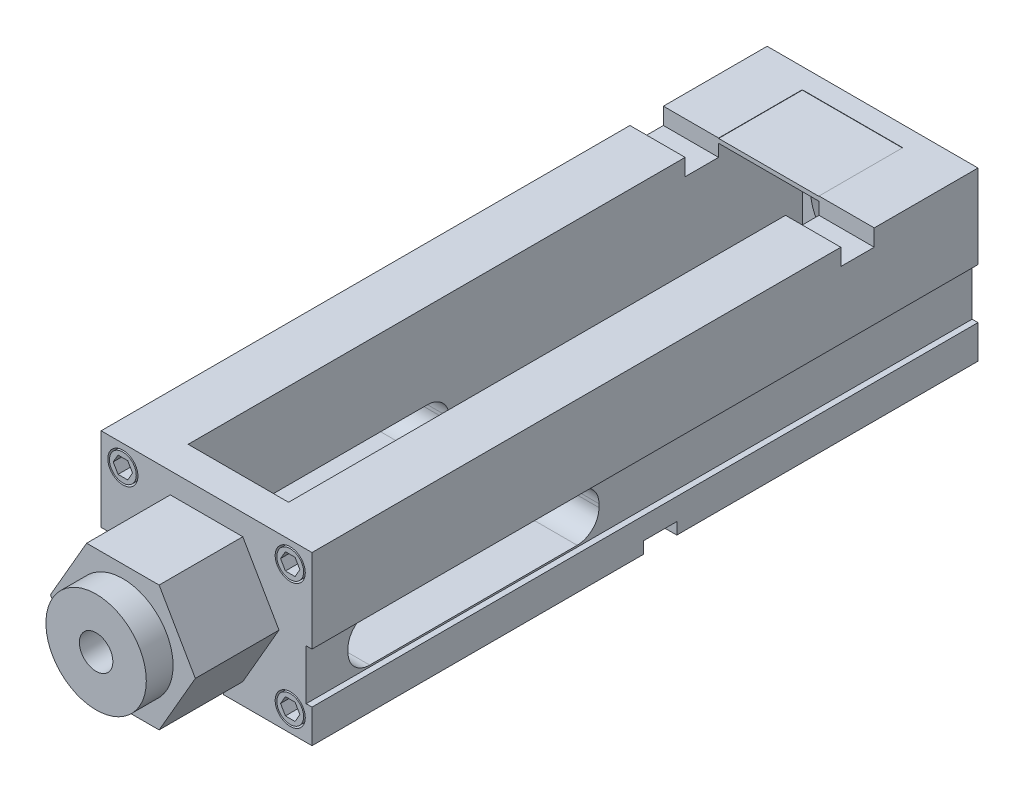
ISO-10303-21;
HEADER;
FILE_DESCRIPTION(('STEP AP214'),'2;1');
FILE_NAME('part.step','',(''),(''),'','','');
FILE_SCHEMA(('AUTOMOTIVE_DESIGN { 1 0 10303 214 1 1 1 1 }'));
ENDSEC;
DATA;
#1=APPLICATION_CONTEXT('core data for automotive mechanical design processes');
#2=APPLICATION_PROTOCOL_DEFINITION('international standard','automotive_design',2000,#1);
#3=PRODUCT_CONTEXT('',#1,'mechanical');
#4=PRODUCT('Part','Part','',(#3));
#5=PRODUCT_RELATED_PRODUCT_CATEGORY('part','',(#4));
#6=PRODUCT_DEFINITION_FORMATION('','',#4);
#7=PRODUCT_DEFINITION_CONTEXT('part definition',#1,'design');
#8=PRODUCT_DEFINITION('design','',#6,#7);
#9=PRODUCT_DEFINITION_SHAPE('','',#8);
#10=(LENGTH_UNIT() NAMED_UNIT(*) SI_UNIT(.MILLI.,.METRE.));
#11=(NAMED_UNIT(*) PLANE_ANGLE_UNIT() SI_UNIT($,.RADIAN.));
#12=(NAMED_UNIT(*) SI_UNIT($,.STERADIAN.) SOLID_ANGLE_UNIT());
#13=UNCERTAINTY_MEASURE_WITH_UNIT(LENGTH_MEASURE(1.E-05),#10,'distance_accuracy_value','');
#14=(GEOMETRIC_REPRESENTATION_CONTEXT(3) GLOBAL_UNCERTAINTY_ASSIGNED_CONTEXT((#13)) GLOBAL_UNIT_ASSIGNED_CONTEXT((#10,
#11,#12)) REPRESENTATION_CONTEXT('',''));
#15=CARTESIAN_POINT('',(0.,0.,0.));
#16=DIRECTION('',(0.,0.,1.));
#17=DIRECTION('',(1.,0.,0.));
#18=AXIS2_PLACEMENT_3D('',#15,#16,#17);
#19=CARTESIAN_POINT('',(35.0484776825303,103.565868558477,-386.));
#20=DIRECTION('',(-1.,0.,0.));
#21=DIRECTION('',(0.,-1.,0.));
#22=AXIS2_PLACEMENT_3D('',#19,#20,#21);
#23=PLANE('',#22);
#24=DIRECTION('',(0.,0.,-1.));
#25=VECTOR('',#24,1.);
#26=CARTESIAN_POINT('',(35.0484776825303,103.365868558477,-275.947939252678));
#27=LINE('',#26,#25);
#28=CARTESIAN_POINT('',(35.0484776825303,103.365868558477,-336.));
#29=VERTEX_POINT('',#28);
#30=CARTESIAN_POINT('',(35.0484776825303,103.365868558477,-386.));
#31=VERTEX_POINT('',#30);
#32=EDGE_CURVE('E1163',#29,#31,#27,.T.);
#33=ORIENTED_EDGE('',*,*,#32,.T.);
#34=DIRECTION('',(0.,-1.,0.));
#35=VECTOR('',#34,1.);
#36=CARTESIAN_POINT('',(35.0484776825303,103.565868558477,-386.));
#37=LINE('',#36,#35);
#38=CARTESIAN_POINT('',(35.0484776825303,103.565868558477,-386.));
#39=VERTEX_POINT('',#38);
#40=EDGE_CURVE('E1711',#39,#31,#37,.T.);
#41=ORIENTED_EDGE('',*,*,#40,.F.);
#42=DIRECTION('',(0.,0.,1.));
#43=VECTOR('',#42,1.);
#44=CARTESIAN_POINT('',(35.0484776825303,103.565868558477,-386.));
#45=LINE('',#44,#43);
#46=CARTESIAN_POINT('',(35.0484776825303,103.565868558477,-336.));
#47=VERTEX_POINT('',#46);
#48=EDGE_CURVE('E758',#39,#47,#45,.T.);
#49=ORIENTED_EDGE('',*,*,#48,.T.);
#50=DIRECTION('',(0.,1.,0.));
#51=VECTOR('',#50,1.);
#52=CARTESIAN_POINT('',(35.0484776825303,103.565868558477,-336.));
#53=LINE('',#52,#51);
#54=EDGE_CURVE('E802',#29,#47,#53,.T.);
#55=ORIENTED_EDGE('',*,*,#54,.F.);
#56=EDGE_LOOP('',(#33,#41,#49,#55));
#57=FACE_BOUND('',#56,.T.);
#58=ADVANCED_FACE('F38',(#57),#23,.F.);
#59=DIRECTION('',(0.,0.,1.));
#60=VECTOR('',#59,1.);
#61=CARTESIAN_POINT('',(35.0484776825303,52.5658685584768,-175.));
#62=LINE('',#61,#60);
#63=CARTESIAN_POINT('',(35.0484776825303,52.5658685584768,-162.));
#64=VERTEX_POINT('',#63);
#65=CARTESIAN_POINT('',(35.0484776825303,52.5658685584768,-38.));
#66=VERTEX_POINT('',#65);
#67=EDGE_CURVE('E824',#64,#66,#62,.T.);
#68=ORIENTED_EDGE('',*,*,#67,.F.);
#69=CARTESIAN_POINT('',(35.0484776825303,39.5658685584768,-162.));
#70=DIRECTION('',(-1.,0.,0.));
#71=DIRECTION('',(0.,-1.,0.));
#72=AXIS2_PLACEMENT_3D('',#69,#70,#71);
#73=CIRCLE('',#72,13.);
#74=CARTESIAN_POINT('',(35.0484776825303,39.5658685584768,-175.));
#75=VERTEX_POINT('',#74);
#76=EDGE_CURVE('E815',#75,#64,#73,.F.);
#77=ORIENTED_EDGE('',*,*,#76,.F.);
#78=DIRECTION('',(0.,1.,0.));
#79=VECTOR('',#78,1.);
#80=CARTESIAN_POINT('',(35.0484776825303,52.5658685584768,-175.));
#81=LINE('',#80,#79);
#82=CARTESIAN_POINT('',(35.0484776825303,37.5658685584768,-175.));
#83=VERTEX_POINT('',#82);
#84=EDGE_CURVE('E812',#83,#75,#81,.T.);
#85=ORIENTED_EDGE('',*,*,#84,.F.);
#86=CARTESIAN_POINT('',(35.0484776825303,37.5658685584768,-162.));
#87=DIRECTION('',(-1.,0.,0.));
#88=DIRECTION('',(0.,-1.,0.));
#89=AXIS2_PLACEMENT_3D('',#86,#87,#88);
#90=CIRCLE('',#89,13.);
#91=CARTESIAN_POINT('',(35.0484776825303,24.5658685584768,-162.));
#92=VERTEX_POINT('',#91);
#93=EDGE_CURVE('E806',#92,#83,#90,.F.);
#94=ORIENTED_EDGE('',*,*,#93,.F.);
#95=DIRECTION('',(0.,0.,-1.));
#96=VECTOR('',#95,1.);
#97=CARTESIAN_POINT('',(35.0484776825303,24.5658685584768,-175.));
#98=LINE('',#97,#96);
#99=CARTESIAN_POINT('',(35.0484776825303,24.5658685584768,-38.));
#100=VERTEX_POINT('',#99);
#101=EDGE_CURVE('E809',#100,#92,#98,.T.);
#102=ORIENTED_EDGE('',*,*,#101,.F.);
#103=CARTESIAN_POINT('',(35.0484776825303,37.5658685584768,-38.));
#104=DIRECTION('',(-1.,0.,0.));
#105=DIRECTION('',(0.,-1.,0.));
#106=AXIS2_PLACEMENT_3D('',#103,#104,#105);
#107=CIRCLE('',#106,13.);
#108=CARTESIAN_POINT('',(35.0484776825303,37.5658685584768,-25.));
#109=VERTEX_POINT('',#108);
#110=EDGE_CURVE('E818',#109,#100,#107,.F.);
#111=ORIENTED_EDGE('',*,*,#110,.F.);
#112=DIRECTION('',(0.,-1.,0.));
#113=VECTOR('',#112,1.);
#114=CARTESIAN_POINT('',(35.0484776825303,52.5658685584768,-25.));
#115=LINE('',#114,#113);
#116=CARTESIAN_POINT('',(35.0484776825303,39.5658685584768,-25.));
#117=VERTEX_POINT('',#116);
#118=EDGE_CURVE('E821',#117,#109,#115,.T.);
#119=ORIENTED_EDGE('',*,*,#118,.F.);
#120=CARTESIAN_POINT('',(35.0484776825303,39.5658685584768,-38.));
#121=DIRECTION('',(-1.,0.,0.));
#122=DIRECTION('',(0.,-1.,0.));
#123=AXIS2_PLACEMENT_3D('',#120,#121,#122);
#124=CIRCLE('',#123,13.);
#125=EDGE_CURVE('E827',#66,#117,#124,.F.);
#126=ORIENTED_EDGE('',*,*,#125,.F.);
#127=EDGE_LOOP('',(#68,#77,#85,#94,#102,#111,#119,#126));
#128=FACE_BOUND('',#127,.T.);
#129=DIRECTION('',(0.,0.,-1.));
#130=VECTOR('',#129,1.);
#131=CARTESIAN_POINT('',(35.0484776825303,100.865868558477,-275.947939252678));
#132=LINE('',#131,#130);
#133=CARTESIAN_POINT('',(35.0484776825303,100.865868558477,-336.));
#134=VERTEX_POINT('',#133);
#135=CARTESIAN_POINT('',(35.0484776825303,100.865868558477,-386.));
#136=VERTEX_POINT('',#135);
#137=EDGE_CURVE('E54',#134,#136,#132,.T.);
#138=ORIENTED_EDGE('',*,*,#137,.F.);
#139=CARTESIAN_POINT('',(35.0484776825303,93.5658685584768,-336.));
#140=VERTEX_POINT('',#139);
#141=EDGE_CURVE('E803',#140,#134,#53,.T.);
#142=ORIENTED_EDGE('',*,*,#141,.F.);
#143=DIRECTION('',(0.,0.,-1.));
#144=VECTOR('',#143,1.);
#145=CARTESIAN_POINT('',(35.0484776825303,93.5658685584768,-336.));
#146=LINE('',#145,#144);
#147=CARTESIAN_POINT('',(35.0484776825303,93.5658685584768,-316.));
#148=VERTEX_POINT('',#147);
#149=EDGE_CURVE('E11',#148,#140,#146,.T.);
#150=ORIENTED_EDGE('',*,*,#149,.F.);
#151=DIRECTION('',(0.,-1.,0.));
#152=VECTOR('',#151,1.);
#153=CARTESIAN_POINT('',(35.0484776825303,103.565868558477,-316.));
#154=LINE('',#153,#152);
#155=CARTESIAN_POINT('',(35.0484776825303,103.565868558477,-316.));
#156=VERTEX_POINT('',#155);
#157=EDGE_CURVE('E799',#156,#148,#154,.T.);
#158=ORIENTED_EDGE('',*,*,#157,.F.);
#159=CARTESIAN_POINT('',(35.0484776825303,103.565868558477,-19.));
#160=VERTEX_POINT('',#159);
#161=EDGE_CURVE('E762',#156,#160,#45,.T.);
#162=ORIENTED_EDGE('',*,*,#161,.T.);
#163=DIRECTION('',(0.,-1.,0.));
#164=VECTOR('',#163,1.);
#165=CARTESIAN_POINT('',(35.0484776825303,103.565868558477,-19.));
#166=LINE('',#165,#164);
#167=CARTESIAN_POINT('',(35.0484776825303,23.5658685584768,-19.));
#168=VERTEX_POINT('',#167);
#169=EDGE_CURVE('E745',#160,#168,#166,.T.);
#170=ORIENTED_EDGE('',*,*,#169,.T.);
#171=DIRECTION('',(0.,0.,1.));
#172=VECTOR('',#171,1.);
#173=CARTESIAN_POINT('',(35.0484776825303,23.5658685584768,-386.));
#174=LINE('',#173,#172);
#175=CARTESIAN_POINT('',(35.0484776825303,23.5658685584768,-386.));
#176=VERTEX_POINT('',#175);
#177=EDGE_CURVE('E740',#176,#168,#174,.T.);
#178=ORIENTED_EDGE('',*,*,#177,.F.);
#179=EDGE_CURVE('E757',#136,#176,#37,.T.);
#180=ORIENTED_EDGE('',*,*,#179,.F.);
#181=EDGE_LOOP('',(#138,#142,#150,#158,#162,#170,#178,#180));
#182=FACE_BOUND('',#181,.T.);
#183=ADVANCED_FACE('F1717',(#128,#182),#23,.F.);
#184=CARTESIAN_POINT('',(95.0484776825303,103.565868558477,-386.));
#185=DIRECTION('',(1.,0.,0.));
#186=DIRECTION('',(0.,0.,-1.));
#187=AXIS2_PLACEMENT_3D('',#184,#185,#186);
#188=PLANE('',#187);
#189=DIRECTION('',(0.,0.,-1.));
#190=VECTOR('',#189,1.);
#191=CARTESIAN_POINT('',(95.0484776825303,103.365868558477,-275.947939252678));
#192=LINE('',#191,#190);
#193=CARTESIAN_POINT('',(95.0484776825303,103.365868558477,-336.));
#194=VERTEX_POINT('',#193);
#195=CARTESIAN_POINT('',(95.0484776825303,103.365868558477,-386.));
#196=VERTEX_POINT('',#195);
#197=EDGE_CURVE('E731',#194,#196,#192,.T.);
#198=ORIENTED_EDGE('',*,*,#197,.F.);
#199=DIRECTION('',(0.,-1.,0.));
#200=VECTOR('',#199,1.);
#201=CARTESIAN_POINT('',(95.0484776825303,103.565868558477,-336.));
#202=LINE('',#201,#200);
#203=CARTESIAN_POINT('',(95.0484776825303,103.565868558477,-336.));
#204=VERTEX_POINT('',#203);
#205=EDGE_CURVE('E772',#204,#194,#202,.T.);
#206=ORIENTED_EDGE('',*,*,#205,.F.);
#207=DIRECTION('',(0.,0.,1.));
#208=VECTOR('',#207,1.);
#209=CARTESIAN_POINT('',(95.0484776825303,103.565868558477,-386.));
#210=LINE('',#209,#208);
#211=CARTESIAN_POINT('',(95.0484776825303,103.565868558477,-386.));
#212=VERTEX_POINT('',#211);
#213=EDGE_CURVE('E763',#212,#204,#210,.T.);
#214=ORIENTED_EDGE('',*,*,#213,.F.);
#215=DIRECTION('',(0.,1.,0.));
#216=VECTOR('',#215,1.);
#217=CARTESIAN_POINT('',(95.0484776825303,103.565868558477,-386.));
#218=LINE('',#217,#216);
#219=EDGE_CURVE('E737',#196,#212,#218,.T.);
#220=ORIENTED_EDGE('',*,*,#219,.F.);
#221=EDGE_LOOP('',(#198,#206,#214,#220));
#222=FACE_BOUND('',#221,.T.);
#223=ADVANCED_FACE('F1806',(#222),#188,.F.);
#224=DIRECTION('',(0.,1.,0.));
#225=VECTOR('',#224,1.);
#226=CARTESIAN_POINT('',(95.0484776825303,52.5658685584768,-25.));
#227=LINE('',#226,#225);
#228=CARTESIAN_POINT('',(95.0484776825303,37.5658685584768,-25.));
#229=VERTEX_POINT('',#228);
#230=CARTESIAN_POINT('',(95.0484776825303,39.5658685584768,-25.));
#231=VERTEX_POINT('',#230);
#232=EDGE_CURVE('E790',#229,#231,#227,.T.);
#233=ORIENTED_EDGE('',*,*,#232,.F.);
#234=CARTESIAN_POINT('',(95.0484776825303,37.5658685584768,-38.));
#235=DIRECTION('',(1.,0.,0.));
#236=DIRECTION('',(0.,0.,-1.));
#237=AXIS2_PLACEMENT_3D('',#234,#235,#236);
#238=CIRCLE('',#237,13.);
#239=CARTESIAN_POINT('',(95.0484776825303,24.5658685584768,-38.));
#240=VERTEX_POINT('',#239);
#241=EDGE_CURVE('E787',#240,#229,#238,.F.);
#242=ORIENTED_EDGE('',*,*,#241,.F.);
#243=DIRECTION('',(0.,0.,1.));
#244=VECTOR('',#243,1.);
#245=CARTESIAN_POINT('',(95.0484776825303,24.5658685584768,-175.));
#246=LINE('',#245,#244);
#247=CARTESIAN_POINT('',(95.0484776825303,24.5658685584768,-162.));
#248=VERTEX_POINT('',#247);
#249=EDGE_CURVE('E778',#248,#240,#246,.T.);
#250=ORIENTED_EDGE('',*,*,#249,.F.);
#251=CARTESIAN_POINT('',(95.0484776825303,37.5658685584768,-162.));
#252=DIRECTION('',(1.,0.,0.));
#253=DIRECTION('',(0.,0.,-1.));
#254=AXIS2_PLACEMENT_3D('',#251,#252,#253);
#255=CIRCLE('',#254,13.);
#256=CARTESIAN_POINT('',(95.0484776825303,37.5658685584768,-175.));
#257=VERTEX_POINT('',#256);
#258=EDGE_CURVE('E775',#257,#248,#255,.F.);
#259=ORIENTED_EDGE('',*,*,#258,.F.);
#260=DIRECTION('',(0.,-1.,0.));
#261=VECTOR('',#260,1.);
#262=CARTESIAN_POINT('',(95.0484776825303,52.5658685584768,-175.));
#263=LINE('',#262,#261);
#264=CARTESIAN_POINT('',(95.0484776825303,39.5658685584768,-175.));
#265=VERTEX_POINT('',#264);
#266=EDGE_CURVE('E781',#265,#257,#263,.T.);
#267=ORIENTED_EDGE('',*,*,#266,.F.);
#268=CARTESIAN_POINT('',(95.0484776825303,39.5658685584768,-162.));
#269=DIRECTION('',(1.,0.,0.));
#270=DIRECTION('',(0.,0.,-1.));
#271=AXIS2_PLACEMENT_3D('',#268,#269,#270);
#272=CIRCLE('',#271,13.);
#273=CARTESIAN_POINT('',(95.0484776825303,52.5658685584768,-162.));
#274=VERTEX_POINT('',#273);
#275=EDGE_CURVE('E784',#274,#265,#272,.F.);
#276=ORIENTED_EDGE('',*,*,#275,.F.);
#277=DIRECTION('',(0.,0.,-1.));
#278=VECTOR('',#277,1.);
#279=CARTESIAN_POINT('',(95.0484776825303,52.5658685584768,-175.));
#280=LINE('',#279,#278);
#281=CARTESIAN_POINT('',(95.0484776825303,52.5658685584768,-38.));
#282=VERTEX_POINT('',#281);
#283=EDGE_CURVE('E793',#282,#274,#280,.T.);
#284=ORIENTED_EDGE('',*,*,#283,.F.);
#285=CARTESIAN_POINT('',(95.0484776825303,39.5658685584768,-38.));
#286=DIRECTION('',(1.,0.,0.));
#287=DIRECTION('',(0.,0.,-1.));
#288=AXIS2_PLACEMENT_3D('',#285,#286,#287);
#289=CIRCLE('',#288,13.);
#290=EDGE_CURVE('E796',#231,#282,#289,.F.);
#291=ORIENTED_EDGE('',*,*,#290,.F.);
#292=EDGE_LOOP('',(#233,#242,#250,#259,#267,#276,#284,#291));
#293=FACE_BOUND('',#292,.T.);
#294=DIRECTION('',(0.,0.,-1.));
#295=VECTOR('',#294,1.);
#296=CARTESIAN_POINT('',(95.0484776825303,100.865868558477,-275.947939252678));
#297=LINE('',#296,#295);
#298=CARTESIAN_POINT('',(95.0484776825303,100.865868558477,-336.));
#299=VERTEX_POINT('',#298);
#300=CARTESIAN_POINT('',(95.0484776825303,100.865868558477,-386.));
#301=VERTEX_POINT('',#300);
#302=EDGE_CURVE('E717',#299,#301,#297,.T.);
#303=ORIENTED_EDGE('',*,*,#302,.T.);
#304=CARTESIAN_POINT('',(95.0484776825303,23.5658685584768,-386.));
#305=VERTEX_POINT('',#304);
#306=EDGE_CURVE('E727',#305,#301,#218,.T.);
#307=ORIENTED_EDGE('',*,*,#306,.F.);
#308=DIRECTION('',(0.,0.,1.));
#309=VECTOR('',#308,1.);
#310=CARTESIAN_POINT('',(95.0484776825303,23.5658685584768,-386.));
#311=LINE('',#310,#309);
#312=CARTESIAN_POINT('',(95.0484776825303,23.5658685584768,-19.));
#313=VERTEX_POINT('',#312);
#314=EDGE_CURVE('E767',#305,#313,#311,.T.);
#315=ORIENTED_EDGE('',*,*,#314,.T.);
#316=DIRECTION('',(0.,1.,0.));
#317=VECTOR('',#316,1.);
#318=CARTESIAN_POINT('',(95.0484776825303,103.565868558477,-19.));
#319=LINE('',#318,#317);
#320=CARTESIAN_POINT('',(95.0484776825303,103.565868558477,-19.));
#321=VERTEX_POINT('',#320);
#322=EDGE_CURVE('E752',#313,#321,#319,.T.);
#323=ORIENTED_EDGE('',*,*,#322,.T.);
#324=CARTESIAN_POINT('',(95.0484776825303,103.565868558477,-316.));
#325=VERTEX_POINT('',#324);
#326=EDGE_CURVE('E766',#325,#321,#210,.T.);
#327=ORIENTED_EDGE('',*,*,#326,.F.);
#328=DIRECTION('',(0.,1.,0.));
#329=VECTOR('',#328,1.);
#330=CARTESIAN_POINT('',(95.0484776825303,103.565868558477,-316.));
#331=LINE('',#330,#329);
#332=CARTESIAN_POINT('',(95.0484776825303,93.5658685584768,-316.));
#333=VERTEX_POINT('',#332);
#334=EDGE_CURVE('E761',#333,#325,#331,.T.);
#335=ORIENTED_EDGE('',*,*,#334,.F.);
#336=DIRECTION('',(0.,0.,1.));
#337=VECTOR('',#336,1.);
#338=CARTESIAN_POINT('',(95.0484776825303,93.5658685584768,-336.));
#339=LINE('',#338,#337);
#340=CARTESIAN_POINT('',(95.0484776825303,93.5658685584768,-336.));
#341=VERTEX_POINT('',#340);
#342=EDGE_CURVE('E47',#341,#333,#339,.T.);
#343=ORIENTED_EDGE('',*,*,#342,.F.);
#344=EDGE_CURVE('E730',#299,#341,#202,.T.);
#345=ORIENTED_EDGE('',*,*,#344,.F.);
#346=EDGE_LOOP('',(#303,#307,#315,#323,#327,#335,#343,#345));
#347=FACE_BOUND('',#346,.T.);
#348=ADVANCED_FACE('F726',(#293,#347),#188,.F.);
#349=CARTESIAN_POINT('',(35.0484776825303,23.5658685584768,-386.));
#350=DIRECTION('',(0.,0.,1.));
#351=DIRECTION('',(1.,0.,0.));
#352=AXIS2_PLACEMENT_3D('',#349,#350,#351);
#353=PLANE('',#352);
#354=ORIENTED_EDGE('',*,*,#40,.T.);
#355=DIRECTION('',(-1.,0.,0.));
#356=VECTOR('',#355,1.);
#357=CARTESIAN_POINT('',(35.0484776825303,103.365868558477,-386.));
#358=LINE('',#357,#356);
#359=EDGE_CURVE('E722',#196,#31,#358,.T.);
#360=ORIENTED_EDGE('',*,*,#359,.F.);
#361=ORIENTED_EDGE('',*,*,#219,.T.);
#362=DIRECTION('',(-1.,0.,0.));
#363=VECTOR('',#362,1.);
#364=CARTESIAN_POINT('',(35.0484776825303,103.565868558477,-386.));
#365=LINE('',#364,#363);
#366=EDGE_CURVE('E736',#212,#39,#365,.T.);
#367=ORIENTED_EDGE('',*,*,#366,.T.);
#368=EDGE_LOOP('',(#354,#360,#361,#367));
#369=FACE_BOUND('',#368,.T.);
#370=ADVANCED_FACE('F3188',(#369),#353,.T.);
#371=CARTESIAN_POINT('',(65.0484776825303,53.5658685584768,-386.));
#372=DIRECTION('',(0.,0.,1.));
#373=DIRECTION('',(1.,0.,0.));
#374=AXIS2_PLACEMENT_3D('',#371,#372,#373);
#375=CIRCLE('',#374,25.);
#376=CARTESIAN_POINT('',(90.0484776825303,53.5658685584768,-386.));
#377=VERTEX_POINT('',#376);
#378=EDGE_CURVE('E1172',#377,#377,#375,.T.);
#379=ORIENTED_EDGE('',*,*,#378,.F.);
#380=EDGE_LOOP('',(#379));
#381=FACE_BOUND('',#380,.T.);
#382=ORIENTED_EDGE('',*,*,#306,.T.);
#383=DIRECTION('',(1.,0.,0.));
#384=VECTOR('',#383,1.);
#385=CARTESIAN_POINT('',(95.0484776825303,100.865868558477,-386.));
#386=LINE('',#385,#384);
#387=EDGE_CURVE('E714',#136,#301,#386,.T.);
#388=ORIENTED_EDGE('',*,*,#387,.F.);
#389=ORIENTED_EDGE('',*,*,#179,.T.);
#390=DIRECTION('',(1.,0.,0.));
#391=VECTOR('',#390,1.);
#392=CARTESIAN_POINT('',(35.0484776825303,23.5658685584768,-386.));
#393=LINE('',#392,#391);
#394=EDGE_CURVE('E735',#176,#305,#393,.T.);
#395=ORIENTED_EDGE('',*,*,#394,.T.);
#396=EDGE_LOOP('',(#382,#388,#389,#395));
#397=FACE_BOUND('',#396,.T.);
#398=ADVANCED_FACE('F733',(#381,#397),#353,.T.);
#399=CARTESIAN_POINT('',(21.7472074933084,53.5658685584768,50.));
#400=DIRECTION('',(0.,0.,1.));
#401=DIRECTION('',(1.,0.,0.));
#402=AXIS2_PLACEMENT_3D('',#399,#400,#401);
#403=PLANE('',#402);
#404=DIRECTION('',(-0.5,-0.866025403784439,0.));
#405=VECTOR('',#404,1.);
#406=CARTESIAN_POINT('',(43.3978425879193,91.0658685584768,50.));
#407=LINE('',#406,#405);
#408=CARTESIAN_POINT('',(43.3978425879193,91.0658685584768,50.));
#409=VERTEX_POINT('',#408);
#410=CARTESIAN_POINT('',(21.7472074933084,53.5658685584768,50.));
#411=VERTEX_POINT('',#410);
#412=EDGE_CURVE('E1665',#409,#411,#407,.T.);
#413=ORIENTED_EDGE('',*,*,#412,.T.);
#414=DIRECTION('',(0.5,-0.866025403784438,0.));
#415=VECTOR('',#414,1.);
#416=CARTESIAN_POINT('',(21.7472074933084,53.5658685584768,50.));
#417=LINE('',#416,#415);
#418=CARTESIAN_POINT('',(43.3978425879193,16.0658685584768,50.));
#419=VERTEX_POINT('',#418);
#420=EDGE_CURVE('E1668',#411,#419,#417,.T.);
#421=ORIENTED_EDGE('',*,*,#420,.T.);
#422=DIRECTION('',(1.,0.,0.));
#423=VECTOR('',#422,1.);
#424=CARTESIAN_POINT('',(43.3978425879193,16.0658685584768,50.));
#425=LINE('',#424,#423);
#426=CARTESIAN_POINT('',(86.6991127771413,16.0658685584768,50.));
#427=VERTEX_POINT('',#426);
#428=EDGE_CURVE('E1671',#419,#427,#425,.T.);
#429=ORIENTED_EDGE('',*,*,#428,.T.);
#430=DIRECTION('',(0.5,0.866025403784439,0.));
#431=VECTOR('',#430,1.);
#432=CARTESIAN_POINT('',(86.6991127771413,16.0658685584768,50.));
#433=LINE('',#432,#431);
#434=CARTESIAN_POINT('',(108.349747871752,53.5658685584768,50.));
#435=VERTEX_POINT('',#434);
#436=EDGE_CURVE('E1673',#427,#435,#433,.T.);
#437=ORIENTED_EDGE('',*,*,#436,.T.);
#438=DIRECTION('',(-0.5,0.866025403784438,0.));
#439=VECTOR('',#438,1.);
#440=CARTESIAN_POINT('',(108.349747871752,53.5658685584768,50.));
#441=LINE('',#440,#439);
#442=CARTESIAN_POINT('',(86.6991127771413,91.0658685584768,50.));
#443=VERTEX_POINT('',#442);
#444=EDGE_CURVE('E1675',#435,#443,#441,.T.);
#445=ORIENTED_EDGE('',*,*,#444,.T.);
#446=DIRECTION('',(-1.,0.,0.));
#447=VECTOR('',#446,1.);
#448=CARTESIAN_POINT('',(86.6991127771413,91.0658685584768,50.));
#449=LINE('',#448,#447);
#450=EDGE_CURVE('E1677',#443,#409,#449,.T.);
#451=ORIENTED_EDGE('',*,*,#450,.T.);
#452=EDGE_LOOP('',(#413,#421,#429,#437,#445,#451));
#453=FACE_BOUND('',#452,.T.);
#454=CARTESIAN_POINT('',(65.0484776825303,53.5658685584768,50.));
#455=DIRECTION('',(0.,0.,1.));
#456=DIRECTION('',(1.,0.,0.));
#457=AXIS2_PLACEMENT_3D('',#454,#455,#456);
#458=CIRCLE('',#457,30.);
#459=CARTESIAN_POINT('',(95.0484776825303,53.5658685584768,50.));
#460=VERTEX_POINT('',#459);
#461=EDGE_CURVE('E1656',#460,#460,#458,.T.);
#462=ORIENTED_EDGE('',*,*,#461,.F.);
#463=EDGE_LOOP('',(#462));
#464=FACE_BOUND('',#463,.T.);
#465=ADVANCED_FACE('F1887',(#453,#464),#403,.T.);
#466=CARTESIAN_POINT('',(2.0484776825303,103.565868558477,0.));
#467=DIRECTION('',(0.,0.,-1.));
#468=DIRECTION('',(-1.,0.,0.));
#469=AXIS2_PLACEMENT_3D('',#466,#467,#468);
#470=PLANE('',#469);
#471=CARTESIAN_POINT('',(15.0484776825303,16.0658685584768,0.));
#472=DIRECTION('',(0.,0.,1.));
#473=DIRECTION('',(1.,0.,0.));
#474=AXIS2_PLACEMENT_3D('',#471,#472,#473);
#475=CIRCLE('',#474,9.00000000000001);
#476=CARTESIAN_POINT('',(24.0484776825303,16.0658685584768,0.));
#477=VERTEX_POINT('',#476);
#478=EDGE_CURVE('E1374',#477,#477,#475,.T.);
#479=ORIENTED_EDGE('',*,*,#478,.F.);
#480=EDGE_LOOP('',(#479));
#481=FACE_BOUND('',#480,.T.);
#482=CARTESIAN_POINT('',(15.0484776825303,91.0658685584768,0.));
#483=DIRECTION('',(0.,0.,1.));
#484=DIRECTION('',(1.,0.,0.));
#485=AXIS2_PLACEMENT_3D('',#482,#483,#484);
#486=CIRCLE('',#485,9.00000000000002);
#487=CARTESIAN_POINT('',(24.0484776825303,91.0658685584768,0.));
#488=VERTEX_POINT('',#487);
#489=EDGE_CURVE('E1386',#488,#488,#486,.T.);
#490=ORIENTED_EDGE('',*,*,#489,.F.);
#491=EDGE_LOOP('',(#490));
#492=FACE_BOUND('',#491,.T.);
#493=CARTESIAN_POINT('',(115.04847768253,91.0658685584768,0.));
#494=DIRECTION('',(0.,0.,1.));
#495=DIRECTION('',(1.,0.,0.));
#496=AXIS2_PLACEMENT_3D('',#493,#494,#495);
#497=CIRCLE('',#496,9.00000000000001);
#498=CARTESIAN_POINT('',(124.04847768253,91.0658685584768,0.));
#499=VERTEX_POINT('',#498);
#500=EDGE_CURVE('E1398',#499,#499,#497,.T.);
#501=ORIENTED_EDGE('',*,*,#500,.F.);
#502=EDGE_LOOP('',(#501));
#503=FACE_BOUND('',#502,.T.);
#504=CARTESIAN_POINT('',(115.04847768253,16.0658685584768,0.));
#505=DIRECTION('',(0.,0.,1.));
#506=DIRECTION('',(1.,0.,0.));
#507=AXIS2_PLACEMENT_3D('',#504,#505,#506);
#508=CIRCLE('',#507,9.00000000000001);
#509=CARTESIAN_POINT('',(124.04847768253,16.0658685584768,0.));
#510=VERTEX_POINT('',#509);
#511=EDGE_CURVE('E1410',#510,#510,#508,.T.);
#512=ORIENTED_EDGE('',*,*,#511,.F.);
#513=EDGE_LOOP('',(#512));
#514=FACE_BOUND('',#513,.T.);
#515=DIRECTION('',(0.,1.,0.));
#516=VECTOR('',#515,1.);
#517=CARTESIAN_POINT('',(128.04847768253,3.56586855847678,0.));
#518=LINE('',#517,#516);
#519=CARTESIAN_POINT('',(128.04847768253,3.56586855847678,0.));
#520=VERTEX_POINT('',#519);
#521=CARTESIAN_POINT('',(128.04847768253,23.5658685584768,0.));
#522=VERTEX_POINT('',#521);
#523=EDGE_CURVE('E1007',#520,#522,#518,.T.);
#524=ORIENTED_EDGE('',*,*,#523,.T.);
#525=DIRECTION('',(1.,0.,0.));
#526=VECTOR('',#525,1.);
#527=CARTESIAN_POINT('',(128.04847768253,23.5658685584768,0.));
#528=LINE('',#527,#526);
#529=CARTESIAN_POINT('',(124.54847768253,23.5658685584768,0.));
#530=VERTEX_POINT('',#529);
#531=EDGE_CURVE('E922',#530,#522,#528,.T.);
#532=ORIENTED_EDGE('',*,*,#531,.F.);
#533=DIRECTION('',(0.,-1.,0.));
#534=VECTOR('',#533,1.);
#535=CARTESIAN_POINT('',(124.54847768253,23.5658685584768,0.));
#536=LINE('',#535,#534);
#537=CARTESIAN_POINT('',(124.54847768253,53.5658685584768,0.));
#538=VERTEX_POINT('',#537);
#539=EDGE_CURVE('E919',#538,#530,#536,.T.);
#540=ORIENTED_EDGE('',*,*,#539,.F.);
#541=DIRECTION('',(-1.,0.,0.));
#542=VECTOR('',#541,1.);
#543=CARTESIAN_POINT('',(128.04847768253,53.5658685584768,0.));
#544=LINE('',#543,#542);
#545=CARTESIAN_POINT('',(128.04847768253,53.5658685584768,0.));
#546=VERTEX_POINT('',#545);
#547=EDGE_CURVE('E916',#546,#538,#544,.T.);
#548=ORIENTED_EDGE('',*,*,#547,.F.);
#549=CARTESIAN_POINT('',(128.04847768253,103.565868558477,0.));
#550=VERTEX_POINT('',#549);
#551=EDGE_CURVE('E1006',#546,#550,#518,.T.);
#552=ORIENTED_EDGE('',*,*,#551,.T.);
#553=DIRECTION('',(-1.,0.,0.));
#554=VECTOR('',#553,1.);
#555=CARTESIAN_POINT('',(2.0484776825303,103.565868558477,0.));
#556=LINE('',#555,#554);
#557=CARTESIAN_POINT('',(2.0484776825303,103.565868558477,0.));
#558=VERTEX_POINT('',#557);
#559=EDGE_CURVE('E1010',#550,#558,#556,.T.);
#560=ORIENTED_EDGE('',*,*,#559,.T.);
#561=DIRECTION('',(0.,-1.,0.));
#562=VECTOR('',#561,1.);
#563=CARTESIAN_POINT('',(2.0484776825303,3.56586855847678,0.));
#564=LINE('',#563,#562);
#565=CARTESIAN_POINT('',(2.0484776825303,53.5658685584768,0.));
#566=VERTEX_POINT('',#565);
#567=EDGE_CURVE('E999',#558,#566,#564,.T.);
#568=ORIENTED_EDGE('',*,*,#567,.T.);
#569=DIRECTION('',(-1.,0.,0.));
#570=VECTOR('',#569,1.);
#571=CARTESIAN_POINT('',(2.0484776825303,53.5658685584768,0.));
#572=LINE('',#571,#570);
#573=CARTESIAN_POINT('',(5.5484776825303,53.5658685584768,0.));
#574=VERTEX_POINT('',#573);
#575=EDGE_CURVE('E948',#574,#566,#572,.T.);
#576=ORIENTED_EDGE('',*,*,#575,.F.);
#577=DIRECTION('',(0.,1.,0.));
#578=VECTOR('',#577,1.);
#579=CARTESIAN_POINT('',(5.5484776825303,53.5658685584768,0.));
#580=LINE('',#579,#578);
#581=CARTESIAN_POINT('',(5.54847768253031,23.5658685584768,0.));
#582=VERTEX_POINT('',#581);
#583=EDGE_CURVE('E945',#582,#574,#580,.T.);
#584=ORIENTED_EDGE('',*,*,#583,.F.);
#585=DIRECTION('',(1.,0.,0.));
#586=VECTOR('',#585,1.);
#587=CARTESIAN_POINT('',(2.04847768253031,23.5658685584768,0.));
#588=LINE('',#587,#586);
#589=CARTESIAN_POINT('',(2.0484776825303,23.5658685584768,0.));
#590=VERTEX_POINT('',#589);
#591=EDGE_CURVE('E937',#590,#582,#588,.T.);
#592=ORIENTED_EDGE('',*,*,#591,.F.);
#593=CARTESIAN_POINT('',(2.0484776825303,3.56586855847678,0.));
#594=VERTEX_POINT('',#593);
#595=EDGE_CURVE('E990',#590,#594,#564,.T.);
#596=ORIENTED_EDGE('',*,*,#595,.T.);
#597=DIRECTION('',(1.,0.,0.));
#598=VECTOR('',#597,1.);
#599=CARTESIAN_POINT('',(2.0484776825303,3.56586855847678,0.));
#600=LINE('',#599,#598);
#601=CARTESIAN_POINT('',(55.0484776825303,3.56586855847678,0.));
#602=VERTEX_POINT('',#601);
#603=EDGE_CURVE('E1003',#594,#602,#600,.T.);
#604=ORIENTED_EDGE('',*,*,#603,.T.);
#605=DIRECTION('',(0.,-1.,0.));
#606=VECTOR('',#605,1.);
#607=CARTESIAN_POINT('',(55.0484776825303,3.56586855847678,0.));
#608=LINE('',#607,#606);
#609=CARTESIAN_POINT('',(55.0484776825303,11.0658685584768,0.));
#610=VERTEX_POINT('',#609);
#611=EDGE_CURVE('E974',#610,#602,#608,.T.);
#612=ORIENTED_EDGE('',*,*,#611,.F.);
#613=DIRECTION('',(-1.,0.,0.));
#614=VECTOR('',#613,1.);
#615=CARTESIAN_POINT('',(55.0484776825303,11.0658685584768,0.));
#616=LINE('',#615,#614);
#617=CARTESIAN_POINT('',(75.0484776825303,11.0658685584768,0.));
#618=VERTEX_POINT('',#617);
#619=EDGE_CURVE('E971',#618,#610,#616,.T.);
#620=ORIENTED_EDGE('',*,*,#619,.F.);
#621=DIRECTION('',(0.,1.,0.));
#622=VECTOR('',#621,1.);
#623=CARTESIAN_POINT('',(75.0484776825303,11.0658685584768,0.));
#624=LINE('',#623,#622);
#625=CARTESIAN_POINT('',(75.0484776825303,3.56586855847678,0.));
#626=VERTEX_POINT('',#625);
#627=EDGE_CURVE('E963',#626,#618,#624,.T.);
#628=ORIENTED_EDGE('',*,*,#627,.F.);
#629=EDGE_CURVE('E1002',#626,#520,#600,.T.);
#630=ORIENTED_EDGE('',*,*,#629,.T.);
#631=EDGE_LOOP('',(#524,#532,#540,#548,#552,#560,#568,#576,#584,#592,#596,#604,#612,#620,#628,#630));
#632=FACE_BOUND('',#631,.T.);
#633=DIRECTION('',(-0.5,-0.866025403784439,0.));
#634=VECTOR('',#633,1.);
#635=CARTESIAN_POINT('',(43.3978425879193,91.0658685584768,0.));
#636=LINE('',#635,#634);
#637=CARTESIAN_POINT('',(43.3978425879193,91.0658685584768,0.));
#638=VERTEX_POINT('',#637);
#639=CARTESIAN_POINT('',(21.7472074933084,53.5658685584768,0.));
#640=VERTEX_POINT('',#639);
#641=EDGE_CURVE('E1662',#638,#640,#636,.T.);
#642=ORIENTED_EDGE('',*,*,#641,.F.);
#643=DIRECTION('',(-1.,0.,0.));
#644=VECTOR('',#643,1.);
#645=CARTESIAN_POINT('',(86.6991127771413,91.0658685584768,0.));
#646=LINE('',#645,#644);
#647=CARTESIAN_POINT('',(86.6991127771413,91.0658685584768,0.));
#648=VERTEX_POINT('',#647);
#649=EDGE_CURVE('E1669',#648,#638,#646,.T.);
#650=ORIENTED_EDGE('',*,*,#649,.F.);
#651=DIRECTION('',(-0.5,0.866025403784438,0.));
#652=VECTOR('',#651,1.);
#653=CARTESIAN_POINT('',(108.349747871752,53.5658685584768,0.));
#654=LINE('',#653,#652);
#655=CARTESIAN_POINT('',(108.349747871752,53.5658685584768,0.));
#656=VERTEX_POINT('',#655);
#657=EDGE_CURVE('E1691',#656,#648,#654,.T.);
#658=ORIENTED_EDGE('',*,*,#657,.F.);
#659=DIRECTION('',(0.5,0.866025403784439,0.));
#660=VECTOR('',#659,1.);
#661=CARTESIAN_POINT('',(86.6991127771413,16.0658685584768,0.));
#662=LINE('',#661,#660);
#663=CARTESIAN_POINT('',(86.6991127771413,16.0658685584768,0.));
#664=VERTEX_POINT('',#663);
#665=EDGE_CURVE('E1688',#664,#656,#662,.T.);
#666=ORIENTED_EDGE('',*,*,#665,.F.);
#667=DIRECTION('',(1.,0.,0.));
#668=VECTOR('',#667,1.);
#669=CARTESIAN_POINT('',(43.3978425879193,16.0658685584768,0.));
#670=LINE('',#669,#668);
#671=CARTESIAN_POINT('',(43.3978425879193,16.0658685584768,0.));
#672=VERTEX_POINT('',#671);
#673=EDGE_CURVE('E1685',#672,#664,#670,.T.);
#674=ORIENTED_EDGE('',*,*,#673,.F.);
#675=DIRECTION('',(0.5,-0.866025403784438,0.));
#676=VECTOR('',#675,1.);
#677=CARTESIAN_POINT('',(21.7472074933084,53.5658685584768,0.));
#678=LINE('',#677,#676);
#679=EDGE_CURVE('E1682',#640,#672,#678,.T.);
#680=ORIENTED_EDGE('',*,*,#679,.F.);
#681=EDGE_LOOP('',(#642,#650,#658,#666,#674,#680));
#682=FACE_BOUND('',#681,.T.);
#683=ADVANCED_FACE('F1133',(#481,#492,#503,#514,#632,#682),#470,.F.);
#684=CARTESIAN_POINT('',(128.04847768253,52.5658685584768,-175.));
#685=DIRECTION('',(0.,0.,-1.));
#686=DIRECTION('',(-1.,0.,0.));
#687=AXIS2_PLACEMENT_3D('',#684,#685,#686);
#688=PLANE('',#687);
#689=DIRECTION('',(-1.,0.,0.));
#690=VECTOR('',#689,1.);
#691=CARTESIAN_POINT('',(124.54847768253,37.5658685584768,-175.));
#692=LINE('',#691,#690);
#693=CARTESIAN_POINT('',(5.5484776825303,37.5658685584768,-175.));
#694=VERTEX_POINT('',#693);
#695=EDGE_CURVE('E1081',#694,#83,#692,.F.);
#696=ORIENTED_EDGE('',*,*,#695,.T.);
#697=ORIENTED_EDGE('',*,*,#84,.T.);
#698=DIRECTION('',(-1.,0.,0.));
#699=VECTOR('',#698,1.);
#700=CARTESIAN_POINT('',(5.5484776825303,39.5658685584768,-175.));
#701=LINE('',#700,#699);
#702=CARTESIAN_POINT('',(5.5484776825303,39.5658685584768,-175.));
#703=VERTEX_POINT('',#702);
#704=EDGE_CURVE('E1084',#75,#703,#701,.T.);
#705=ORIENTED_EDGE('',*,*,#704,.T.);
#706=DIRECTION('',(0.,-1.,0.));
#707=VECTOR('',#706,1.);
#708=CARTESIAN_POINT('',(5.5484776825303,52.5658685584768,-175.));
#709=LINE('',#708,#707);
#710=EDGE_CURVE('E904',#703,#694,#709,.T.);
#711=ORIENTED_EDGE('',*,*,#710,.T.);
#712=EDGE_LOOP('',(#696,#697,#705,#711));
#713=FACE_BOUND('',#712,.T.);
#714=ADVANCED_FACE('F1796',(#713),#688,.F.);
#715=CARTESIAN_POINT('',(128.04847768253,52.5658685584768,-175.));
#716=DIRECTION('',(0.,1.,0.));
#717=DIRECTION('',(-1.,0.,0.));
#718=AXIS2_PLACEMENT_3D('',#715,#716,#717);
#719=PLANE('',#718);
#720=DIRECTION('',(-1.,0.,0.));
#721=VECTOR('',#720,1.);
#722=CARTESIAN_POINT('',(124.54847768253,52.5658685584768,-162.));
#723=LINE('',#722,#721);
#724=CARTESIAN_POINT('',(5.5484776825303,52.5658685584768,-162.));
#725=VERTEX_POINT('',#724);
#726=EDGE_CURVE('E1073',#725,#64,#723,.F.);
#727=ORIENTED_EDGE('',*,*,#726,.T.);
#728=ORIENTED_EDGE('',*,*,#67,.T.);
#729=DIRECTION('',(-1.,0.,0.));
#730=VECTOR('',#729,1.);
#731=CARTESIAN_POINT('',(5.5484776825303,52.5658685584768,-38.));
#732=LINE('',#731,#730);
#733=CARTESIAN_POINT('',(5.5484776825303,52.5658685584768,-38.));
#734=VERTEX_POINT('',#733);
#735=EDGE_CURVE('E1076',#66,#734,#732,.T.);
#736=ORIENTED_EDGE('',*,*,#735,.T.);
#737=DIRECTION('',(0.,0.,-1.));
#738=VECTOR('',#737,1.);
#739=CARTESIAN_POINT('',(5.5484776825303,52.5658685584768,-175.));
#740=LINE('',#739,#738);
#741=EDGE_CURVE('E913',#734,#725,#740,.T.);
#742=ORIENTED_EDGE('',*,*,#741,.T.);
#743=EDGE_LOOP('',(#727,#728,#736,#742));
#744=FACE_BOUND('',#743,.T.);
#745=ADVANCED_FACE('F1858',(#744),#719,.F.);
#746=CARTESIAN_POINT('',(128.04847768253,52.5658685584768,-25.));
#747=DIRECTION('',(0.,0.,1.));
#748=DIRECTION('',(1.,0.,0.));
#749=AXIS2_PLACEMENT_3D('',#746,#747,#748);
#750=PLANE('',#749);
#751=DIRECTION('',(-1.,0.,0.));
#752=VECTOR('',#751,1.);
#753=CARTESIAN_POINT('',(124.54847768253,39.5658685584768,-25.));
#754=LINE('',#753,#752);
#755=CARTESIAN_POINT('',(5.5484776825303,39.5658685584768,-25.));
#756=VERTEX_POINT('',#755);
#757=EDGE_CURVE('E1057',#756,#117,#754,.F.);
#758=ORIENTED_EDGE('',*,*,#757,.T.);
#759=ORIENTED_EDGE('',*,*,#118,.T.);
#760=DIRECTION('',(-1.,0.,0.));
#761=VECTOR('',#760,1.);
#762=CARTESIAN_POINT('',(5.5484776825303,37.5658685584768,-25.));
#763=LINE('',#762,#761);
#764=CARTESIAN_POINT('',(5.5484776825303,37.5658685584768,-25.));
#765=VERTEX_POINT('',#764);
#766=EDGE_CURVE('E1060',#109,#765,#763,.T.);
#767=ORIENTED_EDGE('',*,*,#766,.T.);
#768=DIRECTION('',(0.,1.,0.));
#769=VECTOR('',#768,1.);
#770=CARTESIAN_POINT('',(5.5484776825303,52.5658685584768,-25.));
#771=LINE('',#770,#769);
#772=EDGE_CURVE('E910',#765,#756,#771,.T.);
#773=ORIENTED_EDGE('',*,*,#772,.T.);
#774=EDGE_LOOP('',(#758,#759,#767,#773));
#775=FACE_BOUND('',#774,.T.);
#776=ADVANCED_FACE('F1862',(#775),#750,.F.);
#777=CARTESIAN_POINT('',(128.04847768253,24.5658685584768,-175.));
#778=DIRECTION('',(0.,-1.,0.));
#779=DIRECTION('',(1.,0.,0.));
#780=AXIS2_PLACEMENT_3D('',#777,#778,#779);
#781=PLANE('',#780);
#782=DIRECTION('',(-1.,0.,0.));
#783=VECTOR('',#782,1.);
#784=CARTESIAN_POINT('',(124.54847768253,24.5658685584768,-38.));
#785=LINE('',#784,#783);
#786=CARTESIAN_POINT('',(5.54847768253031,24.5658685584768,-38.));
#787=VERTEX_POINT('',#786);
#788=EDGE_CURVE('E1069',#787,#100,#785,.F.);
#789=ORIENTED_EDGE('',*,*,#788,.T.);
#790=ORIENTED_EDGE('',*,*,#101,.T.);
#791=DIRECTION('',(-1.,0.,0.));
#792=VECTOR('',#791,1.);
#793=CARTESIAN_POINT('',(5.54847768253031,24.5658685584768,-162.));
#794=LINE('',#793,#792);
#795=CARTESIAN_POINT('',(5.54847768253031,24.5658685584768,-162.));
#796=VERTEX_POINT('',#795);
#797=EDGE_CURVE('E1064',#92,#796,#794,.T.);
#798=ORIENTED_EDGE('',*,*,#797,.T.);
#799=DIRECTION('',(0.,0.,1.));
#800=VECTOR('',#799,1.);
#801=CARTESIAN_POINT('',(5.54847768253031,24.5658685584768,-175.));
#802=LINE('',#801,#800);
#803=EDGE_CURVE('E907',#796,#787,#802,.T.);
#804=ORIENTED_EDGE('',*,*,#803,.T.);
#805=EDGE_LOOP('',(#789,#790,#798,#804));
#806=FACE_BOUND('',#805,.T.);
#807=ADVANCED_FACE('F1865',(#806),#781,.F.);
#808=CARTESIAN_POINT('',(128.04847768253,37.5658685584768,-38.));
#809=DIRECTION('',(1.,0.,0.));
#810=DIRECTION('',(0.,1.,0.));
#811=AXIS2_PLACEMENT_3D('',#808,#809,#810);
#812=CYLINDRICAL_SURFACE('',#811,13.);
#813=ORIENTED_EDGE('',*,*,#766,.F.);
#814=ORIENTED_EDGE('',*,*,#110,.T.);
#815=ORIENTED_EDGE('',*,*,#788,.F.);
#816=CARTESIAN_POINT('',(5.5484776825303,37.5658685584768,-38.));
#817=DIRECTION('',(1.,0.,0.));
#818=DIRECTION('',(0.,1.,0.));
#819=AXIS2_PLACEMENT_3D('',#816,#817,#818);
#820=CIRCLE('',#819,13.);
#821=EDGE_CURVE('E1088',#765,#787,#820,.T.);
#822=ORIENTED_EDGE('',*,*,#821,.F.);
#823=EDGE_LOOP('',(#813,#814,#815,#822));
#824=FACE_BOUND('',#823,.T.);
#825=ADVANCED_FACE('F1853',(#824),#812,.F.);
#826=CARTESIAN_POINT('',(128.04847768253,39.5658685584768,-38.));
#827=DIRECTION('',(1.,0.,0.));
#828=DIRECTION('',(0.,1.,0.));
#829=AXIS2_PLACEMENT_3D('',#826,#827,#828);
#830=CYLINDRICAL_SURFACE('',#829,13.);
#831=ORIENTED_EDGE('',*,*,#735,.F.);
#832=ORIENTED_EDGE('',*,*,#125,.T.);
#833=ORIENTED_EDGE('',*,*,#757,.F.);
#834=CARTESIAN_POINT('',(5.5484776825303,39.5658685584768,-38.));
#835=DIRECTION('',(1.,0.,0.));
#836=DIRECTION('',(0.,1.,0.));
#837=AXIS2_PLACEMENT_3D('',#834,#835,#836);
#838=CIRCLE('',#837,13.);
#839=EDGE_CURVE('E1092',#734,#756,#838,.T.);
#840=ORIENTED_EDGE('',*,*,#839,.F.);
#841=EDGE_LOOP('',(#831,#832,#833,#840));
#842=FACE_BOUND('',#841,.T.);
#843=ADVANCED_FACE('F1848',(#842),#830,.F.);
#844=CARTESIAN_POINT('',(128.04847768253,39.5658685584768,-162.));
#845=DIRECTION('',(1.,0.,0.));
#846=DIRECTION('',(0.,1.,0.));
#847=AXIS2_PLACEMENT_3D('',#844,#845,#846);
#848=CYLINDRICAL_SURFACE('',#847,13.);
#849=ORIENTED_EDGE('',*,*,#704,.F.);
#850=ORIENTED_EDGE('',*,*,#76,.T.);
#851=ORIENTED_EDGE('',*,*,#726,.F.);
#852=CARTESIAN_POINT('',(5.5484776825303,39.5658685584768,-162.));
#853=DIRECTION('',(1.,0.,0.));
#854=DIRECTION('',(0.,1.,0.));
#855=AXIS2_PLACEMENT_3D('',#852,#853,#854);
#856=CIRCLE('',#855,13.);
#857=EDGE_CURVE('E1096',#703,#725,#856,.T.);
#858=ORIENTED_EDGE('',*,*,#857,.F.);
#859=EDGE_LOOP('',(#849,#850,#851,#858));
#860=FACE_BOUND('',#859,.T.);
#861=ADVANCED_FACE('F1843',(#860),#848,.F.);
#862=CARTESIAN_POINT('',(128.04847768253,37.5658685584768,-162.));
#863=DIRECTION('',(1.,0.,0.));
#864=DIRECTION('',(0.,1.,0.));
#865=AXIS2_PLACEMENT_3D('',#862,#863,#864);
#866=CYLINDRICAL_SURFACE('',#865,13.);
#867=ORIENTED_EDGE('',*,*,#797,.F.);
#868=ORIENTED_EDGE('',*,*,#93,.T.);
#869=ORIENTED_EDGE('',*,*,#695,.F.);
#870=CARTESIAN_POINT('',(5.5484776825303,37.5658685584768,-162.));
#871=DIRECTION('',(1.,0.,0.));
#872=DIRECTION('',(0.,1.,0.));
#873=AXIS2_PLACEMENT_3D('',#870,#871,#872);
#874=CIRCLE('',#873,13.);
#875=EDGE_CURVE('E1100',#796,#694,#874,.T.);
#876=ORIENTED_EDGE('',*,*,#875,.F.);
#877=EDGE_LOOP('',(#867,#868,#869,#876));
#878=FACE_BOUND('',#877,.T.);
#879=ADVANCED_FACE('F1838',(#878),#866,.F.);
#880=CARTESIAN_POINT('',(128.04847768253,103.565868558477,-316.));
#881=DIRECTION('',(0.,0.,1.));
#882=DIRECTION('',(1.,0.,0.));
#883=AXIS2_PLACEMENT_3D('',#880,#881,#882);
#884=PLANE('',#883);
#885=DIRECTION('',(-1.,0.,0.));
#886=VECTOR('',#885,1.);
#887=CARTESIAN_POINT('',(128.04847768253,103.565868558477,-316.));
#888=LINE('',#887,#886);
#889=CARTESIAN_POINT('',(2.0484776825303,103.565868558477,-316.));
#890=VERTEX_POINT('',#889);
#891=EDGE_CURVE('E857',#156,#890,#888,.T.);
#892=ORIENTED_EDGE('',*,*,#891,.F.);
#893=ORIENTED_EDGE('',*,*,#157,.T.);
#894=DIRECTION('',(-1.,0.,0.));
#895=VECTOR('',#894,1.);
#896=CARTESIAN_POINT('',(128.04847768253,93.5658685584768,-316.));
#897=LINE('',#896,#895);
#898=CARTESIAN_POINT('',(2.0484776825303,93.5658685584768,-316.));
#899=VERTEX_POINT('',#898);
#900=EDGE_CURVE('E861',#148,#899,#897,.T.);
#901=ORIENTED_EDGE('',*,*,#900,.T.);
#902=DIRECTION('',(0.,1.,0.));
#903=VECTOR('',#902,1.);
#904=CARTESIAN_POINT('',(2.0484776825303,103.565868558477,-316.));
#905=LINE('',#904,#903);
#906=EDGE_CURVE('E835',#899,#890,#905,.T.);
#907=ORIENTED_EDGE('',*,*,#906,.T.);
#908=EDGE_LOOP('',(#892,#893,#901,#907));
#909=FACE_BOUND('',#908,.T.);
#910=ADVANCED_FACE('F1728',(#909),#884,.F.);
#911=CARTESIAN_POINT('',(128.04847768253,93.5658685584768,-336.));
#912=DIRECTION('',(0.,-1.,0.));
#913=DIRECTION('',(0.,0.,-1.));
#914=AXIS2_PLACEMENT_3D('',#911,#912,#913);
#915=PLANE('',#914);
#916=ORIENTED_EDGE('',*,*,#900,.F.);
#917=ORIENTED_EDGE('',*,*,#149,.T.);
#918=DIRECTION('',(-1.,0.,0.));
#919=VECTOR('',#918,1.);
#920=CARTESIAN_POINT('',(128.04847768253,93.5658685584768,-336.));
#921=LINE('',#920,#919);
#922=CARTESIAN_POINT('',(2.0484776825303,93.5658685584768,-336.));
#923=VERTEX_POINT('',#922);
#924=EDGE_CURVE('E841',#140,#923,#921,.T.);
#925=ORIENTED_EDGE('',*,*,#924,.T.);
#926=DIRECTION('',(0.,0.,1.));
#927=VECTOR('',#926,1.);
#928=CARTESIAN_POINT('',(2.0484776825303,93.5658685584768,-336.));
#929=LINE('',#928,#927);
#930=EDGE_CURVE('E844',#923,#899,#929,.T.);
#931=ORIENTED_EDGE('',*,*,#930,.T.);
#932=EDGE_LOOP('',(#916,#917,#925,#931));
#933=FACE_BOUND('',#932,.T.);
#934=ADVANCED_FACE('F1815',(#933),#915,.F.);
#935=CARTESIAN_POINT('',(2.0484776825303,103.565868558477,-398.));
#936=DIRECTION('',(0.,1.,0.));
#937=DIRECTION('',(0.,0.,1.));
#938=AXIS2_PLACEMENT_3D('',#935,#936,#937);
#939=PLANE('',#938);
#940=ORIENTED_EDGE('',*,*,#48,.F.);
#941=ORIENTED_EDGE('',*,*,#366,.F.);
#942=ORIENTED_EDGE('',*,*,#213,.T.);
#943=DIRECTION('',(-1.,0.,0.));
#944=VECTOR('',#943,1.);
#945=CARTESIAN_POINT('',(128.04847768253,103.565868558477,-336.));
#946=LINE('',#945,#944);
#947=CARTESIAN_POINT('',(128.04847768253,103.565868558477,-336.));
#948=VERTEX_POINT('',#947);
#949=EDGE_CURVE('E849',#948,#204,#946,.T.);
#950=ORIENTED_EDGE('',*,*,#949,.F.);
#951=DIRECTION('',(0.,0.,1.));
#952=VECTOR('',#951,1.);
#953=CARTESIAN_POINT('',(128.04847768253,103.565868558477,-398.));
#954=LINE('',#953,#952);
#955=CARTESIAN_POINT('',(128.04847768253,103.565868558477,-398.));
#956=VERTEX_POINT('',#955);
#957=EDGE_CURVE('E1034',#956,#948,#954,.T.);
#958=ORIENTED_EDGE('',*,*,#957,.F.);
#959=DIRECTION('',(-1.,0.,0.));
#960=VECTOR('',#959,1.);
#961=CARTESIAN_POINT('',(2.0484776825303,103.565868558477,-398.));
#962=LINE('',#961,#960);
#963=CARTESIAN_POINT('',(2.0484776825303,103.565868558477,-398.));
#964=VERTEX_POINT('',#963);
#965=EDGE_CURVE('E1025',#956,#964,#962,.T.);
#966=ORIENTED_EDGE('',*,*,#965,.T.);
#967=DIRECTION('',(0.,0.,1.));
#968=VECTOR('',#967,1.);
#969=CARTESIAN_POINT('',(2.0484776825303,103.565868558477,-398.));
#970=LINE('',#969,#968);
#971=CARTESIAN_POINT('',(2.0484776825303,103.565868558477,-336.));
#972=VERTEX_POINT('',#971);
#973=EDGE_CURVE('E1029',#964,#972,#970,.T.);
#974=ORIENTED_EDGE('',*,*,#973,.T.);
#975=EDGE_CURVE('E853',#47,#972,#946,.T.);
#976=ORIENTED_EDGE('',*,*,#975,.F.);
#977=EDGE_LOOP('',(#940,#941,#942,#950,#958,#966,#974,#976));
#978=FACE_BOUND('',#977,.T.);
#979=ADVANCED_FACE('F1148',(#978),#939,.T.);
#980=CARTESIAN_POINT('',(2.0484776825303,3.56586855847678,-398.));
#981=DIRECTION('',(0.,-1.,0.));
#982=DIRECTION('',(0.,0.,-1.));
#983=AXIS2_PLACEMENT_3D('',#980,#981,#982);
#984=PLANE('',#983);
#985=DIRECTION('',(-1.,0.,0.));
#986=VECTOR('',#985,1.);
#987=CARTESIAN_POINT('',(128.04847768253,3.56586855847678,-198.));
#988=LINE('',#987,#986);
#989=CARTESIAN_POINT('',(55.0484776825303,3.56586855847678,-198.));
#990=VERTEX_POINT('',#989);
#991=CARTESIAN_POINT('',(2.0484776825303,3.56586855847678,-198.));
#992=VERTEX_POINT('',#991);
#993=EDGE_CURVE('E885',#990,#992,#988,.T.);
#994=ORIENTED_EDGE('',*,*,#993,.F.);
#995=DIRECTION('',(0.,0.,1.));
#996=VECTOR('',#995,1.);
#997=CARTESIAN_POINT('',(55.0484776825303,3.56586855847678,-398.));
#998=LINE('',#997,#996);
#999=EDGE_CURVE('E991',#990,#602,#998,.T.);
#1000=ORIENTED_EDGE('',*,*,#999,.T.);
#1001=ORIENTED_EDGE('',*,*,#603,.F.);
#1002=DIRECTION('',(0.,0.,1.));
#1003=VECTOR('',#1002,1.);
#1004=CARTESIAN_POINT('',(2.0484776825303,3.56586855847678,-398.));
#1005=LINE('',#1004,#1003);
#1006=EDGE_CURVE('E1028',#992,#594,#1005,.T.);
#1007=ORIENTED_EDGE('',*,*,#1006,.F.);
#1008=EDGE_LOOP('',(#994,#1000,#1001,#1007));
#1009=FACE_BOUND('',#1008,.T.);
#1010=ADVANCED_FACE('F1755',(#1009),#984,.T.);
#1011=CARTESIAN_POINT('',(128.04847768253,3.56586855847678,-198.));
#1012=VERTEX_POINT('',#1011);
#1013=CARTESIAN_POINT('',(75.0484776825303,3.56586855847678,-198.));
#1014=VERTEX_POINT('',#1013);
#1015=EDGE_CURVE('E882',#1012,#1014,#988,.T.);
#1016=ORIENTED_EDGE('',*,*,#1015,.F.);
#1017=DIRECTION('',(0.,0.,1.));
#1018=VECTOR('',#1017,1.);
#1019=CARTESIAN_POINT('',(128.04847768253,3.56586855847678,-398.));
#1020=LINE('',#1019,#1018);
#1021=EDGE_CURVE('E1041',#1012,#520,#1020,.T.);
#1022=ORIENTED_EDGE('',*,*,#1021,.T.);
#1023=ORIENTED_EDGE('',*,*,#629,.F.);
#1024=DIRECTION('',(0.,0.,1.));
#1025=VECTOR('',#1024,1.);
#1026=CARTESIAN_POINT('',(75.0484776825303,3.56586855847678,-398.));
#1027=LINE('',#1026,#1025);
#1028=EDGE_CURVE('E986',#1014,#626,#1027,.T.);
#1029=ORIENTED_EDGE('',*,*,#1028,.F.);
#1030=EDGE_LOOP('',(#1016,#1022,#1023,#1029));
#1031=FACE_BOUND('',#1030,.T.);
#1032=ADVANCED_FACE('F1774',(#1031),#984,.T.);
#1033=CARTESIAN_POINT('',(128.04847768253,3.56586855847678,-398.));
#1034=DIRECTION('',(1.,0.,0.));
#1035=DIRECTION('',(0.,0.,-1.));
#1036=AXIS2_PLACEMENT_3D('',#1033,#1034,#1035);
#1037=PLANE('',#1036);
#1038=DIRECTION('',(0.,1.,0.));
#1039=VECTOR('',#1038,1.);
#1040=CARTESIAN_POINT('',(128.04847768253,3.56586855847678,-198.));
#1041=LINE('',#1040,#1039);
#1042=CARTESIAN_POINT('',(128.04847768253,10.5658685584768,-198.));
#1043=VERTEX_POINT('',#1042);
#1044=EDGE_CURVE('E865',#1012,#1043,#1041,.T.);
#1045=ORIENTED_EDGE('',*,*,#1044,.T.);
#1046=DIRECTION('',(0.,0.,-1.));
#1047=VECTOR('',#1046,1.);
#1048=CARTESIAN_POINT('',(128.04847768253,10.5658685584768,-198.));
#1049=LINE('',#1048,#1047);
#1050=CARTESIAN_POINT('',(128.04847768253,10.5658685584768,-218.));
#1051=VERTEX_POINT('',#1050);
#1052=EDGE_CURVE('E868',#1043,#1051,#1049,.T.);
#1053=ORIENTED_EDGE('',*,*,#1052,.T.);
#1054=DIRECTION('',(0.,-1.,0.));
#1055=VECTOR('',#1054,1.);
#1056=CARTESIAN_POINT('',(128.04847768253,3.56586855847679,-218.));
#1057=LINE('',#1056,#1055);
#1058=CARTESIAN_POINT('',(128.04847768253,3.56586855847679,-218.));
#1059=VERTEX_POINT('',#1058);
#1060=EDGE_CURVE('E872',#1051,#1059,#1057,.T.);
#1061=ORIENTED_EDGE('',*,*,#1060,.T.);
#1062=CARTESIAN_POINT('',(128.04847768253,3.56586855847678,-398.));
#1063=VERTEX_POINT('',#1062);
#1064=EDGE_CURVE('E1038',#1063,#1059,#1020,.T.);
#1065=ORIENTED_EDGE('',*,*,#1064,.F.);
#1066=DIRECTION('',(0.,1.,0.));
#1067=VECTOR('',#1066,1.);
#1068=CARTESIAN_POINT('',(128.04847768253,3.56586855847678,-398.));
#1069=LINE('',#1068,#1067);
#1070=CARTESIAN_POINT('',(128.04847768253,23.5658685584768,-398.));
#1071=VERTEX_POINT('',#1070);
#1072=EDGE_CURVE('E1022',#1063,#1071,#1069,.T.);
#1073=ORIENTED_EDGE('',*,*,#1072,.T.);
#1074=DIRECTION('',(0.,0.,1.));
#1075=VECTOR('',#1074,1.);
#1076=CARTESIAN_POINT('',(128.04847768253,23.5658685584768,-398.));
#1077=LINE('',#1076,#1075);
#1078=EDGE_CURVE('E934',#1071,#522,#1077,.T.);
#1079=ORIENTED_EDGE('',*,*,#1078,.T.);
#1080=ORIENTED_EDGE('',*,*,#523,.F.);
#1081=ORIENTED_EDGE('',*,*,#1021,.F.);
#1082=EDGE_LOOP('',(#1045,#1053,#1061,#1065,#1073,#1079,#1080,#1081));
#1083=FACE_BOUND('',#1082,.T.);
#1084=ADVANCED_FACE('F1777',(#1083),#1037,.T.);
#1085=CARTESIAN_POINT('',(2.0484776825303,3.56586855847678,-398.));
#1086=DIRECTION('',(-1.,0.,0.));
#1087=DIRECTION('',(0.,0.,1.));
#1088=AXIS2_PLACEMENT_3D('',#1085,#1086,#1087);
#1089=PLANE('',#1088);
#1090=DIRECTION('',(0.,-1.,0.));
#1091=VECTOR('',#1090,1.);
#1092=CARTESIAN_POINT('',(2.0484776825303,103.565868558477,-336.));
#1093=LINE('',#1092,#1091);
#1094=EDGE_CURVE('E830',#972,#923,#1093,.T.);
#1095=ORIENTED_EDGE('',*,*,#1094,.F.);
#1096=ORIENTED_EDGE('',*,*,#973,.F.);
#1097=DIRECTION('',(0.,-1.,0.));
#1098=VECTOR('',#1097,1.);
#1099=CARTESIAN_POINT('',(2.0484776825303,3.56586855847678,-398.));
#1100=LINE('',#1099,#1098);
#1101=CARTESIAN_POINT('',(2.0484776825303,53.5658685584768,-398.));
#1102=VERTEX_POINT('',#1101);
#1103=EDGE_CURVE('E1014',#964,#1102,#1100,.T.);
#1104=ORIENTED_EDGE('',*,*,#1103,.T.);
#1105=DIRECTION('',(0.,0.,1.));
#1106=VECTOR('',#1105,1.);
#1107=CARTESIAN_POINT('',(2.0484776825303,53.5658685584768,-398.));
#1108=LINE('',#1107,#1106);
#1109=EDGE_CURVE('E960',#1102,#566,#1108,.T.);
#1110=ORIENTED_EDGE('',*,*,#1109,.T.);
#1111=ORIENTED_EDGE('',*,*,#567,.F.);
#1112=EDGE_CURVE('E1033',#890,#558,#970,.T.);
#1113=ORIENTED_EDGE('',*,*,#1112,.F.);
#1114=ORIENTED_EDGE('',*,*,#906,.F.);
#1115=ORIENTED_EDGE('',*,*,#930,.F.);
#1116=EDGE_LOOP('',(#1095,#1096,#1104,#1110,#1111,#1113,#1114,#1115));
#1117=FACE_BOUND('',#1116,.T.);
#1118=ADVANCED_FACE('F1734',(#1117),#1089,.T.);
#1119=DIRECTION('',(-1.,0.,0.));
#1120=VECTOR('',#1119,1.);
#1121=CARTESIAN_POINT('',(128.04847768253,3.56586855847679,-218.));
#1122=LINE('',#1121,#1120);
#1123=CARTESIAN_POINT('',(55.0484776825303,3.56586855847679,-218.));
#1124=VERTEX_POINT('',#1123);
#1125=CARTESIAN_POINT('',(2.0484776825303,3.56586855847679,-218.));
#1126=VERTEX_POINT('',#1125);
#1127=EDGE_CURVE('E889',#1124,#1126,#1122,.T.);
#1128=ORIENTED_EDGE('',*,*,#1127,.T.);
#1129=CARTESIAN_POINT('',(2.0484776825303,3.56586855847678,-398.));
#1130=VERTEX_POINT('',#1129);
#1131=EDGE_CURVE('E1042',#1130,#1126,#1005,.T.);
#1132=ORIENTED_EDGE('',*,*,#1131,.F.);
#1133=DIRECTION('',(1.,0.,0.));
#1134=VECTOR('',#1133,1.);
#1135=CARTESIAN_POINT('',(2.0484776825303,3.56586855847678,-398.));
#1136=LINE('',#1135,#1134);
#1137=CARTESIAN_POINT('',(55.0484776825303,3.56586855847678,-398.));
#1138=VERTEX_POINT('',#1137);
#1139=EDGE_CURVE('E1018',#1130,#1138,#1136,.T.);
#1140=ORIENTED_EDGE('',*,*,#1139,.T.);
#1141=EDGE_CURVE('E987',#1138,#1124,#998,.T.);
#1142=ORIENTED_EDGE('',*,*,#1141,.T.);
#1143=EDGE_LOOP('',(#1128,#1132,#1140,#1142));
#1144=FACE_BOUND('',#1143,.T.);
#1145=ADVANCED_FACE('F1902',(#1144),#984,.T.);
#1146=DIRECTION('',(0.,1.,0.));
#1147=VECTOR('',#1146,1.);
#1148=CARTESIAN_POINT('',(2.0484776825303,3.56586855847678,-198.));
#1149=LINE('',#1148,#1147);
#1150=CARTESIAN_POINT('',(2.0484776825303,10.5658685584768,-198.));
#1151=VERTEX_POINT('',#1150);
#1152=EDGE_CURVE('E852',#992,#1151,#1149,.T.);
#1153=ORIENTED_EDGE('',*,*,#1152,.F.);
#1154=ORIENTED_EDGE('',*,*,#1006,.T.);
#1155=ORIENTED_EDGE('',*,*,#595,.F.);
#1156=DIRECTION('',(0.,0.,1.));
#1157=VECTOR('',#1156,1.);
#1158=CARTESIAN_POINT('',(2.04847768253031,23.5658685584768,-398.));
#1159=LINE('',#1158,#1157);
#1160=CARTESIAN_POINT('',(2.04847768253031,23.5658685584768,-398.));
#1161=VERTEX_POINT('',#1160);
#1162=EDGE_CURVE('E959',#1161,#590,#1159,.T.);
#1163=ORIENTED_EDGE('',*,*,#1162,.F.);
#1164=EDGE_CURVE('E1013',#1161,#1130,#1100,.T.);
#1165=ORIENTED_EDGE('',*,*,#1164,.T.);
#1166=ORIENTED_EDGE('',*,*,#1131,.T.);
#1167=DIRECTION('',(0.,-1.,0.));
#1168=VECTOR('',#1167,1.);
#1169=CARTESIAN_POINT('',(2.0484776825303,3.56586855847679,-218.));
#1170=LINE('',#1169,#1168);
#1171=CARTESIAN_POINT('',(2.0484776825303,10.5658685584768,-218.));
#1172=VERTEX_POINT('',#1171);
#1173=EDGE_CURVE('E869',#1172,#1126,#1170,.T.);
#1174=ORIENTED_EDGE('',*,*,#1173,.F.);
#1175=DIRECTION('',(0.,0.,-1.));
#1176=VECTOR('',#1175,1.);
#1177=CARTESIAN_POINT('',(2.0484776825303,10.5658685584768,-198.));
#1178=LINE('',#1177,#1176);
#1179=EDGE_CURVE('E878',#1151,#1172,#1178,.T.);
#1180=ORIENTED_EDGE('',*,*,#1179,.F.);
#1181=EDGE_LOOP('',(#1153,#1154,#1155,#1163,#1165,#1166,#1174,#1180));
#1182=FACE_BOUND('',#1181,.T.);
#1183=ADVANCED_FACE('F40',(#1182),#1089,.T.);
#1184=ORIENTED_EDGE('',*,*,#161,.F.);
#1185=ORIENTED_EDGE('',*,*,#891,.T.);
#1186=ORIENTED_EDGE('',*,*,#1112,.T.);
#1187=ORIENTED_EDGE('',*,*,#559,.F.);
#1188=CARTESIAN_POINT('',(128.04847768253,103.565868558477,-316.));
#1189=VERTEX_POINT('',#1188);
#1190=EDGE_CURVE('E1037',#1189,#550,#954,.T.);
#1191=ORIENTED_EDGE('',*,*,#1190,.F.);
#1192=EDGE_CURVE('E854',#1189,#325,#888,.T.);
#1193=ORIENTED_EDGE('',*,*,#1192,.T.);
#1194=ORIENTED_EDGE('',*,*,#326,.T.);
#1195=DIRECTION('',(-1.,0.,0.));
#1196=VECTOR('',#1195,1.);
#1197=CARTESIAN_POINT('',(35.0484776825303,103.565868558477,-19.));
#1198=LINE('',#1197,#1196);
#1199=EDGE_CURVE('E754',#321,#160,#1198,.T.);
#1200=ORIENTED_EDGE('',*,*,#1199,.T.);
#1201=EDGE_LOOP('',(#1184,#1185,#1186,#1187,#1191,#1193,#1194,#1200));
#1202=FACE_BOUND('',#1201,.T.);
#1203=ADVANCED_FACE('F1128',(#1202),#939,.T.);
#1204=DIRECTION('',(0.,-1.,0.));
#1205=VECTOR('',#1204,1.);
#1206=CARTESIAN_POINT('',(128.04847768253,103.565868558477,-336.));
#1207=LINE('',#1206,#1205);
#1208=CARTESIAN_POINT('',(128.04847768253,93.5658685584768,-336.));
#1209=VERTEX_POINT('',#1208);
#1210=EDGE_CURVE('E831',#948,#1209,#1207,.T.);
#1211=ORIENTED_EDGE('',*,*,#1210,.T.);
#1212=DIRECTION('',(0.,0.,1.));
#1213=VECTOR('',#1212,1.);
#1214=CARTESIAN_POINT('',(128.04847768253,93.5658685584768,-336.));
#1215=LINE('',#1214,#1213);
#1216=CARTESIAN_POINT('',(128.04847768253,93.5658685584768,-316.));
#1217=VERTEX_POINT('',#1216);
#1218=EDGE_CURVE('E834',#1209,#1217,#1215,.T.);
#1219=ORIENTED_EDGE('',*,*,#1218,.T.);
#1220=DIRECTION('',(0.,1.,0.));
#1221=VECTOR('',#1220,1.);
#1222=CARTESIAN_POINT('',(128.04847768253,103.565868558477,-316.));
#1223=LINE('',#1222,#1221);
#1224=EDGE_CURVE('E838',#1217,#1189,#1223,.T.);
#1225=ORIENTED_EDGE('',*,*,#1224,.T.);
#1226=ORIENTED_EDGE('',*,*,#1190,.T.);
#1227=ORIENTED_EDGE('',*,*,#551,.F.);
#1228=DIRECTION('',(0.,0.,1.));
#1229=VECTOR('',#1228,1.);
#1230=CARTESIAN_POINT('',(128.04847768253,53.5658685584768,-398.));
#1231=LINE('',#1230,#1229);
#1232=CARTESIAN_POINT('',(128.04847768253,53.5658685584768,-398.));
#1233=VERTEX_POINT('',#1232);
#1234=EDGE_CURVE('E933',#1233,#546,#1231,.T.);
#1235=ORIENTED_EDGE('',*,*,#1234,.F.);
#1236=EDGE_CURVE('E1021',#1233,#956,#1069,.T.);
#1237=ORIENTED_EDGE('',*,*,#1236,.T.);
#1238=ORIENTED_EDGE('',*,*,#957,.T.);
#1239=EDGE_LOOP('',(#1211,#1219,#1225,#1226,#1227,#1235,#1237,#1238));
#1240=FACE_BOUND('',#1239,.T.);
#1241=ADVANCED_FACE('F1122',(#1240),#1037,.T.);
#1242=CARTESIAN_POINT('',(75.0484776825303,3.56586855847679,-218.));
#1243=VERTEX_POINT('',#1242);
#1244=EDGE_CURVE('E886',#1059,#1243,#1122,.T.);
#1245=ORIENTED_EDGE('',*,*,#1244,.T.);
#1246=CARTESIAN_POINT('',(75.0484776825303,3.56586855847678,-398.));
#1247=VERTEX_POINT('',#1246);
#1248=EDGE_CURVE('E996',#1247,#1243,#1027,.T.);
#1249=ORIENTED_EDGE('',*,*,#1248,.F.);
#1250=EDGE_CURVE('E1017',#1247,#1063,#1136,.T.);
#1251=ORIENTED_EDGE('',*,*,#1250,.T.);
#1252=ORIENTED_EDGE('',*,*,#1064,.T.);
#1253=EDGE_LOOP('',(#1245,#1249,#1251,#1252));
#1254=FACE_BOUND('',#1253,.T.);
#1255=ADVANCED_FACE('F1893',(#1254),#984,.T.);
#1256=CARTESIAN_POINT('',(2.0484776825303,103.565868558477,-398.));
#1257=DIRECTION('',(0.,0.,-1.));
#1258=DIRECTION('',(-1.,0.,0.));
#1259=AXIS2_PLACEMENT_3D('',#1256,#1257,#1258);
#1260=PLANE('',#1259);
#1261=CARTESIAN_POINT('',(115.04847768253,16.0658685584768,-398.));
#1262=DIRECTION('',(0.,0.,-1.));
#1263=DIRECTION('',(-1.,0.,0.));
#1264=AXIS2_PLACEMENT_3D('',#1261,#1262,#1263);
#1265=CIRCLE('',#1264,9.);
#1266=CARTESIAN_POINT('',(106.04847768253,16.0658685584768,-398.));
#1267=VERTEX_POINT('',#1266);
#1268=EDGE_CURVE('E1614',#1267,#1267,#1265,.T.);
#1269=ORIENTED_EDGE('',*,*,#1268,.F.);
#1270=EDGE_LOOP('',(#1269));
#1271=FACE_BOUND('',#1270,.T.);
#1272=CARTESIAN_POINT('',(115.04847768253,91.0658685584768,-398.));
#1273=DIRECTION('',(0.,0.,-1.));
#1274=DIRECTION('',(-1.,0.,0.));
#1275=AXIS2_PLACEMENT_3D('',#1272,#1273,#1274);
#1276=CIRCLE('',#1275,8.99999999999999);
#1277=CARTESIAN_POINT('',(106.04847768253,91.0658685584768,-398.));
#1278=VERTEX_POINT('',#1277);
#1279=EDGE_CURVE('E1626',#1278,#1278,#1276,.T.);
#1280=ORIENTED_EDGE('',*,*,#1279,.F.);
#1281=EDGE_LOOP('',(#1280));
#1282=FACE_BOUND('',#1281,.T.);
#1283=CARTESIAN_POINT('',(15.0484776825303,91.0658685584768,-398.));
#1284=DIRECTION('',(0.,0.,-1.));
#1285=DIRECTION('',(-1.,0.,0.));
#1286=AXIS2_PLACEMENT_3D('',#1283,#1284,#1285);
#1287=CIRCLE('',#1286,9.00000000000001);
#1288=CARTESIAN_POINT('',(6.04847768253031,91.0658685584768,-398.));
#1289=VERTEX_POINT('',#1288);
#1290=EDGE_CURVE('E1638',#1289,#1289,#1287,.T.);
#1291=ORIENTED_EDGE('',*,*,#1290,.F.);
#1292=EDGE_LOOP('',(#1291));
#1293=FACE_BOUND('',#1292,.T.);
#1294=CARTESIAN_POINT('',(15.0484776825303,16.0658685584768,-398.));
#1295=DIRECTION('',(0.,0.,-1.));
#1296=DIRECTION('',(-1.,0.,0.));
#1297=AXIS2_PLACEMENT_3D('',#1294,#1295,#1296);
#1298=CIRCLE('',#1297,8.99999999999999);
#1299=CARTESIAN_POINT('',(6.0484776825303,16.0658685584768,-398.));
#1300=VERTEX_POINT('',#1299);
#1301=EDGE_CURVE('E1650',#1300,#1300,#1298,.T.);
#1302=ORIENTED_EDGE('',*,*,#1301,.F.);
#1303=EDGE_LOOP('',(#1302));
#1304=FACE_BOUND('',#1303,.T.);
#1305=DIRECTION('',(1.,0.,0.));
#1306=VECTOR('',#1305,1.);
#1307=CARTESIAN_POINT('',(128.04847768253,23.5658685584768,-398.));
#1308=LINE('',#1307,#1306);
#1309=CARTESIAN_POINT('',(124.54847768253,23.5658685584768,-398.));
#1310=VERTEX_POINT('',#1309);
#1311=EDGE_CURVE('E930',#1310,#1071,#1308,.T.);
#1312=ORIENTED_EDGE('',*,*,#1311,.T.);
#1313=ORIENTED_EDGE('',*,*,#1072,.F.);
#1314=ORIENTED_EDGE('',*,*,#1250,.F.);
#1315=DIRECTION('',(0.,1.,0.));
#1316=VECTOR('',#1315,1.);
#1317=CARTESIAN_POINT('',(75.0484776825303,11.0658685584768,-398.));
#1318=LINE('',#1317,#1316);
#1319=CARTESIAN_POINT('',(75.0484776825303,11.0658685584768,-398.));
#1320=VERTEX_POINT('',#1319);
#1321=EDGE_CURVE('E977',#1247,#1320,#1318,.T.);
#1322=ORIENTED_EDGE('',*,*,#1321,.T.);
#1323=DIRECTION('',(-1.,0.,0.));
#1324=VECTOR('',#1323,1.);
#1325=CARTESIAN_POINT('',(55.0484776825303,11.0658685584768,-398.));
#1326=LINE('',#1325,#1324);
#1327=CARTESIAN_POINT('',(55.0484776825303,11.0658685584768,-398.));
#1328=VERTEX_POINT('',#1327);
#1329=EDGE_CURVE('E980',#1320,#1328,#1326,.T.);
#1330=ORIENTED_EDGE('',*,*,#1329,.T.);
#1331=DIRECTION('',(0.,-1.,0.));
#1332=VECTOR('',#1331,1.);
#1333=CARTESIAN_POINT('',(55.0484776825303,3.56586855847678,-398.));
#1334=LINE('',#1333,#1332);
#1335=EDGE_CURVE('E983',#1328,#1138,#1334,.T.);
#1336=ORIENTED_EDGE('',*,*,#1335,.T.);
#1337=ORIENTED_EDGE('',*,*,#1139,.F.);
#1338=ORIENTED_EDGE('',*,*,#1164,.F.);
#1339=DIRECTION('',(1.,0.,0.));
#1340=VECTOR('',#1339,1.);
#1341=CARTESIAN_POINT('',(2.04847768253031,23.5658685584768,-398.));
#1342=LINE('',#1341,#1340);
#1343=CARTESIAN_POINT('',(5.54847768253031,23.5658685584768,-398.));
#1344=VERTEX_POINT('',#1343);
#1345=EDGE_CURVE('E950',#1161,#1344,#1342,.T.);
#1346=ORIENTED_EDGE('',*,*,#1345,.T.);
#1347=DIRECTION('',(0.,1.,0.));
#1348=VECTOR('',#1347,1.);
#1349=CARTESIAN_POINT('',(5.5484776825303,53.5658685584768,-398.));
#1350=LINE('',#1349,#1348);
#1351=CARTESIAN_POINT('',(5.5484776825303,53.5658685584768,-398.));
#1352=VERTEX_POINT('',#1351);
#1353=EDGE_CURVE('E953',#1344,#1352,#1350,.T.);
#1354=ORIENTED_EDGE('',*,*,#1353,.T.);
#1355=DIRECTION('',(-1.,0.,0.));
#1356=VECTOR('',#1355,1.);
#1357=CARTESIAN_POINT('',(2.0484776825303,53.5658685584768,-398.));
#1358=LINE('',#1357,#1356);
#1359=EDGE_CURVE('E956',#1352,#1102,#1358,.T.);
#1360=ORIENTED_EDGE('',*,*,#1359,.T.);
#1361=ORIENTED_EDGE('',*,*,#1103,.F.);
#1362=ORIENTED_EDGE('',*,*,#965,.F.);
#1363=ORIENTED_EDGE('',*,*,#1236,.F.);
#1364=DIRECTION('',(-1.,0.,0.));
#1365=VECTOR('',#1364,1.);
#1366=CARTESIAN_POINT('',(128.04847768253,53.5658685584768,-398.));
#1367=LINE('',#1366,#1365);
#1368=CARTESIAN_POINT('',(124.54847768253,53.5658685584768,-398.));
#1369=VERTEX_POINT('',#1368);
#1370=EDGE_CURVE('E924',#1233,#1369,#1367,.T.);
#1371=ORIENTED_EDGE('',*,*,#1370,.T.);
#1372=DIRECTION('',(0.,-1.,0.));
#1373=VECTOR('',#1372,1.);
#1374=CARTESIAN_POINT('',(124.54847768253,23.5658685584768,-398.));
#1375=LINE('',#1374,#1373);
#1376=EDGE_CURVE('E927',#1369,#1310,#1375,.T.);
#1377=ORIENTED_EDGE('',*,*,#1376,.T.);
#1378=EDGE_LOOP('',(#1312,#1313,#1314,#1322,#1330,#1336,#1337,#1338,#1346,#1354,#1360,#1361,
#1362,#1363,#1371,#1377));
#1379=FACE_BOUND('',#1378,.T.);
#1380=ADVANCED_FACE('F1144',(#1271,#1282,#1293,#1304,#1379),#1260,.T.);
#1381=CARTESIAN_POINT('',(55.0484776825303,3.56586855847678,-398.));
#1382=DIRECTION('',(-1.,0.,0.));
#1383=DIRECTION('',(0.,0.,1.));
#1384=AXIS2_PLACEMENT_3D('',#1381,#1382,#1383);
#1385=PLANE('',#1384);
#1386=ORIENTED_EDGE('',*,*,#999,.F.);
#1387=DIRECTION('',(0.,1.,0.));
#1388=VECTOR('',#1387,1.);
#1389=CARTESIAN_POINT('',(55.0484776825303,3.56586855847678,-198.));
#1390=LINE('',#1389,#1388);
#1391=CARTESIAN_POINT('',(55.0484776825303,10.5658685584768,-198.));
#1392=VERTEX_POINT('',#1391);
#1393=EDGE_CURVE('E901',#990,#1392,#1390,.T.);
#1394=ORIENTED_EDGE('',*,*,#1393,.T.);
#1395=DIRECTION('',(0.,0.,-1.));
#1396=VECTOR('',#1395,1.);
#1397=CARTESIAN_POINT('',(55.0484776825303,10.5658685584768,-398.));
#1398=LINE('',#1397,#1396);
#1399=CARTESIAN_POINT('',(55.0484776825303,10.5658685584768,-218.));
#1400=VERTEX_POINT('',#1399);
#1401=EDGE_CURVE('E884',#1392,#1400,#1398,.T.);
#1402=ORIENTED_EDGE('',*,*,#1401,.T.);
#1403=DIRECTION('',(0.,-1.,0.));
#1404=VECTOR('',#1403,1.);
#1405=CARTESIAN_POINT('',(55.0484776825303,3.56586855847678,-218.));
#1406=LINE('',#1405,#1404);
#1407=EDGE_CURVE('E898',#1400,#1124,#1406,.T.);
#1408=ORIENTED_EDGE('',*,*,#1407,.T.);
#1409=ORIENTED_EDGE('',*,*,#1141,.F.);
#1410=ORIENTED_EDGE('',*,*,#1335,.F.);
#1411=DIRECTION('',(0.,0.,1.));
#1412=VECTOR('',#1411,1.);
#1413=CARTESIAN_POINT('',(55.0484776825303,11.0658685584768,-398.));
#1414=LINE('',#1413,#1412);
#1415=EDGE_CURVE('E992',#1328,#610,#1414,.T.);
#1416=ORIENTED_EDGE('',*,*,#1415,.T.);
#1417=ORIENTED_EDGE('',*,*,#611,.T.);
#1418=EDGE_LOOP('',(#1386,#1394,#1402,#1408,#1409,#1410,#1416,#1417));
#1419=FACE_BOUND('',#1418,.T.);
#1420=ADVANCED_FACE('F1761',(#1419),#1385,.F.);
#1421=CARTESIAN_POINT('',(55.0484776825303,11.0658685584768,-398.));
#1422=DIRECTION('',(0.,1.,0.));
#1423=DIRECTION('',(-1.,0.,0.));
#1424=AXIS2_PLACEMENT_3D('',#1421,#1422,#1423);
#1425=PLANE('',#1424);
#1426=ORIENTED_EDGE('',*,*,#619,.T.);
#1427=ORIENTED_EDGE('',*,*,#1415,.F.);
#1428=ORIENTED_EDGE('',*,*,#1329,.F.);
#1429=DIRECTION('',(0.,0.,1.));
#1430=VECTOR('',#1429,1.);
#1431=CARTESIAN_POINT('',(75.0484776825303,11.0658685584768,-398.));
#1432=LINE('',#1431,#1430);
#1433=EDGE_CURVE('E994',#1320,#618,#1432,.T.);
#1434=ORIENTED_EDGE('',*,*,#1433,.T.);
#1435=EDGE_LOOP('',(#1426,#1427,#1428,#1434));
#1436=FACE_BOUND('',#1435,.T.);
#1437=ADVANCED_FACE('F1765',(#1436),#1425,.F.);
#1438=CARTESIAN_POINT('',(75.0484776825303,11.0658685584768,-398.));
#1439=DIRECTION('',(1.,0.,0.));
#1440=DIRECTION('',(0.,0.,-1.));
#1441=AXIS2_PLACEMENT_3D('',#1438,#1439,#1440);
#1442=PLANE('',#1441);
#1443=DIRECTION('',(0.,0.,1.));
#1444=VECTOR('',#1443,1.);
#1445=CARTESIAN_POINT('',(75.0484776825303,10.5658685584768,-398.));
#1446=LINE('',#1445,#1444);
#1447=CARTESIAN_POINT('',(75.0484776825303,10.5658685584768,-218.));
#1448=VERTEX_POINT('',#1447);
#1449=CARTESIAN_POINT('',(75.0484776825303,10.5658685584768,-198.));
#1450=VERTEX_POINT('',#1449);
#1451=EDGE_CURVE('E1104',#1448,#1450,#1446,.T.);
#1452=ORIENTED_EDGE('',*,*,#1451,.T.);
#1453=DIRECTION('',(0.,-1.,0.));
#1454=VECTOR('',#1453,1.);
#1455=CARTESIAN_POINT('',(75.0484776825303,11.0658685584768,-198.));
#1456=LINE('',#1455,#1454);
#1457=EDGE_CURVE('E1110',#1450,#1014,#1456,.T.);
#1458=ORIENTED_EDGE('',*,*,#1457,.T.);
#1459=ORIENTED_EDGE('',*,*,#1028,.T.);
#1460=ORIENTED_EDGE('',*,*,#627,.T.);
#1461=ORIENTED_EDGE('',*,*,#1433,.F.);
#1462=ORIENTED_EDGE('',*,*,#1321,.F.);
#1463=ORIENTED_EDGE('',*,*,#1248,.T.);
#1464=DIRECTION('',(0.,1.,0.));
#1465=VECTOR('',#1464,1.);
#1466=CARTESIAN_POINT('',(75.0484776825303,11.0658685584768,-218.));
#1467=LINE('',#1466,#1465);
#1468=EDGE_CURVE('E1107',#1243,#1448,#1467,.T.);
#1469=ORIENTED_EDGE('',*,*,#1468,.T.);
#1470=EDGE_LOOP('',(#1452,#1458,#1459,#1460,#1461,#1462,#1463,#1469));
#1471=FACE_BOUND('',#1470,.T.);
#1472=ADVANCED_FACE('F1767',(#1471),#1442,.F.);
#1473=CARTESIAN_POINT('',(2.0484776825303,53.5658685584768,-398.));
#1474=DIRECTION('',(0.,1.,0.));
#1475=DIRECTION('',(0.,0.,1.));
#1476=AXIS2_PLACEMENT_3D('',#1473,#1474,#1475);
#1477=PLANE('',#1476);
#1478=ORIENTED_EDGE('',*,*,#575,.T.);
#1479=ORIENTED_EDGE('',*,*,#1109,.F.);
#1480=ORIENTED_EDGE('',*,*,#1359,.F.);
#1481=DIRECTION('',(0.,0.,1.));
#1482=VECTOR('',#1481,1.);
#1483=CARTESIAN_POINT('',(5.5484776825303,53.5658685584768,-398.));
#1484=LINE('',#1483,#1482);
#1485=EDGE_CURVE('E964',#1352,#574,#1484,.T.);
#1486=ORIENTED_EDGE('',*,*,#1485,.T.);
#1487=EDGE_LOOP('',(#1478,#1479,#1480,#1486));
#1488=FACE_BOUND('',#1487,.T.);
#1489=ADVANCED_FACE('F1737',(#1488),#1477,.F.);
#1490=CARTESIAN_POINT('',(5.5484776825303,53.5658685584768,-398.));
#1491=DIRECTION('',(1.,0.,0.));
#1492=DIRECTION('',(0.,1.,0.));
#1493=AXIS2_PLACEMENT_3D('',#1490,#1491,#1492);
#1494=PLANE('',#1493);
#1495=ORIENTED_EDGE('',*,*,#803,.F.);
#1496=ORIENTED_EDGE('',*,*,#875,.T.);
#1497=ORIENTED_EDGE('',*,*,#710,.F.);
#1498=ORIENTED_EDGE('',*,*,#857,.T.);
#1499=ORIENTED_EDGE('',*,*,#741,.F.);
#1500=ORIENTED_EDGE('',*,*,#839,.T.);
#1501=ORIENTED_EDGE('',*,*,#772,.F.);
#1502=ORIENTED_EDGE('',*,*,#821,.T.);
#1503=EDGE_LOOP('',(#1495,#1496,#1497,#1498,#1499,#1500,#1501,#1502));
#1504=FACE_BOUND('',#1503,.T.);
#1505=ORIENTED_EDGE('',*,*,#583,.T.);
#1506=ORIENTED_EDGE('',*,*,#1485,.F.);
#1507=ORIENTED_EDGE('',*,*,#1353,.F.);
#1508=DIRECTION('',(0.,0.,1.));
#1509=VECTOR('',#1508,1.);
#1510=CARTESIAN_POINT('',(5.54847768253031,23.5658685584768,-398.));
#1511=LINE('',#1510,#1509);
#1512=EDGE_CURVE('E966',#1344,#582,#1511,.T.);
#1513=ORIENTED_EDGE('',*,*,#1512,.T.);
#1514=EDGE_LOOP('',(#1505,#1506,#1507,#1513));
#1515=FACE_BOUND('',#1514,.T.);
#1516=ADVANCED_FACE('F1741',(#1504,#1515),#1494,.F.);
#1517=CARTESIAN_POINT('',(2.04847768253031,23.5658685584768,-398.));
#1518=DIRECTION('',(0.,-1.,0.));
#1519=DIRECTION('',(0.,0.,-1.));
#1520=AXIS2_PLACEMENT_3D('',#1517,#1518,#1519);
#1521=PLANE('',#1520);
#1522=ORIENTED_EDGE('',*,*,#591,.T.);
#1523=ORIENTED_EDGE('',*,*,#1512,.F.);
#1524=ORIENTED_EDGE('',*,*,#1345,.F.);
#1525=ORIENTED_EDGE('',*,*,#1162,.T.);
#1526=EDGE_LOOP('',(#1522,#1523,#1524,#1525));
#1527=FACE_BOUND('',#1526,.T.);
#1528=ADVANCED_FACE('F1868',(#1527),#1521,.F.);
#1529=CARTESIAN_POINT('',(128.04847768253,23.5658685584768,-398.));
#1530=DIRECTION('',(0.,-1.,0.));
#1531=DIRECTION('',(1.,0.,0.));
#1532=AXIS2_PLACEMENT_3D('',#1529,#1530,#1531);
#1533=PLANE('',#1532);
#1534=ORIENTED_EDGE('',*,*,#531,.T.);
#1535=ORIENTED_EDGE('',*,*,#1078,.F.);
#1536=ORIENTED_EDGE('',*,*,#1311,.F.);
#1537=DIRECTION('',(0.,0.,1.));
#1538=VECTOR('',#1537,1.);
#1539=CARTESIAN_POINT('',(124.54847768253,23.5658685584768,-398.));
#1540=LINE('',#1539,#1538);
#1541=EDGE_CURVE('E938',#1310,#530,#1540,.T.);
#1542=ORIENTED_EDGE('',*,*,#1541,.T.);
#1543=EDGE_LOOP('',(#1534,#1535,#1536,#1542));
#1544=FACE_BOUND('',#1543,.T.);
#1545=ADVANCED_FACE('F1780',(#1544),#1533,.F.);
#1546=CARTESIAN_POINT('',(124.54847768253,23.5658685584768,-398.));
#1547=DIRECTION('',(-1.,0.,0.));
#1548=DIRECTION('',(0.,0.,1.));
#1549=AXIS2_PLACEMENT_3D('',#1546,#1547,#1548);
#1550=PLANE('',#1549);
#1551=DIRECTION('',(0.,1.,0.));
#1552=VECTOR('',#1551,1.);
#1553=CARTESIAN_POINT('',(124.54847768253,23.5658685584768,-25.));
#1554=LINE('',#1553,#1552);
#1555=CARTESIAN_POINT('',(124.54847768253,37.5658685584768,-25.));
#1556=VERTEX_POINT('',#1555);
#1557=CARTESIAN_POINT('',(124.54847768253,39.5658685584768,-25.));
#1558=VERTEX_POINT('',#1557);
#1559=EDGE_CURVE('E1047',#1556,#1558,#1554,.T.);
#1560=ORIENTED_EDGE('',*,*,#1559,.T.);
#1561=CARTESIAN_POINT('',(124.54847768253,39.5658685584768,-38.));
#1562=DIRECTION('',(-1.,0.,0.));
#1563=DIRECTION('',(0.,0.,1.));
#1564=AXIS2_PLACEMENT_3D('',#1561,#1562,#1563);
#1565=CIRCLE('',#1564,13.);
#1566=CARTESIAN_POINT('',(124.54847768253,52.5658685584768,-38.));
#1567=VERTEX_POINT('',#1566);
#1568=EDGE_CURVE('E1094',#1558,#1567,#1565,.T.);
#1569=ORIENTED_EDGE('',*,*,#1568,.T.);
#1570=DIRECTION('',(0.,0.,-1.));
#1571=VECTOR('',#1570,1.);
#1572=CARTESIAN_POINT('',(124.54847768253,52.5658685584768,-398.));
#1573=LINE('',#1572,#1571);
#1574=CARTESIAN_POINT('',(124.54847768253,52.5658685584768,-162.));
#1575=VERTEX_POINT('',#1574);
#1576=EDGE_CURVE('E1050',#1567,#1575,#1573,.T.);
#1577=ORIENTED_EDGE('',*,*,#1576,.T.);
#1578=CARTESIAN_POINT('',(124.54847768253,39.5658685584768,-162.));
#1579=DIRECTION('',(-1.,0.,0.));
#1580=DIRECTION('',(0.,0.,1.));
#1581=AXIS2_PLACEMENT_3D('',#1578,#1579,#1580);
#1582=CIRCLE('',#1581,13.);
#1583=CARTESIAN_POINT('',(124.54847768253,39.5658685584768,-175.));
#1584=VERTEX_POINT('',#1583);
#1585=EDGE_CURVE('E1098',#1575,#1584,#1582,.T.);
#1586=ORIENTED_EDGE('',*,*,#1585,.T.);
#1587=DIRECTION('',(0.,-1.,0.));
#1588=VECTOR('',#1587,1.);
#1589=CARTESIAN_POINT('',(124.54847768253,23.5658685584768,-175.));
#1590=LINE('',#1589,#1588);
#1591=CARTESIAN_POINT('',(124.54847768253,37.5658685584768,-175.));
#1592=VERTEX_POINT('',#1591);
#1593=EDGE_CURVE('E1053',#1584,#1592,#1590,.T.);
#1594=ORIENTED_EDGE('',*,*,#1593,.T.);
#1595=CARTESIAN_POINT('',(124.54847768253,37.5658685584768,-162.));
#1596=DIRECTION('',(-1.,0.,0.));
#1597=DIRECTION('',(0.,0.,1.));
#1598=AXIS2_PLACEMENT_3D('',#1595,#1596,#1597);
#1599=CIRCLE('',#1598,13.);
#1600=CARTESIAN_POINT('',(124.54847768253,24.5658685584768,-162.));
#1601=VERTEX_POINT('',#1600);
#1602=EDGE_CURVE('E1102',#1592,#1601,#1599,.T.);
#1603=ORIENTED_EDGE('',*,*,#1602,.T.);
#1604=DIRECTION('',(0.,0.,1.));
#1605=VECTOR('',#1604,1.);
#1606=CARTESIAN_POINT('',(124.54847768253,24.5658685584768,-398.));
#1607=LINE('',#1606,#1605);
#1608=CARTESIAN_POINT('',(124.54847768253,24.5658685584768,-38.));
#1609=VERTEX_POINT('',#1608);
#1610=EDGE_CURVE('E1032',#1601,#1609,#1607,.T.);
#1611=ORIENTED_EDGE('',*,*,#1610,.T.);
#1612=CARTESIAN_POINT('',(124.54847768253,37.5658685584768,-38.));
#1613=DIRECTION('',(-1.,0.,0.));
#1614=DIRECTION('',(0.,0.,1.));
#1615=AXIS2_PLACEMENT_3D('',#1612,#1613,#1614);
#1616=CIRCLE('',#1615,13.);
#1617=EDGE_CURVE('E1090',#1609,#1556,#1616,.T.);
#1618=ORIENTED_EDGE('',*,*,#1617,.T.);
#1619=EDGE_LOOP('',(#1560,#1569,#1577,#1586,#1594,#1603,#1611,#1618));
#1620=FACE_BOUND('',#1619,.T.);
#1621=ORIENTED_EDGE('',*,*,#539,.T.);
#1622=ORIENTED_EDGE('',*,*,#1541,.F.);
#1623=ORIENTED_EDGE('',*,*,#1376,.F.);
#1624=DIRECTION('',(0.,0.,1.));
#1625=VECTOR('',#1624,1.);
#1626=CARTESIAN_POINT('',(124.54847768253,53.5658685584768,-398.));
#1627=LINE('',#1626,#1625);
#1628=EDGE_CURVE('E940',#1369,#538,#1627,.T.);
#1629=ORIENTED_EDGE('',*,*,#1628,.T.);
#1630=EDGE_LOOP('',(#1621,#1622,#1623,#1629));
#1631=FACE_BOUND('',#1630,.T.);
#1632=ADVANCED_FACE('F1784',(#1620,#1631),#1550,.F.);
#1633=CARTESIAN_POINT('',(128.04847768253,53.5658685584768,-398.));
#1634=DIRECTION('',(0.,1.,0.));
#1635=DIRECTION('',(0.,0.,1.));
#1636=AXIS2_PLACEMENT_3D('',#1633,#1634,#1635);
#1637=PLANE('',#1636);
#1638=ORIENTED_EDGE('',*,*,#547,.T.);
#1639=ORIENTED_EDGE('',*,*,#1628,.F.);
#1640=ORIENTED_EDGE('',*,*,#1370,.F.);
#1641=ORIENTED_EDGE('',*,*,#1234,.T.);
#1642=EDGE_LOOP('',(#1638,#1639,#1640,#1641));
#1643=FACE_BOUND('',#1642,.T.);
#1644=ADVANCED_FACE('F1785',(#1643),#1637,.F.);
#1645=EDGE_CURVE('E1085',#1584,#265,#701,.T.);
#1646=ORIENTED_EDGE('',*,*,#1645,.T.);
#1647=ORIENTED_EDGE('',*,*,#266,.T.);
#1648=EDGE_CURVE('E1080',#257,#1592,#692,.F.);
#1649=ORIENTED_EDGE('',*,*,#1648,.T.);
#1650=ORIENTED_EDGE('',*,*,#1593,.F.);
#1651=EDGE_LOOP('',(#1646,#1647,#1649,#1650));
#1652=FACE_BOUND('',#1651,.T.);
#1653=ADVANCED_FACE('F1787',(#1652),#688,.F.);
#1654=EDGE_CURVE('E1077',#1567,#282,#732,.T.);
#1655=ORIENTED_EDGE('',*,*,#1654,.T.);
#1656=ORIENTED_EDGE('',*,*,#283,.T.);
#1657=EDGE_CURVE('E1072',#274,#1575,#723,.F.);
#1658=ORIENTED_EDGE('',*,*,#1657,.T.);
#1659=ORIENTED_EDGE('',*,*,#1576,.F.);
#1660=EDGE_LOOP('',(#1655,#1656,#1658,#1659));
#1661=FACE_BOUND('',#1660,.T.);
#1662=ADVANCED_FACE('F1793',(#1661),#719,.F.);
#1663=EDGE_CURVE('E1061',#1556,#229,#763,.T.);
#1664=ORIENTED_EDGE('',*,*,#1663,.T.);
#1665=ORIENTED_EDGE('',*,*,#232,.T.);
#1666=EDGE_CURVE('E1056',#231,#1558,#754,.F.);
#1667=ORIENTED_EDGE('',*,*,#1666,.T.);
#1668=ORIENTED_EDGE('',*,*,#1559,.F.);
#1669=EDGE_LOOP('',(#1664,#1665,#1667,#1668));
#1670=FACE_BOUND('',#1669,.T.);
#1671=ADVANCED_FACE('F1856',(#1670),#750,.F.);
#1672=EDGE_CURVE('E1065',#1601,#248,#794,.T.);
#1673=ORIENTED_EDGE('',*,*,#1672,.T.);
#1674=ORIENTED_EDGE('',*,*,#249,.T.);
#1675=EDGE_CURVE('E1068',#240,#1609,#785,.F.);
#1676=ORIENTED_EDGE('',*,*,#1675,.T.);
#1677=ORIENTED_EDGE('',*,*,#1610,.F.);
#1678=EDGE_LOOP('',(#1673,#1674,#1676,#1677));
#1679=FACE_BOUND('',#1678,.T.);
#1680=ADVANCED_FACE('F1851',(#1679),#781,.F.);
#1681=ORIENTED_EDGE('',*,*,#1675,.F.);
#1682=ORIENTED_EDGE('',*,*,#241,.T.);
#1683=ORIENTED_EDGE('',*,*,#1663,.F.);
#1684=ORIENTED_EDGE('',*,*,#1617,.F.);
#1685=EDGE_LOOP('',(#1681,#1682,#1683,#1684));
#1686=FACE_BOUND('',#1685,.T.);
#1687=ADVANCED_FACE('F1846',(#1686),#812,.F.);
#1688=ORIENTED_EDGE('',*,*,#1666,.F.);
#1689=ORIENTED_EDGE('',*,*,#290,.T.);
#1690=ORIENTED_EDGE('',*,*,#1654,.F.);
#1691=ORIENTED_EDGE('',*,*,#1568,.F.);
#1692=EDGE_LOOP('',(#1688,#1689,#1690,#1691));
#1693=FACE_BOUND('',#1692,.T.);
#1694=ADVANCED_FACE('F1841',(#1693),#830,.F.);
#1695=ORIENTED_EDGE('',*,*,#1657,.F.);
#1696=ORIENTED_EDGE('',*,*,#275,.T.);
#1697=ORIENTED_EDGE('',*,*,#1645,.F.);
#1698=ORIENTED_EDGE('',*,*,#1585,.F.);
#1699=EDGE_LOOP('',(#1695,#1696,#1697,#1698));
#1700=FACE_BOUND('',#1699,.T.);
#1701=ADVANCED_FACE('F1836',(#1700),#848,.F.);
#1702=ORIENTED_EDGE('',*,*,#1648,.F.);
#1703=ORIENTED_EDGE('',*,*,#258,.T.);
#1704=ORIENTED_EDGE('',*,*,#1672,.F.);
#1705=ORIENTED_EDGE('',*,*,#1602,.F.);
#1706=EDGE_LOOP('',(#1702,#1703,#1704,#1705));
#1707=FACE_BOUND('',#1706,.T.);
#1708=ADVANCED_FACE('F1833',(#1707),#866,.F.);
#1709=CARTESIAN_POINT('',(128.04847768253,10.5658685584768,-198.));
#1710=DIRECTION('',(0.,1.,0.));
#1711=DIRECTION('',(0.,0.,1.));
#1712=AXIS2_PLACEMENT_3D('',#1709,#1710,#1711);
#1713=PLANE('',#1712);
#1714=DIRECTION('',(-1.,0.,0.));
#1715=VECTOR('',#1714,1.);
#1716=CARTESIAN_POINT('',(128.04847768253,10.5658685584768,-218.));
#1717=LINE('',#1716,#1715);
#1718=EDGE_CURVE('E890',#1051,#1448,#1717,.T.);
#1719=ORIENTED_EDGE('',*,*,#1718,.F.);
#1720=ORIENTED_EDGE('',*,*,#1052,.F.);
#1721=DIRECTION('',(-1.,0.,0.));
#1722=VECTOR('',#1721,1.);
#1723=CARTESIAN_POINT('',(128.04847768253,10.5658685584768,-198.));
#1724=LINE('',#1723,#1722);
#1725=EDGE_CURVE('E894',#1043,#1450,#1724,.T.);
#1726=ORIENTED_EDGE('',*,*,#1725,.T.);
#1727=ORIENTED_EDGE('',*,*,#1451,.F.);
#1728=EDGE_LOOP('',(#1719,#1720,#1726,#1727));
#1729=FACE_BOUND('',#1728,.T.);
#1730=ADVANCED_FACE('F1828',(#1729),#1713,.F.);
#1731=CARTESIAN_POINT('',(128.04847768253,3.56586855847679,-218.));
#1732=DIRECTION('',(0.,0.,-1.));
#1733=DIRECTION('',(-1.,0.,0.));
#1734=AXIS2_PLACEMENT_3D('',#1731,#1732,#1733);
#1735=PLANE('',#1734);
#1736=ORIENTED_EDGE('',*,*,#1244,.F.);
#1737=ORIENTED_EDGE('',*,*,#1060,.F.);
#1738=ORIENTED_EDGE('',*,*,#1718,.T.);
#1739=ORIENTED_EDGE('',*,*,#1468,.F.);
#1740=EDGE_LOOP('',(#1736,#1737,#1738,#1739));
#1741=FACE_BOUND('',#1740,.T.);
#1742=ADVANCED_FACE('F1824',(#1741),#1735,.F.);
#1743=CARTESIAN_POINT('',(128.04847768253,3.56586855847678,-198.));
#1744=DIRECTION('',(0.,0.,1.));
#1745=DIRECTION('',(1.,0.,0.));
#1746=AXIS2_PLACEMENT_3D('',#1743,#1744,#1745);
#1747=PLANE('',#1746);
#1748=ORIENTED_EDGE('',*,*,#1725,.F.);
#1749=ORIENTED_EDGE('',*,*,#1044,.F.);
#1750=ORIENTED_EDGE('',*,*,#1015,.T.);
#1751=ORIENTED_EDGE('',*,*,#1457,.F.);
#1752=EDGE_LOOP('',(#1748,#1749,#1750,#1751));
#1753=FACE_BOUND('',#1752,.T.);
#1754=ADVANCED_FACE('F1831',(#1753),#1747,.F.);
#1755=ORIENTED_EDGE('',*,*,#993,.T.);
#1756=ORIENTED_EDGE('',*,*,#1152,.T.);
#1757=EDGE_CURVE('E875',#1392,#1151,#1724,.T.);
#1758=ORIENTED_EDGE('',*,*,#1757,.F.);
#1759=ORIENTED_EDGE('',*,*,#1393,.F.);
#1760=EDGE_LOOP('',(#1755,#1756,#1758,#1759));
#1761=FACE_BOUND('',#1760,.T.);
#1762=ADVANCED_FACE('F1822',(#1761),#1747,.F.);
#1763=EDGE_CURVE('E893',#1400,#1172,#1717,.T.);
#1764=ORIENTED_EDGE('',*,*,#1763,.T.);
#1765=ORIENTED_EDGE('',*,*,#1173,.T.);
#1766=ORIENTED_EDGE('',*,*,#1127,.F.);
#1767=ORIENTED_EDGE('',*,*,#1407,.F.);
#1768=EDGE_LOOP('',(#1764,#1765,#1766,#1767));
#1769=FACE_BOUND('',#1768,.T.);
#1770=ADVANCED_FACE('F1819',(#1769),#1735,.F.);
#1771=ORIENTED_EDGE('',*,*,#1757,.T.);
#1772=ORIENTED_EDGE('',*,*,#1179,.T.);
#1773=ORIENTED_EDGE('',*,*,#1763,.F.);
#1774=ORIENTED_EDGE('',*,*,#1401,.F.);
#1775=EDGE_LOOP('',(#1771,#1772,#1773,#1774));
#1776=FACE_BOUND('',#1775,.T.);
#1777=ADVANCED_FACE('F1818',(#1776),#1713,.F.);
#1778=CARTESIAN_POINT('',(128.04847768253,103.565868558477,-336.));
#1779=DIRECTION('',(0.,0.,-1.));
#1780=DIRECTION('',(-1.,0.,0.));
#1781=AXIS2_PLACEMENT_3D('',#1778,#1779,#1780);
#1782=PLANE('',#1781);
#1783=ORIENTED_EDGE('',*,*,#949,.T.);
#1784=ORIENTED_EDGE('',*,*,#205,.T.);
#1785=DIRECTION('',(1.,0.,0.));
#1786=VECTOR('',#1785,1.);
#1787=CARTESIAN_POINT('',(35.0484776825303,103.365868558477,-336.));
#1788=LINE('',#1787,#1786);
#1789=EDGE_CURVE('E1156',#29,#194,#1788,.T.);
#1790=ORIENTED_EDGE('',*,*,#1789,.F.);
#1791=ORIENTED_EDGE('',*,*,#54,.T.);
#1792=ORIENTED_EDGE('',*,*,#975,.T.);
#1793=ORIENTED_EDGE('',*,*,#1094,.T.);
#1794=ORIENTED_EDGE('',*,*,#924,.F.);
#1795=ORIENTED_EDGE('',*,*,#141,.T.);
#1796=DIRECTION('',(-1.,0.,0.));
#1797=VECTOR('',#1796,1.);
#1798=CARTESIAN_POINT('',(95.0484776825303,100.865868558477,-336.));
#1799=LINE('',#1798,#1797);
#1800=EDGE_CURVE('E1153',#299,#134,#1799,.T.);
#1801=ORIENTED_EDGE('',*,*,#1800,.F.);
#1802=ORIENTED_EDGE('',*,*,#344,.T.);
#1803=EDGE_CURVE('E862',#1209,#341,#921,.T.);
#1804=ORIENTED_EDGE('',*,*,#1803,.F.);
#1805=ORIENTED_EDGE('',*,*,#1210,.F.);
#1806=EDGE_LOOP('',(#1783,#1784,#1790,#1791,#1792,#1793,#1794,#1795,#1801,#1802,#1804,#1805));
#1807=FACE_BOUND('',#1806,.T.);
#1808=ADVANCED_FACE('F1152',(#1807),#1782,.F.);
#1809=EDGE_CURVE('E858',#1217,#333,#897,.T.);
#1810=ORIENTED_EDGE('',*,*,#1809,.T.);
#1811=ORIENTED_EDGE('',*,*,#334,.T.);
#1812=ORIENTED_EDGE('',*,*,#1192,.F.);
#1813=ORIENTED_EDGE('',*,*,#1224,.F.);
#1814=EDGE_LOOP('',(#1810,#1811,#1812,#1813));
#1815=FACE_BOUND('',#1814,.T.);
#1816=ADVANCED_FACE('F1119',(#1815),#884,.F.);
#1817=ORIENTED_EDGE('',*,*,#1803,.T.);
#1818=ORIENTED_EDGE('',*,*,#342,.T.);
#1819=ORIENTED_EDGE('',*,*,#1809,.F.);
#1820=ORIENTED_EDGE('',*,*,#1218,.F.);
#1821=EDGE_LOOP('',(#1817,#1818,#1819,#1820));
#1822=FACE_BOUND('',#1821,.T.);
#1823=ADVANCED_FACE('F1116',(#1822),#915,.F.);
#1824=CARTESIAN_POINT('',(35.0484776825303,23.5658685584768,-386.));
#1825=DIRECTION('',(0.,-1.,0.));
#1826=DIRECTION('',(0.,0.,-1.));
#1827=AXIS2_PLACEMENT_3D('',#1824,#1825,#1826);
#1828=PLANE('',#1827);
#1829=DIRECTION('',(1.,0.,0.));
#1830=VECTOR('',#1829,1.);
#1831=CARTESIAN_POINT('',(35.0484776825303,23.5658685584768,-19.));
#1832=LINE('',#1831,#1830);
#1833=EDGE_CURVE('E748',#168,#313,#1832,.T.);
#1834=ORIENTED_EDGE('',*,*,#1833,.T.);
#1835=ORIENTED_EDGE('',*,*,#314,.F.);
#1836=ORIENTED_EDGE('',*,*,#394,.F.);
#1837=ORIENTED_EDGE('',*,*,#177,.T.);
#1838=EDGE_LOOP('',(#1834,#1835,#1836,#1837));
#1839=FACE_BOUND('',#1838,.T.);
#1840=ADVANCED_FACE('F1721',(#1839),#1828,.F.);
#1841=CARTESIAN_POINT('',(35.0484776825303,23.5658685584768,-19.));
#1842=DIRECTION('',(0.,0.,1.));
#1843=DIRECTION('',(1.,0.,0.));
#1844=AXIS2_PLACEMENT_3D('',#1841,#1842,#1843);
#1845=PLANE('',#1844);
#1846=CARTESIAN_POINT('',(65.0484776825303,53.5658685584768,-19.));
#1847=DIRECTION('',(0.,0.,-1.));
#1848=DIRECTION('',(-1.,0.,0.));
#1849=AXIS2_PLACEMENT_3D('',#1846,#1847,#1848);
#1850=CIRCLE('',#1849,20.);
#1851=CARTESIAN_POINT('',(45.0484776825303,53.5658685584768,-19.));
#1852=VERTEX_POINT('',#1851);
#1853=EDGE_CURVE('E1171',#1852,#1852,#1850,.T.);
#1854=ORIENTED_EDGE('',*,*,#1853,.F.);
#1855=EDGE_LOOP('',(#1854));
#1856=FACE_BOUND('',#1855,.T.);
#1857=ORIENTED_EDGE('',*,*,#169,.F.);
#1858=ORIENTED_EDGE('',*,*,#1199,.F.);
#1859=ORIENTED_EDGE('',*,*,#322,.F.);
#1860=ORIENTED_EDGE('',*,*,#1833,.F.);
#1861=EDGE_LOOP('',(#1857,#1858,#1859,#1860));
#1862=FACE_BOUND('',#1861,.T.);
#1863=ADVANCED_FACE('F1725',(#1856,#1862),#1845,.F.);
#1864=CARTESIAN_POINT('',(43.3978425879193,91.0658685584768,50.));
#1865=DIRECTION('',(0.866025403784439,-0.5,0.));
#1866=DIRECTION('',(0.5,0.866025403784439,0.));
#1867=AXIS2_PLACEMENT_3D('',#1864,#1865,#1866);
#1868=PLANE('',#1867);
#1869=ORIENTED_EDGE('',*,*,#641,.T.);
#1870=DIRECTION('',(0.,0.,-1.));
#1871=VECTOR('',#1870,1.);
#1872=CARTESIAN_POINT('',(21.7472074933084,53.5658685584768,50.));
#1873=LINE('',#1872,#1871);
#1874=EDGE_CURVE('E749',#411,#640,#1873,.T.);
#1875=ORIENTED_EDGE('',*,*,#1874,.F.);
#1876=ORIENTED_EDGE('',*,*,#412,.F.);
#1877=DIRECTION('',(0.,0.,-1.));
#1878=VECTOR('',#1877,1.);
#1879=CARTESIAN_POINT('',(43.3978425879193,91.0658685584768,50.));
#1880=LINE('',#1879,#1878);
#1881=EDGE_CURVE('E1679',#409,#638,#1880,.T.);
#1882=ORIENTED_EDGE('',*,*,#1881,.T.);
#1883=EDGE_LOOP('',(#1869,#1875,#1876,#1882));
#1884=FACE_BOUND('',#1883,.T.);
#1885=ADVANCED_FACE('F2136',(#1884),#1868,.F.);
#1886=CARTESIAN_POINT('',(21.7472074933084,53.5658685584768,50.));
#1887=DIRECTION('',(0.866025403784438,0.5,0.));
#1888=DIRECTION('',(-0.5,0.866025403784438,0.));
#1889=AXIS2_PLACEMENT_3D('',#1886,#1887,#1888);
#1890=PLANE('',#1889);
#1891=ORIENTED_EDGE('',*,*,#679,.T.);
#1892=DIRECTION('',(0.,0.,-1.));
#1893=VECTOR('',#1892,1.);
#1894=CARTESIAN_POINT('',(43.3978425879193,16.0658685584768,50.));
#1895=LINE('',#1894,#1893);
#1896=EDGE_CURVE('E1707',#419,#672,#1895,.T.);
#1897=ORIENTED_EDGE('',*,*,#1896,.F.);
#1898=ORIENTED_EDGE('',*,*,#420,.F.);
#1899=ORIENTED_EDGE('',*,*,#1874,.T.);
#1900=EDGE_LOOP('',(#1891,#1897,#1898,#1899));
#1901=FACE_BOUND('',#1900,.T.);
#1902=ADVANCED_FACE('F2147',(#1901),#1890,.F.);
#1903=CARTESIAN_POINT('',(43.3978425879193,16.0658685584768,50.));
#1904=DIRECTION('',(0.,1.,0.));
#1905=DIRECTION('',(-1.,0.,0.));
#1906=AXIS2_PLACEMENT_3D('',#1903,#1904,#1905);
#1907=PLANE('',#1906);
#1908=ORIENTED_EDGE('',*,*,#673,.T.);
#1909=DIRECTION('',(0.,0.,-1.));
#1910=VECTOR('',#1909,1.);
#1911=CARTESIAN_POINT('',(86.6991127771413,16.0658685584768,50.));
#1912=LINE('',#1911,#1910);
#1913=EDGE_CURVE('E1704',#427,#664,#1912,.T.);
#1914=ORIENTED_EDGE('',*,*,#1913,.F.);
#1915=ORIENTED_EDGE('',*,*,#428,.F.);
#1916=ORIENTED_EDGE('',*,*,#1896,.T.);
#1917=EDGE_LOOP('',(#1908,#1914,#1915,#1916));
#1918=FACE_BOUND('',#1917,.T.);
#1919=ADVANCED_FACE('F2157',(#1918),#1907,.F.);
#1920=CARTESIAN_POINT('',(86.6991127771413,16.0658685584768,50.));
#1921=DIRECTION('',(-0.866025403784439,0.5,0.));
#1922=DIRECTION('',(-0.5,-0.866025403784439,0.));
#1923=AXIS2_PLACEMENT_3D('',#1920,#1921,#1922);
#1924=PLANE('',#1923);
#1925=ORIENTED_EDGE('',*,*,#665,.T.);
#1926=DIRECTION('',(0.,0.,-1.));
#1927=VECTOR('',#1926,1.);
#1928=CARTESIAN_POINT('',(108.349747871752,53.5658685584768,50.));
#1929=LINE('',#1928,#1927);
#1930=EDGE_CURVE('E1701',#435,#656,#1929,.T.);
#1931=ORIENTED_EDGE('',*,*,#1930,.F.);
#1932=ORIENTED_EDGE('',*,*,#436,.F.);
#1933=ORIENTED_EDGE('',*,*,#1913,.T.);
#1934=EDGE_LOOP('',(#1925,#1931,#1932,#1933));
#1935=FACE_BOUND('',#1934,.T.);
#1936=ADVANCED_FACE('F2167',(#1935),#1924,.F.);
#1937=CARTESIAN_POINT('',(108.349747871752,53.5658685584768,50.));
#1938=DIRECTION('',(-0.866025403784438,-0.5,0.));
#1939=DIRECTION('',(0.5,-0.866025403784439,0.));
#1940=AXIS2_PLACEMENT_3D('',#1937,#1938,#1939);
#1941=PLANE('',#1940);
#1942=ORIENTED_EDGE('',*,*,#657,.T.);
#1943=DIRECTION('',(0.,0.,-1.));
#1944=VECTOR('',#1943,1.);
#1945=CARTESIAN_POINT('',(86.6991127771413,91.0658685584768,50.));
#1946=LINE('',#1945,#1944);
#1947=EDGE_CURVE('E1698',#443,#648,#1946,.T.);
#1948=ORIENTED_EDGE('',*,*,#1947,.F.);
#1949=ORIENTED_EDGE('',*,*,#444,.F.);
#1950=ORIENTED_EDGE('',*,*,#1930,.T.);
#1951=EDGE_LOOP('',(#1942,#1948,#1949,#1950));
#1952=FACE_BOUND('',#1951,.T.);
#1953=ADVANCED_FACE('F2177',(#1952),#1941,.F.);
#1954=CARTESIAN_POINT('',(86.6991127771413,91.0658685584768,50.));
#1955=DIRECTION('',(0.,-1.,0.));
#1956=DIRECTION('',(0.,0.,-1.));
#1957=AXIS2_PLACEMENT_3D('',#1954,#1955,#1956);
#1958=PLANE('',#1957);
#1959=ORIENTED_EDGE('',*,*,#649,.T.);
#1960=ORIENTED_EDGE('',*,*,#1881,.F.);
#1961=ORIENTED_EDGE('',*,*,#450,.F.);
#1962=ORIENTED_EDGE('',*,*,#1947,.T.);
#1963=EDGE_LOOP('',(#1959,#1960,#1961,#1962));
#1964=FACE_BOUND('',#1963,.T.);
#1965=ADVANCED_FACE('F2187',(#1964),#1958,.F.);
#1966=CARTESIAN_POINT('',(65.0484776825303,53.5658685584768,66.));
#1967=DIRECTION('',(0.,0.,-1.));
#1968=DIRECTION('',(-1.,0.,0.));
#1969=AXIS2_PLACEMENT_3D('',#1966,#1967,#1968);
#1970=CYLINDRICAL_SURFACE('',#1969,30.);
#1971=CARTESIAN_POINT('',(65.0484776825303,53.5658685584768,66.));
#1972=DIRECTION('',(0.,0.,1.));
#1973=DIRECTION('',(1.,0.,0.));
#1974=AXIS2_PLACEMENT_3D('',#1971,#1972,#1973);
#1975=CIRCLE('',#1974,30.);
#1976=CARTESIAN_POINT('',(95.0484776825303,53.5658685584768,66.));
#1977=VERTEX_POINT('',#1976);
#1978=EDGE_CURVE('E1659',#1977,#1977,#1975,.T.);
#1979=ORIENTED_EDGE('',*,*,#1978,.F.);
#1980=EDGE_LOOP('',(#1979));
#1981=FACE_BOUND('',#1980,.T.);
#1982=ORIENTED_EDGE('',*,*,#461,.T.);
#1983=EDGE_LOOP('',(#1982));
#1984=FACE_BOUND('',#1983,.T.);
#1985=ADVANCED_FACE('F2197',(#1981,#1984),#1970,.T.);
#1986=CARTESIAN_POINT('',(65.0484776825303,53.5658685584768,66.));
#1987=DIRECTION('',(0.,0.,1.));
#1988=DIRECTION('',(1.,0.,0.));
#1989=AXIS2_PLACEMENT_3D('',#1986,#1987,#1988);
#1990=PLANE('',#1989);
#1991=CARTESIAN_POINT('',(65.0484776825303,53.5658685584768,66.));
#1992=DIRECTION('',(0.,0.,1.));
#1993=DIRECTION('',(1.,0.,0.));
#1994=AXIS2_PLACEMENT_3D('',#1991,#1992,#1993);
#1995=CIRCLE('',#1994,9.99999999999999);
#1996=CARTESIAN_POINT('',(75.0484776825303,53.5658685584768,66.));
#1997=VERTEX_POINT('',#1996);
#1998=EDGE_CURVE('E1155',#1997,#1997,#1995,.T.);
#1999=ORIENTED_EDGE('',*,*,#1998,.F.);
#2000=EDGE_LOOP('',(#1999));
#2001=FACE_BOUND('',#2000,.T.);
#2002=ORIENTED_EDGE('',*,*,#1978,.T.);
#2003=EDGE_LOOP('',(#2002));
#2004=FACE_BOUND('',#2003,.T.);
#2005=ADVANCED_FACE('F2207',(#2001,#2004),#1990,.T.);
#2006=CARTESIAN_POINT('',(15.0484776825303,16.0658685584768,-386.));
#2007=DIRECTION('',(0.,0.,-1.));
#2008=DIRECTION('',(-1.,0.,0.));
#2009=AXIS2_PLACEMENT_3D('',#2006,#2007,#2008);
#2010=CYLINDRICAL_SURFACE('',#2009,8.99999999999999);
#2011=CARTESIAN_POINT('',(15.0484776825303,16.0658685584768,-386.));
#2012=DIRECTION('',(0.,0.,-1.));
#2013=DIRECTION('',(-1.,0.,0.));
#2014=AXIS2_PLACEMENT_3D('',#2011,#2012,#2013);
#2015=CIRCLE('',#2014,8.99999999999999);
#2016=CARTESIAN_POINT('',(6.0484776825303,16.0658685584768,-386.));
#2017=VERTEX_POINT('',#2016);
#2018=EDGE_CURVE('E1653',#2017,#2017,#2015,.T.);
#2019=ORIENTED_EDGE('',*,*,#2018,.F.);
#2020=EDGE_LOOP('',(#2019));
#2021=FACE_BOUND('',#2020,.T.);
#2022=ORIENTED_EDGE('',*,*,#1301,.T.);
#2023=EDGE_LOOP('',(#2022));
#2024=FACE_BOUND('',#2023,.T.);
#2025=ADVANCED_FACE('F2217',(#2021,#2024),#2010,.F.);
#2026=CARTESIAN_POINT('',(15.0484776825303,16.0658685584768,-386.));
#2027=DIRECTION('',(0.,0.,-1.));
#2028=DIRECTION('',(-1.,0.,0.));
#2029=AXIS2_PLACEMENT_3D('',#2026,#2027,#2028);
#2030=PLANE('',#2029);
#2031=CARTESIAN_POINT('',(15.0484776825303,16.0658685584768,-386.));
#2032=DIRECTION('',(0.,0.,-1.));
#2033=DIRECTION('',(-1.,0.,0.));
#2034=AXIS2_PLACEMENT_3D('',#2031,#2032,#2033);
#2035=CIRCLE('',#2034,8.);
#2036=CARTESIAN_POINT('',(7.0484776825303,16.0658685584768,-386.));
#2037=VERTEX_POINT('',#2036);
#2038=EDGE_CURVE('E1647',#2037,#2037,#2035,.T.);
#2039=ORIENTED_EDGE('',*,*,#2038,.F.);
#2040=EDGE_LOOP('',(#2039));
#2041=FACE_BOUND('',#2040,.T.);
#2042=ORIENTED_EDGE('',*,*,#2018,.T.);
#2043=EDGE_LOOP('',(#2042));
#2044=FACE_BOUND('',#2043,.T.);
#2045=ADVANCED_FACE('F2228',(#2041,#2044),#2030,.T.);
#2046=CARTESIAN_POINT('',(15.0484776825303,16.0658685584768,-386.));
#2047=DIRECTION('',(0.,0.,-1.));
#2048=DIRECTION('',(-1.,0.,0.));
#2049=AXIS2_PLACEMENT_3D('',#2046,#2047,#2048);
#2050=CYLINDRICAL_SURFACE('',#2049,8.);
#2051=ORIENTED_EDGE('',*,*,#2038,.T.);
#2052=EDGE_LOOP('',(#2051));
#2053=FACE_BOUND('',#2052,.T.);
#2054=CARTESIAN_POINT('',(15.0484776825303,16.0658685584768,-398.));
#2055=DIRECTION('',(0.,0.,-1.));
#2056=DIRECTION('',(-1.,0.,0.));
#2057=AXIS2_PLACEMENT_3D('',#2054,#2055,#2056);
#2058=CIRCLE('',#2057,8.);
#2059=CARTESIAN_POINT('',(7.0484776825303,16.0658685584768,-398.));
#2060=VERTEX_POINT('',#2059);
#2061=EDGE_CURVE('E1644',#2060,#2060,#2058,.T.);
#2062=ORIENTED_EDGE('',*,*,#2061,.F.);
#2063=EDGE_LOOP('',(#2062));
#2064=FACE_BOUND('',#2063,.T.);
#2065=ADVANCED_FACE('F2238',(#2053,#2064),#2050,.T.);
#2066=DIRECTION('',(-1.,0.,0.));
#2067=VECTOR('',#2066,1.);
#2068=CARTESIAN_POINT('',(17.9352290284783,11.0658685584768,-398.));
#2069=LINE('',#2068,#2067);
#2070=CARTESIAN_POINT('',(17.9352290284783,11.0658685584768,-398.));
#2071=VERTEX_POINT('',#2070);
#2072=CARTESIAN_POINT('',(12.1617263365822,11.0658685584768,-398.));
#2073=VERTEX_POINT('',#2072);
#2074=EDGE_CURVE('E1552',#2071,#2073,#2069,.T.);
#2075=ORIENTED_EDGE('',*,*,#2074,.F.);
#2076=DIRECTION('',(-0.500000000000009,-0.866025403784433,0.));
#2077=VECTOR('',#2076,1.);
#2078=CARTESIAN_POINT('',(20.8219803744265,16.0658685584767,-398.));
#2079=LINE('',#2078,#2077);
#2080=CARTESIAN_POINT('',(20.8219803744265,16.0658685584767,-398.));
#2081=VERTEX_POINT('',#2080);
#2082=EDGE_CURVE('E1567',#2081,#2071,#2079,.T.);
#2083=ORIENTED_EDGE('',*,*,#2082,.F.);
#2084=DIRECTION('',(0.499999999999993,-0.866025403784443,0.));
#2085=VECTOR('',#2084,1.);
#2086=CARTESIAN_POINT('',(17.9352290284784,21.0658685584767,-398.));
#2087=LINE('',#2086,#2085);
#2088=CARTESIAN_POINT('',(17.9352290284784,21.0658685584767,-398.));
#2089=VERTEX_POINT('',#2088);
#2090=EDGE_CURVE('E1593',#2089,#2081,#2087,.T.);
#2091=ORIENTED_EDGE('',*,*,#2090,.F.);
#2092=DIRECTION('',(1.,0.,0.));
#2093=VECTOR('',#2092,1.);
#2094=CARTESIAN_POINT('',(12.1617263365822,21.0658685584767,-398.));
#2095=LINE('',#2094,#2093);
#2096=CARTESIAN_POINT('',(12.1617263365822,21.0658685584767,-398.));
#2097=VERTEX_POINT('',#2096);
#2098=EDGE_CURVE('E1590',#2097,#2089,#2095,.T.);
#2099=ORIENTED_EDGE('',*,*,#2098,.F.);
#2100=DIRECTION('',(0.500000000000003,0.866025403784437,0.));
#2101=VECTOR('',#2100,1.);
#2102=CARTESIAN_POINT('',(9.27497499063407,16.0658685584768,-398.));
#2103=LINE('',#2102,#2101);
#2104=CARTESIAN_POINT('',(9.27497499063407,16.0658685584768,-398.));
#2105=VERTEX_POINT('',#2104);
#2106=EDGE_CURVE('E1587',#2105,#2097,#2103,.T.);
#2107=ORIENTED_EDGE('',*,*,#2106,.F.);
#2108=DIRECTION('',(-0.499999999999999,0.866025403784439,0.));
#2109=VECTOR('',#2108,1.);
#2110=CARTESIAN_POINT('',(12.1617263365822,11.0658685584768,-398.));
#2111=LINE('',#2110,#2109);
#2112=EDGE_CURVE('E1584',#2073,#2105,#2111,.T.);
#2113=ORIENTED_EDGE('',*,*,#2112,.F.);
#2114=EDGE_LOOP('',(#2075,#2083,#2091,#2099,#2107,#2113));
#2115=FACE_BOUND('',#2114,.T.);
#2116=ORIENTED_EDGE('',*,*,#2061,.T.);
#2117=EDGE_LOOP('',(#2116));
#2118=FACE_BOUND('',#2117,.T.);
#2119=ADVANCED_FACE('F1896',(#2115,#2118),#1260,.T.);
#2120=CARTESIAN_POINT('',(15.0484776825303,91.0658685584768,-386.));
#2121=DIRECTION('',(0.,0.,-1.));
#2122=DIRECTION('',(-1.,0.,0.));
#2123=AXIS2_PLACEMENT_3D('',#2120,#2121,#2122);
#2124=CYLINDRICAL_SURFACE('',#2123,9.00000000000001);
#2125=CARTESIAN_POINT('',(15.0484776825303,91.0658685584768,-386.));
#2126=DIRECTION('',(0.,0.,-1.));
#2127=DIRECTION('',(-1.,0.,0.));
#2128=AXIS2_PLACEMENT_3D('',#2125,#2126,#2127);
#2129=CIRCLE('',#2128,9.00000000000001);
#2130=CARTESIAN_POINT('',(6.04847768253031,91.0658685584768,-386.));
#2131=VERTEX_POINT('',#2130);
#2132=EDGE_CURVE('E1641',#2131,#2131,#2129,.T.);
#2133=ORIENTED_EDGE('',*,*,#2132,.F.);
#2134=EDGE_LOOP('',(#2133));
#2135=FACE_BOUND('',#2134,.T.);
#2136=ORIENTED_EDGE('',*,*,#1290,.T.);
#2137=EDGE_LOOP('',(#2136));
#2138=FACE_BOUND('',#2137,.T.);
#2139=ADVANCED_FACE('F2258',(#2135,#2138),#2124,.F.);
#2140=CARTESIAN_POINT('',(15.0484776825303,91.0658685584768,-386.));
#2141=DIRECTION('',(0.,0.,-1.));
#2142=DIRECTION('',(-1.,0.,0.));
#2143=AXIS2_PLACEMENT_3D('',#2140,#2141,#2142);
#2144=PLANE('',#2143);
#2145=CARTESIAN_POINT('',(15.0484776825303,91.0658685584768,-386.));
#2146=DIRECTION('',(0.,0.,-1.));
#2147=DIRECTION('',(-1.,0.,0.));
#2148=AXIS2_PLACEMENT_3D('',#2145,#2146,#2147);
#2149=CIRCLE('',#2148,8.00000000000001);
#2150=CARTESIAN_POINT('',(7.04847768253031,91.0658685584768,-386.));
#2151=VERTEX_POINT('',#2150);
#2152=EDGE_CURVE('E1635',#2151,#2151,#2149,.T.);
#2153=ORIENTED_EDGE('',*,*,#2152,.F.);
#2154=EDGE_LOOP('',(#2153));
#2155=FACE_BOUND('',#2154,.T.);
#2156=ORIENTED_EDGE('',*,*,#2132,.T.);
#2157=EDGE_LOOP('',(#2156));
#2158=FACE_BOUND('',#2157,.T.);
#2159=ADVANCED_FACE('F2269',(#2155,#2158),#2144,.T.);
#2160=CARTESIAN_POINT('',(15.0484776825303,91.0658685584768,-386.));
#2161=DIRECTION('',(0.,0.,-1.));
#2162=DIRECTION('',(-1.,0.,0.));
#2163=AXIS2_PLACEMENT_3D('',#2160,#2161,#2162);
#2164=CYLINDRICAL_SURFACE('',#2163,8.00000000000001);
#2165=ORIENTED_EDGE('',*,*,#2152,.T.);
#2166=EDGE_LOOP('',(#2165));
#2167=FACE_BOUND('',#2166,.T.);
#2168=CARTESIAN_POINT('',(15.0484776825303,91.0658685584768,-398.));
#2169=DIRECTION('',(0.,0.,-1.));
#2170=DIRECTION('',(-1.,0.,0.));
#2171=AXIS2_PLACEMENT_3D('',#2168,#2169,#2170);
#2172=CIRCLE('',#2171,8.00000000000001);
#2173=CARTESIAN_POINT('',(7.04847768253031,91.0658685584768,-398.));
#2174=VERTEX_POINT('',#2173);
#2175=EDGE_CURVE('E1632',#2174,#2174,#2172,.T.);
#2176=ORIENTED_EDGE('',*,*,#2175,.F.);
#2177=EDGE_LOOP('',(#2176));
#2178=FACE_BOUND('',#2177,.T.);
#2179=ADVANCED_FACE('F2279',(#2167,#2178),#2164,.T.);
#2180=DIRECTION('',(-1.,0.,0.));
#2181=VECTOR('',#2180,1.);
#2182=CARTESIAN_POINT('',(17.9352290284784,86.0658685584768,-398.));
#2183=LINE('',#2182,#2181);
#2184=CARTESIAN_POINT('',(17.9352290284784,86.0658685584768,-398.));
#2185=VERTEX_POINT('',#2184);
#2186=CARTESIAN_POINT('',(12.1617263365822,86.0658685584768,-398.));
#2187=VERTEX_POINT('',#2186);
#2188=EDGE_CURVE('E1504',#2185,#2187,#2183,.T.);
#2189=ORIENTED_EDGE('',*,*,#2188,.F.);
#2190=DIRECTION('',(-0.5,-0.866025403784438,0.));
#2191=VECTOR('',#2190,1.);
#2192=CARTESIAN_POINT('',(20.8219803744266,91.0658685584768,-398.));
#2193=LINE('',#2192,#2191);
#2194=CARTESIAN_POINT('',(20.8219803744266,91.0658685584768,-398.));
#2195=VERTEX_POINT('',#2194);
#2196=EDGE_CURVE('E1519',#2195,#2185,#2193,.T.);
#2197=ORIENTED_EDGE('',*,*,#2196,.F.);
#2198=DIRECTION('',(0.499999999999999,-0.866025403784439,0.));
#2199=VECTOR('',#2198,1.);
#2200=CARTESIAN_POINT('',(17.9352290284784,96.0658685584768,-398.));
#2201=LINE('',#2200,#2199);
#2202=CARTESIAN_POINT('',(17.9352290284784,96.0658685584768,-398.));
#2203=VERTEX_POINT('',#2202);
#2204=EDGE_CURVE('E1545',#2203,#2195,#2201,.T.);
#2205=ORIENTED_EDGE('',*,*,#2204,.F.);
#2206=DIRECTION('',(1.,0.,0.));
#2207=VECTOR('',#2206,1.);
#2208=CARTESIAN_POINT('',(12.1617263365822,96.0658685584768,-398.));
#2209=LINE('',#2208,#2207);
#2210=CARTESIAN_POINT('',(12.1617263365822,96.0658685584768,-398.));
#2211=VERTEX_POINT('',#2210);
#2212=EDGE_CURVE('E1542',#2211,#2203,#2209,.T.);
#2213=ORIENTED_EDGE('',*,*,#2212,.F.);
#2214=DIRECTION('',(0.500000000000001,0.866025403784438,0.));
#2215=VECTOR('',#2214,1.);
#2216=CARTESIAN_POINT('',(9.27497499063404,91.0658685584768,-398.));
#2217=LINE('',#2216,#2215);
#2218=CARTESIAN_POINT('',(9.27497499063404,91.0658685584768,-398.));
#2219=VERTEX_POINT('',#2218);
#2220=EDGE_CURVE('E1539',#2219,#2211,#2217,.T.);
#2221=ORIENTED_EDGE('',*,*,#2220,.F.);
#2222=DIRECTION('',(-0.499999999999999,0.866025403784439,0.));
#2223=VECTOR('',#2222,1.);
#2224=CARTESIAN_POINT('',(12.1617263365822,86.0658685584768,-398.));
#2225=LINE('',#2224,#2223);
#2226=EDGE_CURVE('E1536',#2187,#2219,#2225,.T.);
#2227=ORIENTED_EDGE('',*,*,#2226,.F.);
#2228=EDGE_LOOP('',(#2189,#2197,#2205,#2213,#2221,#2227));
#2229=FACE_BOUND('',#2228,.T.);
#2230=ORIENTED_EDGE('',*,*,#2175,.T.);
#2231=EDGE_LOOP('',(#2230));
#2232=FACE_BOUND('',#2231,.T.);
#2233=ADVANCED_FACE('F2260',(#2229,#2232),#1260,.T.);
#2234=CARTESIAN_POINT('',(115.04847768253,91.0658685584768,-386.));
#2235=DIRECTION('',(0.,0.,-1.));
#2236=DIRECTION('',(-1.,0.,0.));
#2237=AXIS2_PLACEMENT_3D('',#2234,#2235,#2236);
#2238=CYLINDRICAL_SURFACE('',#2237,8.99999999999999);
#2239=CARTESIAN_POINT('',(115.04847768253,91.0658685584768,-386.));
#2240=DIRECTION('',(0.,0.,-1.));
#2241=DIRECTION('',(-1.,0.,0.));
#2242=AXIS2_PLACEMENT_3D('',#2239,#2240,#2241);
#2243=CIRCLE('',#2242,8.99999999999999);
#2244=CARTESIAN_POINT('',(106.04847768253,91.0658685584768,-386.));
#2245=VERTEX_POINT('',#2244);
#2246=EDGE_CURVE('E1629',#2245,#2245,#2243,.T.);
#2247=ORIENTED_EDGE('',*,*,#2246,.F.);
#2248=EDGE_LOOP('',(#2247));
#2249=FACE_BOUND('',#2248,.T.);
#2250=ORIENTED_EDGE('',*,*,#1279,.T.);
#2251=EDGE_LOOP('',(#2250));
#2252=FACE_BOUND('',#2251,.T.);
#2253=ADVANCED_FACE('F2298',(#2249,#2252),#2238,.F.);
#2254=CARTESIAN_POINT('',(115.04847768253,91.0658685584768,-386.));
#2255=DIRECTION('',(0.,0.,-1.));
#2256=DIRECTION('',(-1.,0.,0.));
#2257=AXIS2_PLACEMENT_3D('',#2254,#2255,#2256);
#2258=PLANE('',#2257);
#2259=CARTESIAN_POINT('',(115.04847768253,91.0658685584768,-386.));
#2260=DIRECTION('',(0.,0.,-1.));
#2261=DIRECTION('',(-1.,0.,0.));
#2262=AXIS2_PLACEMENT_3D('',#2259,#2260,#2261);
#2263=CIRCLE('',#2262,7.99999999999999);
#2264=CARTESIAN_POINT('',(107.04847768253,91.0658685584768,-386.));
#2265=VERTEX_POINT('',#2264);
#2266=EDGE_CURVE('E1623',#2265,#2265,#2263,.T.);
#2267=ORIENTED_EDGE('',*,*,#2266,.F.);
#2268=EDGE_LOOP('',(#2267));
#2269=FACE_BOUND('',#2268,.T.);
#2270=ORIENTED_EDGE('',*,*,#2246,.T.);
#2271=EDGE_LOOP('',(#2270));
#2272=FACE_BOUND('',#2271,.T.);
#2273=ADVANCED_FACE('F2308',(#2269,#2272),#2258,.T.);
#2274=CARTESIAN_POINT('',(115.04847768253,91.0658685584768,-386.));
#2275=DIRECTION('',(0.,0.,-1.));
#2276=DIRECTION('',(-1.,0.,0.));
#2277=AXIS2_PLACEMENT_3D('',#2274,#2275,#2276);
#2278=CYLINDRICAL_SURFACE('',#2277,7.99999999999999);
#2279=ORIENTED_EDGE('',*,*,#2266,.T.);
#2280=EDGE_LOOP('',(#2279));
#2281=FACE_BOUND('',#2280,.T.);
#2282=CARTESIAN_POINT('',(115.04847768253,91.0658685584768,-398.));
#2283=DIRECTION('',(0.,0.,-1.));
#2284=DIRECTION('',(-1.,0.,0.));
#2285=AXIS2_PLACEMENT_3D('',#2282,#2283,#2284);
#2286=CIRCLE('',#2285,7.99999999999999);
#2287=CARTESIAN_POINT('',(107.04847768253,91.0658685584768,-398.));
#2288=VERTEX_POINT('',#2287);
#2289=EDGE_CURVE('E1620',#2288,#2288,#2286,.T.);
#2290=ORIENTED_EDGE('',*,*,#2289,.F.);
#2291=EDGE_LOOP('',(#2290));
#2292=FACE_BOUND('',#2291,.T.);
#2293=ADVANCED_FACE('F2318',(#2281,#2292),#2278,.T.);
#2294=DIRECTION('',(-0.5,0.866025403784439,0.));
#2295=VECTOR('',#2294,1.);
#2296=CARTESIAN_POINT('',(112.161726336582,86.0658685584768,-398.));
#2297=LINE('',#2296,#2295);
#2298=CARTESIAN_POINT('',(112.161726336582,86.0658685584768,-398.));
#2299=VERTEX_POINT('',#2298);
#2300=CARTESIAN_POINT('',(109.274974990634,91.0658685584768,-398.));
#2301=VERTEX_POINT('',#2300);
#2302=EDGE_CURVE('E1456',#2299,#2301,#2297,.T.);
#2303=ORIENTED_EDGE('',*,*,#2302,.F.);
#2304=DIRECTION('',(-1.,0.,0.));
#2305=VECTOR('',#2304,1.);
#2306=CARTESIAN_POINT('',(117.935229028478,86.0658685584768,-398.));
#2307=LINE('',#2306,#2305);
#2308=CARTESIAN_POINT('',(117.935229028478,86.0658685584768,-398.));
#2309=VERTEX_POINT('',#2308);
#2310=EDGE_CURVE('E1471',#2309,#2299,#2307,.T.);
#2311=ORIENTED_EDGE('',*,*,#2310,.F.);
#2312=DIRECTION('',(-0.5,-0.866025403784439,0.));
#2313=VECTOR('',#2312,1.);
#2314=CARTESIAN_POINT('',(120.821980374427,91.0658685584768,-398.));
#2315=LINE('',#2314,#2313);
#2316=CARTESIAN_POINT('',(120.821980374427,91.0658685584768,-398.));
#2317=VERTEX_POINT('',#2316);
#2318=EDGE_CURVE('E1497',#2317,#2309,#2315,.T.);
#2319=ORIENTED_EDGE('',*,*,#2318,.F.);
#2320=DIRECTION('',(0.499999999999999,-0.866025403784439,0.));
#2321=VECTOR('',#2320,1.);
#2322=CARTESIAN_POINT('',(117.935229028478,96.0658685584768,-398.));
#2323=LINE('',#2322,#2321);
#2324=CARTESIAN_POINT('',(117.935229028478,96.0658685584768,-398.));
#2325=VERTEX_POINT('',#2324);
#2326=EDGE_CURVE('E1494',#2325,#2317,#2323,.T.);
#2327=ORIENTED_EDGE('',*,*,#2326,.F.);
#2328=DIRECTION('',(1.,0.,0.));
#2329=VECTOR('',#2328,1.);
#2330=CARTESIAN_POINT('',(112.161726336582,96.0658685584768,-398.));
#2331=LINE('',#2330,#2329);
#2332=CARTESIAN_POINT('',(112.161726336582,96.0658685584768,-398.));
#2333=VERTEX_POINT('',#2332);
#2334=EDGE_CURVE('E1491',#2333,#2325,#2331,.T.);
#2335=ORIENTED_EDGE('',*,*,#2334,.F.);
#2336=DIRECTION('',(0.500000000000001,0.866025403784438,0.));
#2337=VECTOR('',#2336,1.);
#2338=CARTESIAN_POINT('',(109.274974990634,91.0658685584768,-398.));
#2339=LINE('',#2338,#2337);
#2340=EDGE_CURVE('E1488',#2301,#2333,#2339,.T.);
#2341=ORIENTED_EDGE('',*,*,#2340,.F.);
#2342=EDGE_LOOP('',(#2303,#2311,#2319,#2327,#2335,#2341));
#2343=FACE_BOUND('',#2342,.T.);
#2344=ORIENTED_EDGE('',*,*,#2289,.T.);
#2345=EDGE_LOOP('',(#2344));
#2346=FACE_BOUND('',#2345,.T.);
#2347=ADVANCED_FACE('F2300',(#2343,#2346),#1260,.T.);
#2348=CARTESIAN_POINT('',(115.04847768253,16.0658685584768,-386.));
#2349=DIRECTION('',(0.,0.,-1.));
#2350=DIRECTION('',(-1.,0.,0.));
#2351=AXIS2_PLACEMENT_3D('',#2348,#2349,#2350);
#2352=CYLINDRICAL_SURFACE('',#2351,9.);
#2353=CARTESIAN_POINT('',(115.04847768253,16.0658685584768,-386.));
#2354=DIRECTION('',(0.,0.,-1.));
#2355=DIRECTION('',(-1.,0.,0.));
#2356=AXIS2_PLACEMENT_3D('',#2353,#2354,#2355);
#2357=CIRCLE('',#2356,9.);
#2358=CARTESIAN_POINT('',(106.04847768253,16.0658685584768,-386.));
#2359=VERTEX_POINT('',#2358);
#2360=EDGE_CURVE('E1617',#2359,#2359,#2357,.T.);
#2361=ORIENTED_EDGE('',*,*,#2360,.F.);
#2362=EDGE_LOOP('',(#2361));
#2363=FACE_BOUND('',#2362,.T.);
#2364=ORIENTED_EDGE('',*,*,#1268,.T.);
#2365=EDGE_LOOP('',(#2364));
#2366=FACE_BOUND('',#2365,.T.);
#2367=ADVANCED_FACE('F2337',(#2363,#2366),#2352,.F.);
#2368=CARTESIAN_POINT('',(115.04847768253,16.0658685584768,-386.));
#2369=DIRECTION('',(0.,0.,-1.));
#2370=DIRECTION('',(-1.,0.,0.));
#2371=AXIS2_PLACEMENT_3D('',#2368,#2369,#2370);
#2372=PLANE('',#2371);
#2373=CARTESIAN_POINT('',(115.04847768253,16.0658685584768,-386.));
#2374=DIRECTION('',(0.,0.,-1.));
#2375=DIRECTION('',(-1.,0.,0.));
#2376=AXIS2_PLACEMENT_3D('',#2373,#2374,#2375);
#2377=CIRCLE('',#2376,8.);
#2378=CARTESIAN_POINT('',(107.04847768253,16.0658685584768,-386.));
#2379=VERTEX_POINT('',#2378);
#2380=EDGE_CURVE('E1611',#2379,#2379,#2377,.T.);
#2381=ORIENTED_EDGE('',*,*,#2380,.F.);
#2382=EDGE_LOOP('',(#2381));
#2383=FACE_BOUND('',#2382,.T.);
#2384=ORIENTED_EDGE('',*,*,#2360,.T.);
#2385=EDGE_LOOP('',(#2384));
#2386=FACE_BOUND('',#2385,.T.);
#2387=ADVANCED_FACE('F2346',(#2383,#2386),#2372,.T.);
#2388=CARTESIAN_POINT('',(115.04847768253,16.0658685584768,-386.));
#2389=DIRECTION('',(0.,0.,-1.));
#2390=DIRECTION('',(-1.,0.,0.));
#2391=AXIS2_PLACEMENT_3D('',#2388,#2389,#2390);
#2392=CYLINDRICAL_SURFACE('',#2391,8.);
#2393=ORIENTED_EDGE('',*,*,#2380,.T.);
#2394=EDGE_LOOP('',(#2393));
#2395=FACE_BOUND('',#2394,.T.);
#2396=CARTESIAN_POINT('',(115.04847768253,16.0658685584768,-398.));
#2397=DIRECTION('',(0.,0.,-1.));
#2398=DIRECTION('',(-1.,0.,0.));
#2399=AXIS2_PLACEMENT_3D('',#2396,#2397,#2398);
#2400=CIRCLE('',#2399,8.);
#2401=CARTESIAN_POINT('',(107.04847768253,16.0658685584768,-398.));
#2402=VERTEX_POINT('',#2401);
#2403=EDGE_CURVE('E1600',#2402,#2402,#2400,.T.);
#2404=ORIENTED_EDGE('',*,*,#2403,.F.);
#2405=EDGE_LOOP('',(#2404));
#2406=FACE_BOUND('',#2405,.T.);
#2407=ADVANCED_FACE('F2356',(#2395,#2406),#2392,.T.);
#2408=DIRECTION('',(-0.5,0.866025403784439,0.));
#2409=VECTOR('',#2408,1.);
#2410=CARTESIAN_POINT('',(112.161726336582,11.0658685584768,-398.));
#2411=LINE('',#2410,#2409);
#2412=CARTESIAN_POINT('',(112.161726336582,11.0658685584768,-398.));
#2413=VERTEX_POINT('',#2412);
#2414=CARTESIAN_POINT('',(109.274974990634,16.0658685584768,-398.));
#2415=VERTEX_POINT('',#2414);
#2416=EDGE_CURVE('E1416',#2413,#2415,#2411,.T.);
#2417=ORIENTED_EDGE('',*,*,#2416,.F.);
#2418=DIRECTION('',(-1.,0.,0.));
#2419=VECTOR('',#2418,1.);
#2420=CARTESIAN_POINT('',(117.935229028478,11.0658685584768,-398.));
#2421=LINE('',#2420,#2419);
#2422=CARTESIAN_POINT('',(117.935229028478,11.0658685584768,-398.));
#2423=VERTEX_POINT('',#2422);
#2424=EDGE_CURVE('E1423',#2423,#2413,#2421,.T.);
#2425=ORIENTED_EDGE('',*,*,#2424,.F.);
#2426=DIRECTION('',(-0.500000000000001,-0.866025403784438,0.));
#2427=VECTOR('',#2426,1.);
#2428=CARTESIAN_POINT('',(120.821980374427,16.0658685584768,-398.));
#2429=LINE('',#2428,#2427);
#2430=CARTESIAN_POINT('',(120.821980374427,16.0658685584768,-398.));
#2431=VERTEX_POINT('',#2430);
#2432=EDGE_CURVE('E1449',#2431,#2423,#2429,.T.);
#2433=ORIENTED_EDGE('',*,*,#2432,.F.);
#2434=DIRECTION('',(0.500000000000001,-0.866025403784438,0.));
#2435=VECTOR('',#2434,1.);
#2436=CARTESIAN_POINT('',(117.935229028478,21.0658685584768,-398.));
#2437=LINE('',#2436,#2435);
#2438=CARTESIAN_POINT('',(117.935229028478,21.0658685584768,-398.));
#2439=VERTEX_POINT('',#2438);
#2440=EDGE_CURVE('E1446',#2439,#2431,#2437,.T.);
#2441=ORIENTED_EDGE('',*,*,#2440,.F.);
#2442=DIRECTION('',(1.,0.,0.));
#2443=VECTOR('',#2442,1.);
#2444=CARTESIAN_POINT('',(112.161726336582,21.0658685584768,-398.));
#2445=LINE('',#2444,#2443);
#2446=CARTESIAN_POINT('',(112.161726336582,21.0658685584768,-398.));
#2447=VERTEX_POINT('',#2446);
#2448=EDGE_CURVE('E1443',#2447,#2439,#2445,.T.);
#2449=ORIENTED_EDGE('',*,*,#2448,.F.);
#2450=DIRECTION('',(0.500000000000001,0.866025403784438,0.));
#2451=VECTOR('',#2450,1.);
#2452=CARTESIAN_POINT('',(109.274974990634,16.0658685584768,-398.));
#2453=LINE('',#2452,#2451);
#2454=EDGE_CURVE('E1440',#2415,#2447,#2453,.T.);
#2455=ORIENTED_EDGE('',*,*,#2454,.F.);
#2456=EDGE_LOOP('',(#2417,#2425,#2433,#2441,#2449,#2455));
#2457=FACE_BOUND('',#2456,.T.);
#2458=ORIENTED_EDGE('',*,*,#2403,.T.);
#2459=EDGE_LOOP('',(#2458));
#2460=FACE_BOUND('',#2459,.T.);
#2461=ADVANCED_FACE('F1895',(#2457,#2460),#1260,.T.);
#2462=CARTESIAN_POINT('',(17.9352290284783,11.0658685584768,-391.));
#2463=DIRECTION('',(0.,-1.,0.));
#2464=DIRECTION('',(1.,0.,0.));
#2465=AXIS2_PLACEMENT_3D('',#2462,#2463,#2464);
#2466=PLANE('',#2465);
#2467=ORIENTED_EDGE('',*,*,#2074,.T.);
#2468=DIRECTION('',(0.,0.,-1.));
#2469=VECTOR('',#2468,1.);
#2470=CARTESIAN_POINT('',(12.1617263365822,11.0658685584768,-391.));
#2471=LINE('',#2470,#2469);
#2472=CARTESIAN_POINT('',(12.1617263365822,11.0658685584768,-391.));
#2473=VERTEX_POINT('',#2472);
#2474=EDGE_CURVE('E1582',#2473,#2073,#2471,.T.);
#2475=ORIENTED_EDGE('',*,*,#2474,.F.);
#2476=DIRECTION('',(-1.,0.,0.));
#2477=VECTOR('',#2476,1.);
#2478=CARTESIAN_POINT('',(17.9352290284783,11.0658685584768,-391.));
#2479=LINE('',#2478,#2477);
#2480=CARTESIAN_POINT('',(17.9352290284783,11.0658685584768,-391.));
#2481=VERTEX_POINT('',#2480);
#2482=EDGE_CURVE('E1563',#2481,#2473,#2479,.T.);
#2483=ORIENTED_EDGE('',*,*,#2482,.F.);
#2484=DIRECTION('',(0.,0.,-1.));
#2485=VECTOR('',#2484,1.);
#2486=CARTESIAN_POINT('',(17.9352290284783,11.0658685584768,-391.));
#2487=LINE('',#2486,#2485);
#2488=EDGE_CURVE('E1598',#2481,#2071,#2487,.T.);
#2489=ORIENTED_EDGE('',*,*,#2488,.T.);
#2490=EDGE_LOOP('',(#2467,#2475,#2483,#2489));
#2491=FACE_BOUND('',#2490,.T.);
#2492=ADVANCED_FACE('F2373',(#2491),#2466,.F.);
#2493=CARTESIAN_POINT('',(20.8219803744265,16.0658685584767,-391.));
#2494=DIRECTION('',(0.866025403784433,-0.500000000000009,0.));
#2495=DIRECTION('',(0.500000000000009,0.866025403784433,0.));
#2496=AXIS2_PLACEMENT_3D('',#2493,#2494,#2495);
#2497=PLANE('',#2496);
#2498=ORIENTED_EDGE('',*,*,#2082,.T.);
#2499=ORIENTED_EDGE('',*,*,#2488,.F.);
#2500=DIRECTION('',(-0.500000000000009,-0.866025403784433,0.));
#2501=VECTOR('',#2500,1.);
#2502=CARTESIAN_POINT('',(20.8219803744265,16.0658685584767,-391.));
#2503=LINE('',#2502,#2501);
#2504=CARTESIAN_POINT('',(20.8219803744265,16.0658685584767,-391.));
#2505=VERTEX_POINT('',#2504);
#2506=EDGE_CURVE('E1579',#2505,#2481,#2503,.T.);
#2507=ORIENTED_EDGE('',*,*,#2506,.F.);
#2508=DIRECTION('',(0.,0.,-1.));
#2509=VECTOR('',#2508,1.);
#2510=CARTESIAN_POINT('',(20.8219803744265,16.0658685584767,-391.));
#2511=LINE('',#2510,#2509);
#2512=EDGE_CURVE('E1601',#2505,#2081,#2511,.T.);
#2513=ORIENTED_EDGE('',*,*,#2512,.T.);
#2514=EDGE_LOOP('',(#2498,#2499,#2507,#2513));
#2515=FACE_BOUND('',#2514,.T.);
#2516=ADVANCED_FACE('F2382',(#2515),#2497,.F.);
#2517=CARTESIAN_POINT('',(17.9352290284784,21.0658685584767,-391.));
#2518=DIRECTION('',(0.866025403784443,0.499999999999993,0.));
#2519=DIRECTION('',(-0.499999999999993,0.866025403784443,0.));
#2520=AXIS2_PLACEMENT_3D('',#2517,#2518,#2519);
#2521=PLANE('',#2520);
#2522=ORIENTED_EDGE('',*,*,#2090,.T.);
#2523=ORIENTED_EDGE('',*,*,#2512,.F.);
#2524=DIRECTION('',(0.499999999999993,-0.866025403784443,0.));
#2525=VECTOR('',#2524,1.);
#2526=CARTESIAN_POINT('',(17.9352290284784,21.0658685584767,-391.));
#2527=LINE('',#2526,#2525);
#2528=CARTESIAN_POINT('',(17.9352290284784,21.0658685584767,-391.));
#2529=VERTEX_POINT('',#2528);
#2530=EDGE_CURVE('E1576',#2529,#2505,#2527,.T.);
#2531=ORIENTED_EDGE('',*,*,#2530,.F.);
#2532=DIRECTION('',(0.,0.,-1.));
#2533=VECTOR('',#2532,1.);
#2534=CARTESIAN_POINT('',(17.9352290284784,21.0658685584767,-391.));
#2535=LINE('',#2534,#2533);
#2536=EDGE_CURVE('E1603',#2529,#2089,#2535,.T.);
#2537=ORIENTED_EDGE('',*,*,#2536,.T.);
#2538=EDGE_LOOP('',(#2522,#2523,#2531,#2537));
#2539=FACE_BOUND('',#2538,.T.);
#2540=ADVANCED_FACE('F2392',(#2539),#2521,.F.);
#2541=CARTESIAN_POINT('',(12.1617263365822,21.0658685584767,-391.));
#2542=DIRECTION('',(0.,1.,0.));
#2543=DIRECTION('',(-1.,0.,0.));
#2544=AXIS2_PLACEMENT_3D('',#2541,#2542,#2543);
#2545=PLANE('',#2544);
#2546=ORIENTED_EDGE('',*,*,#2098,.T.);
#2547=ORIENTED_EDGE('',*,*,#2536,.F.);
#2548=DIRECTION('',(1.,0.,0.));
#2549=VECTOR('',#2548,1.);
#2550=CARTESIAN_POINT('',(12.1617263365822,21.0658685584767,-391.));
#2551=LINE('',#2550,#2549);
#2552=CARTESIAN_POINT('',(12.1617263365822,21.0658685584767,-391.));
#2553=VERTEX_POINT('',#2552);
#2554=EDGE_CURVE('E1573',#2553,#2529,#2551,.T.);
#2555=ORIENTED_EDGE('',*,*,#2554,.F.);
#2556=DIRECTION('',(0.,0.,-1.));
#2557=VECTOR('',#2556,1.);
#2558=CARTESIAN_POINT('',(12.1617263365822,21.0658685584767,-391.));
#2559=LINE('',#2558,#2557);
#2560=EDGE_CURVE('E1605',#2553,#2097,#2559,.T.);
#2561=ORIENTED_EDGE('',*,*,#2560,.T.);
#2562=EDGE_LOOP('',(#2546,#2547,#2555,#2561));
#2563=FACE_BOUND('',#2562,.T.);
#2564=ADVANCED_FACE('F2402',(#2563),#2545,.F.);
#2565=CARTESIAN_POINT('',(9.27497499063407,16.0658685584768,-391.));
#2566=DIRECTION('',(-0.866025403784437,0.500000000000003,0.));
#2567=DIRECTION('',(-0.500000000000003,-0.866025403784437,0.));
#2568=AXIS2_PLACEMENT_3D('',#2565,#2566,#2567);
#2569=PLANE('',#2568);
#2570=ORIENTED_EDGE('',*,*,#2106,.T.);
#2571=ORIENTED_EDGE('',*,*,#2560,.F.);
#2572=DIRECTION('',(0.500000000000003,0.866025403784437,0.));
#2573=VECTOR('',#2572,1.);
#2574=CARTESIAN_POINT('',(9.27497499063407,16.0658685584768,-391.));
#2575=LINE('',#2574,#2573);
#2576=CARTESIAN_POINT('',(9.27497499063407,16.0658685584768,-391.));
#2577=VERTEX_POINT('',#2576);
#2578=EDGE_CURVE('E1570',#2577,#2553,#2575,.T.);
#2579=ORIENTED_EDGE('',*,*,#2578,.F.);
#2580=DIRECTION('',(0.,0.,-1.));
#2581=VECTOR('',#2580,1.);
#2582=CARTESIAN_POINT('',(9.27497499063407,16.0658685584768,-391.));
#2583=LINE('',#2582,#2581);
#2584=EDGE_CURVE('E1607',#2577,#2105,#2583,.T.);
#2585=ORIENTED_EDGE('',*,*,#2584,.T.);
#2586=EDGE_LOOP('',(#2570,#2571,#2579,#2585));
#2587=FACE_BOUND('',#2586,.T.);
#2588=ADVANCED_FACE('F2412',(#2587),#2569,.F.);
#2589=CARTESIAN_POINT('',(12.1617263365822,11.0658685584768,-391.));
#2590=DIRECTION('',(-0.866025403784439,-0.499999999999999,0.));
#2591=DIRECTION('',(0.499999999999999,-0.866025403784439,0.));
#2592=AXIS2_PLACEMENT_3D('',#2589,#2590,#2591);
#2593=PLANE('',#2592);
#2594=ORIENTED_EDGE('',*,*,#2112,.T.);
#2595=ORIENTED_EDGE('',*,*,#2584,.F.);
#2596=DIRECTION('',(-0.499999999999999,0.866025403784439,0.));
#2597=VECTOR('',#2596,1.);
#2598=CARTESIAN_POINT('',(12.1617263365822,11.0658685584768,-391.));
#2599=LINE('',#2598,#2597);
#2600=EDGE_CURVE('E1566',#2473,#2577,#2599,.T.);
#2601=ORIENTED_EDGE('',*,*,#2600,.F.);
#2602=ORIENTED_EDGE('',*,*,#2474,.T.);
#2603=EDGE_LOOP('',(#2594,#2595,#2601,#2602));
#2604=FACE_BOUND('',#2603,.T.);
#2605=ADVANCED_FACE('F2422',(#2604),#2593,.F.);
#2606=CARTESIAN_POINT('',(6.38822364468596,11.0658685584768,-391.));
#2607=DIRECTION('',(0.,0.,-1.));
#2608=DIRECTION('',(-1.,0.,0.));
#2609=AXIS2_PLACEMENT_3D('',#2606,#2607,#2608);
#2610=PLANE('',#2609);
#2611=ORIENTED_EDGE('',*,*,#2482,.T.);
#2612=ORIENTED_EDGE('',*,*,#2600,.T.);
#2613=ORIENTED_EDGE('',*,*,#2578,.T.);
#2614=ORIENTED_EDGE('',*,*,#2554,.T.);
#2615=ORIENTED_EDGE('',*,*,#2530,.T.);
#2616=ORIENTED_EDGE('',*,*,#2506,.T.);
#2617=EDGE_LOOP('',(#2611,#2612,#2613,#2614,#2615,#2616));
#2618=FACE_BOUND('',#2617,.T.);
#2619=ADVANCED_FACE('F2432',(#2618),#2610,.T.);
#2620=CARTESIAN_POINT('',(17.9352290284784,86.0658685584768,-391.));
#2621=DIRECTION('',(0.,-1.,0.));
#2622=DIRECTION('',(0.,0.,-1.));
#2623=AXIS2_PLACEMENT_3D('',#2620,#2621,#2622);
#2624=PLANE('',#2623);
#2625=ORIENTED_EDGE('',*,*,#2188,.T.);
#2626=DIRECTION('',(0.,0.,-1.));
#2627=VECTOR('',#2626,1.);
#2628=CARTESIAN_POINT('',(12.1617263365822,86.0658685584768,-391.));
#2629=LINE('',#2628,#2627);
#2630=CARTESIAN_POINT('',(12.1617263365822,86.0658685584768,-391.));
#2631=VERTEX_POINT('',#2630);
#2632=EDGE_CURVE('E1534',#2631,#2187,#2629,.T.);
#2633=ORIENTED_EDGE('',*,*,#2632,.F.);
#2634=DIRECTION('',(-1.,0.,0.));
#2635=VECTOR('',#2634,1.);
#2636=CARTESIAN_POINT('',(17.9352290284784,86.0658685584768,-391.));
#2637=LINE('',#2636,#2635);
#2638=CARTESIAN_POINT('',(17.9352290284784,86.0658685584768,-391.));
#2639=VERTEX_POINT('',#2638);
#2640=EDGE_CURVE('E1515',#2639,#2631,#2637,.T.);
#2641=ORIENTED_EDGE('',*,*,#2640,.F.);
#2642=DIRECTION('',(0.,0.,-1.));
#2643=VECTOR('',#2642,1.);
#2644=CARTESIAN_POINT('',(17.9352290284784,86.0658685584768,-391.));
#2645=LINE('',#2644,#2643);
#2646=EDGE_CURVE('E1550',#2639,#2185,#2645,.T.);
#2647=ORIENTED_EDGE('',*,*,#2646,.T.);
#2648=EDGE_LOOP('',(#2625,#2633,#2641,#2647));
#2649=FACE_BOUND('',#2648,.T.);
#2650=ADVANCED_FACE('F2442',(#2649),#2624,.F.);
#2651=CARTESIAN_POINT('',(20.8219803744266,91.0658685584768,-391.));
#2652=DIRECTION('',(0.866025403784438,-0.5,0.));
#2653=DIRECTION('',(0.5,0.866025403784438,0.));
#2654=AXIS2_PLACEMENT_3D('',#2651,#2652,#2653);
#2655=PLANE('',#2654);
#2656=ORIENTED_EDGE('',*,*,#2196,.T.);
#2657=ORIENTED_EDGE('',*,*,#2646,.F.);
#2658=DIRECTION('',(-0.5,-0.866025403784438,0.));
#2659=VECTOR('',#2658,1.);
#2660=CARTESIAN_POINT('',(20.8219803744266,91.0658685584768,-391.));
#2661=LINE('',#2660,#2659);
#2662=CARTESIAN_POINT('',(20.8219803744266,91.0658685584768,-391.));
#2663=VERTEX_POINT('',#2662);
#2664=EDGE_CURVE('E1531',#2663,#2639,#2661,.T.);
#2665=ORIENTED_EDGE('',*,*,#2664,.F.);
#2666=DIRECTION('',(0.,0.,-1.));
#2667=VECTOR('',#2666,1.);
#2668=CARTESIAN_POINT('',(20.8219803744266,91.0658685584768,-391.));
#2669=LINE('',#2668,#2667);
#2670=EDGE_CURVE('E1553',#2663,#2195,#2669,.T.);
#2671=ORIENTED_EDGE('',*,*,#2670,.T.);
#2672=EDGE_LOOP('',(#2656,#2657,#2665,#2671));
#2673=FACE_BOUND('',#2672,.T.);
#2674=ADVANCED_FACE('F2452',(#2673),#2655,.F.);
#2675=CARTESIAN_POINT('',(17.9352290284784,96.0658685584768,-391.));
#2676=DIRECTION('',(0.866025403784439,0.499999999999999,0.));
#2677=DIRECTION('',(-0.5,0.866025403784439,0.));
#2678=AXIS2_PLACEMENT_3D('',#2675,#2676,#2677);
#2679=PLANE('',#2678);
#2680=ORIENTED_EDGE('',*,*,#2204,.T.);
#2681=ORIENTED_EDGE('',*,*,#2670,.F.);
#2682=DIRECTION('',(0.499999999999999,-0.866025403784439,0.));
#2683=VECTOR('',#2682,1.);
#2684=CARTESIAN_POINT('',(17.9352290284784,96.0658685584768,-391.));
#2685=LINE('',#2684,#2683);
#2686=CARTESIAN_POINT('',(17.9352290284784,96.0658685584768,-391.));
#2687=VERTEX_POINT('',#2686);
#2688=EDGE_CURVE('E1528',#2687,#2663,#2685,.T.);
#2689=ORIENTED_EDGE('',*,*,#2688,.F.);
#2690=DIRECTION('',(0.,0.,-1.));
#2691=VECTOR('',#2690,1.);
#2692=CARTESIAN_POINT('',(17.9352290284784,96.0658685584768,-391.));
#2693=LINE('',#2692,#2691);
#2694=EDGE_CURVE('E1555',#2687,#2203,#2693,.T.);
#2695=ORIENTED_EDGE('',*,*,#2694,.T.);
#2696=EDGE_LOOP('',(#2680,#2681,#2689,#2695));
#2697=FACE_BOUND('',#2696,.T.);
#2698=ADVANCED_FACE('F2462',(#2697),#2679,.F.);
#2699=CARTESIAN_POINT('',(12.1617263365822,96.0658685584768,-391.));
#2700=DIRECTION('',(0.,1.,0.));
#2701=DIRECTION('',(0.,0.,1.));
#2702=AXIS2_PLACEMENT_3D('',#2699,#2700,#2701);
#2703=PLANE('',#2702);
#2704=ORIENTED_EDGE('',*,*,#2212,.T.);
#2705=ORIENTED_EDGE('',*,*,#2694,.F.);
#2706=DIRECTION('',(1.,0.,0.));
#2707=VECTOR('',#2706,1.);
#2708=CARTESIAN_POINT('',(12.1617263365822,96.0658685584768,-391.));
#2709=LINE('',#2708,#2707);
#2710=CARTESIAN_POINT('',(12.1617263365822,96.0658685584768,-391.));
#2711=VERTEX_POINT('',#2710);
#2712=EDGE_CURVE('E1525',#2711,#2687,#2709,.T.);
#2713=ORIENTED_EDGE('',*,*,#2712,.F.);
#2714=DIRECTION('',(0.,0.,-1.));
#2715=VECTOR('',#2714,1.);
#2716=CARTESIAN_POINT('',(12.1617263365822,96.0658685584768,-391.));
#2717=LINE('',#2716,#2715);
#2718=EDGE_CURVE('E1557',#2711,#2211,#2717,.T.);
#2719=ORIENTED_EDGE('',*,*,#2718,.T.);
#2720=EDGE_LOOP('',(#2704,#2705,#2713,#2719));
#2721=FACE_BOUND('',#2720,.T.);
#2722=ADVANCED_FACE('F2472',(#2721),#2703,.F.);
#2723=CARTESIAN_POINT('',(9.27497499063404,91.0658685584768,-391.));
#2724=DIRECTION('',(-0.866025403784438,0.500000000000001,0.));
#2725=DIRECTION('',(-0.500000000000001,-0.866025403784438,0.));
#2726=AXIS2_PLACEMENT_3D('',#2723,#2724,#2725);
#2727=PLANE('',#2726);
#2728=ORIENTED_EDGE('',*,*,#2220,.T.);
#2729=ORIENTED_EDGE('',*,*,#2718,.F.);
#2730=DIRECTION('',(0.500000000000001,0.866025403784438,0.));
#2731=VECTOR('',#2730,1.);
#2732=CARTESIAN_POINT('',(9.27497499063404,91.0658685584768,-391.));
#2733=LINE('',#2732,#2731);
#2734=CARTESIAN_POINT('',(9.27497499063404,91.0658685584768,-391.));
#2735=VERTEX_POINT('',#2734);
#2736=EDGE_CURVE('E1522',#2735,#2711,#2733,.T.);
#2737=ORIENTED_EDGE('',*,*,#2736,.F.);
#2738=DIRECTION('',(0.,0.,-1.));
#2739=VECTOR('',#2738,1.);
#2740=CARTESIAN_POINT('',(9.27497499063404,91.0658685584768,-391.));
#2741=LINE('',#2740,#2739);
#2742=EDGE_CURVE('E1559',#2735,#2219,#2741,.T.);
#2743=ORIENTED_EDGE('',*,*,#2742,.T.);
#2744=EDGE_LOOP('',(#2728,#2729,#2737,#2743));
#2745=FACE_BOUND('',#2744,.T.);
#2746=ADVANCED_FACE('F2482',(#2745),#2727,.F.);
#2747=CARTESIAN_POINT('',(12.1617263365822,86.0658685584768,-391.));
#2748=DIRECTION('',(-0.866025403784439,-0.499999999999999,0.));
#2749=DIRECTION('',(0.499999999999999,-0.866025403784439,0.));
#2750=AXIS2_PLACEMENT_3D('',#2747,#2748,#2749);
#2751=PLANE('',#2750);
#2752=ORIENTED_EDGE('',*,*,#2226,.T.);
#2753=ORIENTED_EDGE('',*,*,#2742,.F.);
#2754=DIRECTION('',(-0.499999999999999,0.866025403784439,0.));
#2755=VECTOR('',#2754,1.);
#2756=CARTESIAN_POINT('',(12.1617263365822,86.0658685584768,-391.));
#2757=LINE('',#2756,#2755);
#2758=EDGE_CURVE('E1518',#2631,#2735,#2757,.T.);
#2759=ORIENTED_EDGE('',*,*,#2758,.F.);
#2760=ORIENTED_EDGE('',*,*,#2632,.T.);
#2761=EDGE_LOOP('',(#2752,#2753,#2759,#2760));
#2762=FACE_BOUND('',#2761,.T.);
#2763=ADVANCED_FACE('F2492',(#2762),#2751,.F.);
#2764=CARTESIAN_POINT('',(12.1617263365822,86.0658685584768,-391.));
#2765=DIRECTION('',(0.,0.,-1.));
#2766=DIRECTION('',(-1.,0.,0.));
#2767=AXIS2_PLACEMENT_3D('',#2764,#2765,#2766);
#2768=PLANE('',#2767);
#2769=ORIENTED_EDGE('',*,*,#2640,.T.);
#2770=ORIENTED_EDGE('',*,*,#2758,.T.);
#2771=ORIENTED_EDGE('',*,*,#2736,.T.);
#2772=ORIENTED_EDGE('',*,*,#2712,.T.);
#2773=ORIENTED_EDGE('',*,*,#2688,.T.);
#2774=ORIENTED_EDGE('',*,*,#2664,.T.);
#2775=EDGE_LOOP('',(#2769,#2770,#2771,#2772,#2773,#2774));
#2776=FACE_BOUND('',#2775,.T.);
#2777=ADVANCED_FACE('F2502',(#2776),#2768,.T.);
#2778=CARTESIAN_POINT('',(112.161726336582,86.0658685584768,-391.));
#2779=DIRECTION('',(-0.866025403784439,-0.5,0.));
#2780=DIRECTION('',(0.5,-0.866025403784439,0.));
#2781=AXIS2_PLACEMENT_3D('',#2778,#2779,#2780);
#2782=PLANE('',#2781);
#2783=ORIENTED_EDGE('',*,*,#2302,.T.);
#2784=DIRECTION('',(0.,0.,-1.));
#2785=VECTOR('',#2784,1.);
#2786=CARTESIAN_POINT('',(109.274974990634,91.0658685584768,-391.));
#2787=LINE('',#2786,#2785);
#2788=CARTESIAN_POINT('',(109.274974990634,91.0658685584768,-391.));
#2789=VERTEX_POINT('',#2788);
#2790=EDGE_CURVE('E1486',#2789,#2301,#2787,.T.);
#2791=ORIENTED_EDGE('',*,*,#2790,.F.);
#2792=DIRECTION('',(-0.5,0.866025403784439,0.));
#2793=VECTOR('',#2792,1.);
#2794=CARTESIAN_POINT('',(112.161726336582,86.0658685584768,-391.));
#2795=LINE('',#2794,#2793);
#2796=CARTESIAN_POINT('',(112.161726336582,86.0658685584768,-391.));
#2797=VERTEX_POINT('',#2796);
#2798=EDGE_CURVE('E1467',#2797,#2789,#2795,.T.);
#2799=ORIENTED_EDGE('',*,*,#2798,.F.);
#2800=DIRECTION('',(0.,0.,-1.));
#2801=VECTOR('',#2800,1.);
#2802=CARTESIAN_POINT('',(112.161726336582,86.0658685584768,-391.));
#2803=LINE('',#2802,#2801);
#2804=EDGE_CURVE('E1502',#2797,#2299,#2803,.T.);
#2805=ORIENTED_EDGE('',*,*,#2804,.T.);
#2806=EDGE_LOOP('',(#2783,#2791,#2799,#2805));
#2807=FACE_BOUND('',#2806,.T.);
#2808=ADVANCED_FACE('F2512',(#2807),#2782,.F.);
#2809=CARTESIAN_POINT('',(117.935229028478,86.0658685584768,-391.));
#2810=DIRECTION('',(0.,-1.,0.));
#2811=DIRECTION('',(0.,0.,-1.));
#2812=AXIS2_PLACEMENT_3D('',#2809,#2810,#2811);
#2813=PLANE('',#2812);
#2814=ORIENTED_EDGE('',*,*,#2310,.T.);
#2815=ORIENTED_EDGE('',*,*,#2804,.F.);
#2816=DIRECTION('',(-1.,0.,0.));
#2817=VECTOR('',#2816,1.);
#2818=CARTESIAN_POINT('',(117.935229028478,86.0658685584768,-391.));
#2819=LINE('',#2818,#2817);
#2820=CARTESIAN_POINT('',(117.935229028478,86.0658685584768,-391.));
#2821=VERTEX_POINT('',#2820);
#2822=EDGE_CURVE('E1483',#2821,#2797,#2819,.T.);
#2823=ORIENTED_EDGE('',*,*,#2822,.F.);
#2824=DIRECTION('',(0.,0.,-1.));
#2825=VECTOR('',#2824,1.);
#2826=CARTESIAN_POINT('',(117.935229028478,86.0658685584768,-391.));
#2827=LINE('',#2826,#2825);
#2828=EDGE_CURVE('E1505',#2821,#2309,#2827,.T.);
#2829=ORIENTED_EDGE('',*,*,#2828,.T.);
#2830=EDGE_LOOP('',(#2814,#2815,#2823,#2829));
#2831=FACE_BOUND('',#2830,.T.);
#2832=ADVANCED_FACE('F2522',(#2831),#2813,.F.);
#2833=CARTESIAN_POINT('',(120.821980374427,91.0658685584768,-391.));
#2834=DIRECTION('',(0.866025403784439,-0.5,0.));
#2835=DIRECTION('',(0.5,0.866025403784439,0.));
#2836=AXIS2_PLACEMENT_3D('',#2833,#2834,#2835);
#2837=PLANE('',#2836);
#2838=ORIENTED_EDGE('',*,*,#2318,.T.);
#2839=ORIENTED_EDGE('',*,*,#2828,.F.);
#2840=DIRECTION('',(-0.5,-0.866025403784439,0.));
#2841=VECTOR('',#2840,1.);
#2842=CARTESIAN_POINT('',(120.821980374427,91.0658685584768,-391.));
#2843=LINE('',#2842,#2841);
#2844=CARTESIAN_POINT('',(120.821980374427,91.0658685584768,-391.));
#2845=VERTEX_POINT('',#2844);
#2846=EDGE_CURVE('E1480',#2845,#2821,#2843,.T.);
#2847=ORIENTED_EDGE('',*,*,#2846,.F.);
#2848=DIRECTION('',(0.,0.,-1.));
#2849=VECTOR('',#2848,1.);
#2850=CARTESIAN_POINT('',(120.821980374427,91.0658685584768,-391.));
#2851=LINE('',#2850,#2849);
#2852=EDGE_CURVE('E1507',#2845,#2317,#2851,.T.);
#2853=ORIENTED_EDGE('',*,*,#2852,.T.);
#2854=EDGE_LOOP('',(#2838,#2839,#2847,#2853));
#2855=FACE_BOUND('',#2854,.T.);
#2856=ADVANCED_FACE('F2532',(#2855),#2837,.F.);
#2857=CARTESIAN_POINT('',(117.935229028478,96.0658685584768,-391.));
#2858=DIRECTION('',(0.866025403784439,0.499999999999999,0.));
#2859=DIRECTION('',(-0.499999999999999,0.866025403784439,0.));
#2860=AXIS2_PLACEMENT_3D('',#2857,#2858,#2859);
#2861=PLANE('',#2860);
#2862=ORIENTED_EDGE('',*,*,#2326,.T.);
#2863=ORIENTED_EDGE('',*,*,#2852,.F.);
#2864=DIRECTION('',(0.499999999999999,-0.866025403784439,0.));
#2865=VECTOR('',#2864,1.);
#2866=CARTESIAN_POINT('',(117.935229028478,96.0658685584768,-391.));
#2867=LINE('',#2866,#2865);
#2868=CARTESIAN_POINT('',(117.935229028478,96.0658685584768,-391.));
#2869=VERTEX_POINT('',#2868);
#2870=EDGE_CURVE('E1477',#2869,#2845,#2867,.T.);
#2871=ORIENTED_EDGE('',*,*,#2870,.F.);
#2872=DIRECTION('',(0.,0.,-1.));
#2873=VECTOR('',#2872,1.);
#2874=CARTESIAN_POINT('',(117.935229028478,96.0658685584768,-391.));
#2875=LINE('',#2874,#2873);
#2876=EDGE_CURVE('E1509',#2869,#2325,#2875,.T.);
#2877=ORIENTED_EDGE('',*,*,#2876,.T.);
#2878=EDGE_LOOP('',(#2862,#2863,#2871,#2877));
#2879=FACE_BOUND('',#2878,.T.);
#2880=ADVANCED_FACE('F2542',(#2879),#2861,.F.);
#2881=CARTESIAN_POINT('',(112.161726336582,96.0658685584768,-391.));
#2882=DIRECTION('',(0.,1.,0.));
#2883=DIRECTION('',(0.,0.,1.));
#2884=AXIS2_PLACEMENT_3D('',#2881,#2882,#2883);
#2885=PLANE('',#2884);
#2886=ORIENTED_EDGE('',*,*,#2334,.T.);
#2887=ORIENTED_EDGE('',*,*,#2876,.F.);
#2888=DIRECTION('',(1.,0.,0.));
#2889=VECTOR('',#2888,1.);
#2890=CARTESIAN_POINT('',(112.161726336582,96.0658685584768,-391.));
#2891=LINE('',#2890,#2889);
#2892=CARTESIAN_POINT('',(112.161726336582,96.0658685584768,-391.));
#2893=VERTEX_POINT('',#2892);
#2894=EDGE_CURVE('E1474',#2893,#2869,#2891,.T.);
#2895=ORIENTED_EDGE('',*,*,#2894,.F.);
#2896=DIRECTION('',(0.,0.,-1.));
#2897=VECTOR('',#2896,1.);
#2898=CARTESIAN_POINT('',(112.161726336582,96.0658685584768,-391.));
#2899=LINE('',#2898,#2897);
#2900=EDGE_CURVE('E1511',#2893,#2333,#2899,.T.);
#2901=ORIENTED_EDGE('',*,*,#2900,.T.);
#2902=EDGE_LOOP('',(#2886,#2887,#2895,#2901));
#2903=FACE_BOUND('',#2902,.T.);
#2904=ADVANCED_FACE('F2552',(#2903),#2885,.F.);
#2905=CARTESIAN_POINT('',(109.274974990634,91.0658685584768,-391.));
#2906=DIRECTION('',(-0.866025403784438,0.500000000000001,0.));
#2907=DIRECTION('',(-0.500000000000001,-0.866025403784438,0.));
#2908=AXIS2_PLACEMENT_3D('',#2905,#2906,#2907);
#2909=PLANE('',#2908);
#2910=ORIENTED_EDGE('',*,*,#2340,.T.);
#2911=ORIENTED_EDGE('',*,*,#2900,.F.);
#2912=DIRECTION('',(0.500000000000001,0.866025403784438,0.));
#2913=VECTOR('',#2912,1.);
#2914=CARTESIAN_POINT('',(109.274974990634,91.0658685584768,-391.));
#2915=LINE('',#2914,#2913);
#2916=EDGE_CURVE('E1470',#2789,#2893,#2915,.T.);
#2917=ORIENTED_EDGE('',*,*,#2916,.F.);
#2918=ORIENTED_EDGE('',*,*,#2790,.T.);
#2919=EDGE_LOOP('',(#2910,#2911,#2917,#2918));
#2920=FACE_BOUND('',#2919,.T.);
#2921=ADVANCED_FACE('F2562',(#2920),#2909,.F.);
#2922=CARTESIAN_POINT('',(109.274974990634,91.0658685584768,-391.));
#2923=DIRECTION('',(0.,0.,-1.));
#2924=DIRECTION('',(-1.,0.,0.));
#2925=AXIS2_PLACEMENT_3D('',#2922,#2923,#2924);
#2926=PLANE('',#2925);
#2927=ORIENTED_EDGE('',*,*,#2798,.T.);
#2928=ORIENTED_EDGE('',*,*,#2916,.T.);
#2929=ORIENTED_EDGE('',*,*,#2894,.T.);
#2930=ORIENTED_EDGE('',*,*,#2870,.T.);
#2931=ORIENTED_EDGE('',*,*,#2846,.T.);
#2932=ORIENTED_EDGE('',*,*,#2822,.T.);
#2933=EDGE_LOOP('',(#2927,#2928,#2929,#2930,#2931,#2932));
#2934=FACE_BOUND('',#2933,.T.);
#2935=ADVANCED_FACE('F2572',(#2934),#2926,.T.);
#2936=CARTESIAN_POINT('',(112.161726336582,11.0658685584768,-391.));
#2937=DIRECTION('',(-0.866025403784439,-0.5,0.));
#2938=DIRECTION('',(0.5,-0.866025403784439,0.));
#2939=AXIS2_PLACEMENT_3D('',#2936,#2937,#2938);
#2940=PLANE('',#2939);
#2941=ORIENTED_EDGE('',*,*,#2416,.T.);
#2942=DIRECTION('',(0.,0.,-1.));
#2943=VECTOR('',#2942,1.);
#2944=CARTESIAN_POINT('',(109.274974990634,16.0658685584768,-391.));
#2945=LINE('',#2944,#2943);
#2946=CARTESIAN_POINT('',(109.274974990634,16.0658685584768,-391.));
#2947=VERTEX_POINT('',#2946);
#2948=EDGE_CURVE('E1438',#2947,#2415,#2945,.T.);
#2949=ORIENTED_EDGE('',*,*,#2948,.F.);
#2950=DIRECTION('',(-0.5,0.866025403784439,0.));
#2951=VECTOR('',#2950,1.);
#2952=CARTESIAN_POINT('',(112.161726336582,11.0658685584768,-391.));
#2953=LINE('',#2952,#2951);
#2954=CARTESIAN_POINT('',(112.161726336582,11.0658685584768,-391.));
#2955=VERTEX_POINT('',#2954);
#2956=EDGE_CURVE('E1419',#2955,#2947,#2953,.T.);
#2957=ORIENTED_EDGE('',*,*,#2956,.F.);
#2958=DIRECTION('',(0.,0.,-1.));
#2959=VECTOR('',#2958,1.);
#2960=CARTESIAN_POINT('',(112.161726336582,11.0658685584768,-391.));
#2961=LINE('',#2960,#2959);
#2962=EDGE_CURVE('E1454',#2955,#2413,#2961,.T.);
#2963=ORIENTED_EDGE('',*,*,#2962,.T.);
#2964=EDGE_LOOP('',(#2941,#2949,#2957,#2963));
#2965=FACE_BOUND('',#2964,.T.);
#2966=ADVANCED_FACE('F2582',(#2965),#2940,.F.);
#2967=CARTESIAN_POINT('',(117.935229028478,11.0658685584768,-391.));
#2968=DIRECTION('',(0.,-1.,0.));
#2969=DIRECTION('',(0.,0.,-1.));
#2970=AXIS2_PLACEMENT_3D('',#2967,#2968,#2969);
#2971=PLANE('',#2970);
#2972=ORIENTED_EDGE('',*,*,#2424,.T.);
#2973=ORIENTED_EDGE('',*,*,#2962,.F.);
#2974=DIRECTION('',(-1.,0.,0.));
#2975=VECTOR('',#2974,1.);
#2976=CARTESIAN_POINT('',(117.935229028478,11.0658685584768,-391.));
#2977=LINE('',#2976,#2975);
#2978=CARTESIAN_POINT('',(117.935229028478,11.0658685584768,-391.));
#2979=VERTEX_POINT('',#2978);
#2980=EDGE_CURVE('E1435',#2979,#2955,#2977,.T.);
#2981=ORIENTED_EDGE('',*,*,#2980,.F.);
#2982=DIRECTION('',(0.,0.,-1.));
#2983=VECTOR('',#2982,1.);
#2984=CARTESIAN_POINT('',(117.935229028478,11.0658685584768,-391.));
#2985=LINE('',#2984,#2983);
#2986=EDGE_CURVE('E1457',#2979,#2423,#2985,.T.);
#2987=ORIENTED_EDGE('',*,*,#2986,.T.);
#2988=EDGE_LOOP('',(#2972,#2973,#2981,#2987));
#2989=FACE_BOUND('',#2988,.T.);
#2990=ADVANCED_FACE('F2592',(#2989),#2971,.F.);
#2991=CARTESIAN_POINT('',(120.821980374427,16.0658685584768,-391.));
#2992=DIRECTION('',(0.866025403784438,-0.500000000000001,0.));
#2993=DIRECTION('',(0.500000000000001,0.866025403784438,0.));
#2994=AXIS2_PLACEMENT_3D('',#2991,#2992,#2993);
#2995=PLANE('',#2994);
#2996=ORIENTED_EDGE('',*,*,#2432,.T.);
#2997=ORIENTED_EDGE('',*,*,#2986,.F.);
#2998=DIRECTION('',(-0.500000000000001,-0.866025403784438,0.));
#2999=VECTOR('',#2998,1.);
#3000=CARTESIAN_POINT('',(120.821980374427,16.0658685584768,-391.));
#3001=LINE('',#3000,#2999);
#3002=CARTESIAN_POINT('',(120.821980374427,16.0658685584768,-391.));
#3003=VERTEX_POINT('',#3002);
#3004=EDGE_CURVE('E1432',#3003,#2979,#3001,.T.);
#3005=ORIENTED_EDGE('',*,*,#3004,.F.);
#3006=DIRECTION('',(0.,0.,-1.));
#3007=VECTOR('',#3006,1.);
#3008=CARTESIAN_POINT('',(120.821980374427,16.0658685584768,-391.));
#3009=LINE('',#3008,#3007);
#3010=EDGE_CURVE('E1459',#3003,#2431,#3009,.T.);
#3011=ORIENTED_EDGE('',*,*,#3010,.T.);
#3012=EDGE_LOOP('',(#2996,#2997,#3005,#3011));
#3013=FACE_BOUND('',#3012,.T.);
#3014=ADVANCED_FACE('F2602',(#3013),#2995,.F.);
#3015=CARTESIAN_POINT('',(117.935229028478,21.0658685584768,-391.));
#3016=DIRECTION('',(0.866025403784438,0.500000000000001,0.));
#3017=DIRECTION('',(-0.500000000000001,0.866025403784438,0.));
#3018=AXIS2_PLACEMENT_3D('',#3015,#3016,#3017);
#3019=PLANE('',#3018);
#3020=ORIENTED_EDGE('',*,*,#2440,.T.);
#3021=ORIENTED_EDGE('',*,*,#3010,.F.);
#3022=DIRECTION('',(0.500000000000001,-0.866025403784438,0.));
#3023=VECTOR('',#3022,1.);
#3024=CARTESIAN_POINT('',(117.935229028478,21.0658685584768,-391.));
#3025=LINE('',#3024,#3023);
#3026=CARTESIAN_POINT('',(117.935229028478,21.0658685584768,-391.));
#3027=VERTEX_POINT('',#3026);
#3028=EDGE_CURVE('E1429',#3027,#3003,#3025,.T.);
#3029=ORIENTED_EDGE('',*,*,#3028,.F.);
#3030=DIRECTION('',(0.,0.,-1.));
#3031=VECTOR('',#3030,1.);
#3032=CARTESIAN_POINT('',(117.935229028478,21.0658685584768,-391.));
#3033=LINE('',#3032,#3031);
#3034=EDGE_CURVE('E1461',#3027,#2439,#3033,.T.);
#3035=ORIENTED_EDGE('',*,*,#3034,.T.);
#3036=EDGE_LOOP('',(#3020,#3021,#3029,#3035));
#3037=FACE_BOUND('',#3036,.T.);
#3038=ADVANCED_FACE('F2612',(#3037),#3019,.F.);
#3039=CARTESIAN_POINT('',(112.161726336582,21.0658685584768,-391.));
#3040=DIRECTION('',(0.,1.,0.));
#3041=DIRECTION('',(0.,0.,1.));
#3042=AXIS2_PLACEMENT_3D('',#3039,#3040,#3041);
#3043=PLANE('',#3042);
#3044=ORIENTED_EDGE('',*,*,#2448,.T.);
#3045=ORIENTED_EDGE('',*,*,#3034,.F.);
#3046=DIRECTION('',(1.,0.,0.));
#3047=VECTOR('',#3046,1.);
#3048=CARTESIAN_POINT('',(112.161726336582,21.0658685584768,-391.));
#3049=LINE('',#3048,#3047);
#3050=CARTESIAN_POINT('',(112.161726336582,21.0658685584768,-391.));
#3051=VERTEX_POINT('',#3050);
#3052=EDGE_CURVE('E1426',#3051,#3027,#3049,.T.);
#3053=ORIENTED_EDGE('',*,*,#3052,.F.);
#3054=DIRECTION('',(0.,0.,-1.));
#3055=VECTOR('',#3054,1.);
#3056=CARTESIAN_POINT('',(112.161726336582,21.0658685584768,-391.));
#3057=LINE('',#3056,#3055);
#3058=EDGE_CURVE('E1463',#3051,#2447,#3057,.T.);
#3059=ORIENTED_EDGE('',*,*,#3058,.T.);
#3060=EDGE_LOOP('',(#3044,#3045,#3053,#3059));
#3061=FACE_BOUND('',#3060,.T.);
#3062=ADVANCED_FACE('F2622',(#3061),#3043,.F.);
#3063=CARTESIAN_POINT('',(109.274974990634,16.0658685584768,-391.));
#3064=DIRECTION('',(-0.866025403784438,0.500000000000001,0.));
#3065=DIRECTION('',(-0.500000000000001,-0.866025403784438,0.));
#3066=AXIS2_PLACEMENT_3D('',#3063,#3064,#3065);
#3067=PLANE('',#3066);
#3068=ORIENTED_EDGE('',*,*,#2454,.T.);
#3069=ORIENTED_EDGE('',*,*,#3058,.F.);
#3070=DIRECTION('',(0.500000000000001,0.866025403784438,0.));
#3071=VECTOR('',#3070,1.);
#3072=CARTESIAN_POINT('',(109.274974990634,16.0658685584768,-391.));
#3073=LINE('',#3072,#3071);
#3074=EDGE_CURVE('E1422',#2947,#3051,#3073,.T.);
#3075=ORIENTED_EDGE('',*,*,#3074,.F.);
#3076=ORIENTED_EDGE('',*,*,#2948,.T.);
#3077=EDGE_LOOP('',(#3068,#3069,#3075,#3076));
#3078=FACE_BOUND('',#3077,.T.);
#3079=ADVANCED_FACE('F2632',(#3078),#3067,.F.);
#3080=CARTESIAN_POINT('',(109.274974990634,16.0658685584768,-391.));
#3081=DIRECTION('',(0.,0.,-1.));
#3082=DIRECTION('',(-1.,0.,0.));
#3083=AXIS2_PLACEMENT_3D('',#3080,#3081,#3082);
#3084=PLANE('',#3083);
#3085=ORIENTED_EDGE('',*,*,#2956,.T.);
#3086=ORIENTED_EDGE('',*,*,#3074,.T.);
#3087=ORIENTED_EDGE('',*,*,#3052,.T.);
#3088=ORIENTED_EDGE('',*,*,#3028,.T.);
#3089=ORIENTED_EDGE('',*,*,#3004,.T.);
#3090=ORIENTED_EDGE('',*,*,#2980,.T.);
#3091=EDGE_LOOP('',(#3085,#3086,#3087,#3088,#3089,#3090));
#3092=FACE_BOUND('',#3091,.T.);
#3093=ADVANCED_FACE('F2642',(#3092),#3084,.T.);
#3094=CARTESIAN_POINT('',(115.04847768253,16.0658685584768,-12.));
#3095=DIRECTION('',(0.,0.,1.));
#3096=DIRECTION('',(1.,0.,0.));
#3097=AXIS2_PLACEMENT_3D('',#3094,#3095,#3096);
#3098=CYLINDRICAL_SURFACE('',#3097,9.00000000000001);
#3099=CARTESIAN_POINT('',(115.04847768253,16.0658685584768,-12.));
#3100=DIRECTION('',(0.,0.,1.));
#3101=DIRECTION('',(1.,0.,0.));
#3102=AXIS2_PLACEMENT_3D('',#3099,#3100,#3101);
#3103=CIRCLE('',#3102,9.00000000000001);
#3104=CARTESIAN_POINT('',(124.04847768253,16.0658685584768,-12.));
#3105=VERTEX_POINT('',#3104);
#3106=EDGE_CURVE('E1413',#3105,#3105,#3103,.T.);
#3107=ORIENTED_EDGE('',*,*,#3106,.F.);
#3108=EDGE_LOOP('',(#3107));
#3109=FACE_BOUND('',#3108,.T.);
#3110=ORIENTED_EDGE('',*,*,#511,.T.);
#3111=EDGE_LOOP('',(#3110));
#3112=FACE_BOUND('',#3111,.T.);
#3113=ADVANCED_FACE('F2652',(#3109,#3112),#3098,.F.);
#3114=CARTESIAN_POINT('',(115.04847768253,16.0658685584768,-12.));
#3115=DIRECTION('',(0.,0.,1.));
#3116=DIRECTION('',(1.,0.,0.));
#3117=AXIS2_PLACEMENT_3D('',#3114,#3115,#3116);
#3118=PLANE('',#3117);
#3119=CARTESIAN_POINT('',(115.04847768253,16.0658685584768,-12.));
#3120=DIRECTION('',(0.,0.,1.));
#3121=DIRECTION('',(1.,0.,0.));
#3122=AXIS2_PLACEMENT_3D('',#3119,#3120,#3121);
#3123=CIRCLE('',#3122,8.00000000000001);
#3124=CARTESIAN_POINT('',(123.04847768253,16.0658685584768,-12.));
#3125=VERTEX_POINT('',#3124);
#3126=EDGE_CURVE('E1407',#3125,#3125,#3123,.T.);
#3127=ORIENTED_EDGE('',*,*,#3126,.F.);
#3128=EDGE_LOOP('',(#3127));
#3129=FACE_BOUND('',#3128,.T.);
#3130=ORIENTED_EDGE('',*,*,#3106,.T.);
#3131=EDGE_LOOP('',(#3130));
#3132=FACE_BOUND('',#3131,.T.);
#3133=ADVANCED_FACE('F2663',(#3129,#3132),#3118,.T.);
#3134=CARTESIAN_POINT('',(115.04847768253,16.0658685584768,-12.));
#3135=DIRECTION('',(0.,0.,1.));
#3136=DIRECTION('',(1.,0.,0.));
#3137=AXIS2_PLACEMENT_3D('',#3134,#3135,#3136);
#3138=CYLINDRICAL_SURFACE('',#3137,8.00000000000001);
#3139=ORIENTED_EDGE('',*,*,#3126,.T.);
#3140=EDGE_LOOP('',(#3139));
#3141=FACE_BOUND('',#3140,.T.);
#3142=CARTESIAN_POINT('',(115.04847768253,16.0658685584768,0.));
#3143=DIRECTION('',(0.,0.,1.));
#3144=DIRECTION('',(1.,0.,0.));
#3145=AXIS2_PLACEMENT_3D('',#3142,#3143,#3144);
#3146=CIRCLE('',#3145,8.00000000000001);
#3147=CARTESIAN_POINT('',(123.04847768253,16.0658685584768,0.));
#3148=VERTEX_POINT('',#3147);
#3149=EDGE_CURVE('E1404',#3148,#3148,#3146,.T.);
#3150=ORIENTED_EDGE('',*,*,#3149,.F.);
#3151=EDGE_LOOP('',(#3150));
#3152=FACE_BOUND('',#3151,.T.);
#3153=ADVANCED_FACE('F2673',(#3141,#3152),#3138,.T.);
#3154=DIRECTION('',(0.500000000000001,0.866025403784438,0.));
#3155=VECTOR('',#3154,1.);
#3156=CARTESIAN_POINT('',(117.935229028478,11.0658685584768,0.));
#3157=LINE('',#3156,#3155);
#3158=CARTESIAN_POINT('',(117.935229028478,11.0658685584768,0.));
#3159=VERTEX_POINT('',#3158);
#3160=CARTESIAN_POINT('',(120.821980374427,16.0658685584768,0.));
#3161=VERTEX_POINT('',#3160);
#3162=EDGE_CURVE('E1248',#3159,#3161,#3157,.T.);
#3163=ORIENTED_EDGE('',*,*,#3162,.F.);
#3164=DIRECTION('',(1.,0.,0.));
#3165=VECTOR('',#3164,1.);
#3166=CARTESIAN_POINT('',(112.161726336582,11.0658685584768,0.));
#3167=LINE('',#3166,#3165);
#3168=CARTESIAN_POINT('',(112.161726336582,11.0658685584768,0.));
#3169=VERTEX_POINT('',#3168);
#3170=EDGE_CURVE('E1217',#3169,#3159,#3167,.T.);
#3171=ORIENTED_EDGE('',*,*,#3170,.F.);
#3172=DIRECTION('',(0.499999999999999,-0.866025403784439,0.));
#3173=VECTOR('',#3172,1.);
#3174=CARTESIAN_POINT('',(109.274974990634,16.0658685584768,0.));
#3175=LINE('',#3174,#3173);
#3176=CARTESIAN_POINT('',(109.274974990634,16.0658685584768,0.));
#3177=VERTEX_POINT('',#3176);
#3178=EDGE_CURVE('E1231',#3177,#3169,#3175,.T.);
#3179=ORIENTED_EDGE('',*,*,#3178,.F.);
#3180=DIRECTION('',(-0.5,-0.866025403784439,0.));
#3181=VECTOR('',#3180,1.);
#3182=CARTESIAN_POINT('',(112.161726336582,21.0658685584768,0.));
#3183=LINE('',#3182,#3181);
#3184=CARTESIAN_POINT('',(112.161726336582,21.0658685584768,0.));
#3185=VERTEX_POINT('',#3184);
#3186=EDGE_CURVE('E1257',#3185,#3177,#3183,.T.);
#3187=ORIENTED_EDGE('',*,*,#3186,.F.);
#3188=DIRECTION('',(-1.,0.,0.));
#3189=VECTOR('',#3188,1.);
#3190=CARTESIAN_POINT('',(117.935229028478,21.0658685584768,0.));
#3191=LINE('',#3190,#3189);
#3192=CARTESIAN_POINT('',(117.935229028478,21.0658685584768,0.));
#3193=VERTEX_POINT('',#3192);
#3194=EDGE_CURVE('E1254',#3193,#3185,#3191,.T.);
#3195=ORIENTED_EDGE('',*,*,#3194,.F.);
#3196=DIRECTION('',(-0.5,0.866025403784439,0.));
#3197=VECTOR('',#3196,1.);
#3198=CARTESIAN_POINT('',(120.821980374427,16.0658685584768,0.));
#3199=LINE('',#3198,#3197);
#3200=EDGE_CURVE('E1251',#3161,#3193,#3199,.T.);
#3201=ORIENTED_EDGE('',*,*,#3200,.F.);
#3202=EDGE_LOOP('',(#3163,#3171,#3179,#3187,#3195,#3201));
#3203=FACE_BOUND('',#3202,.T.);
#3204=ORIENTED_EDGE('',*,*,#3149,.T.);
#3205=EDGE_LOOP('',(#3204));
#3206=FACE_BOUND('',#3205,.T.);
#3207=ADVANCED_FACE('F1890',(#3203,#3206),#470,.F.);
#3208=CARTESIAN_POINT('',(115.04847768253,91.0658685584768,-12.));
#3209=DIRECTION('',(0.,0.,1.));
#3210=DIRECTION('',(1.,0.,0.));
#3211=AXIS2_PLACEMENT_3D('',#3208,#3209,#3210);
#3212=CYLINDRICAL_SURFACE('',#3211,9.00000000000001);
#3213=CARTESIAN_POINT('',(115.04847768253,91.0658685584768,-12.));
#3214=DIRECTION('',(0.,0.,1.));
#3215=DIRECTION('',(1.,0.,0.));
#3216=AXIS2_PLACEMENT_3D('',#3213,#3214,#3215);
#3217=CIRCLE('',#3216,9.00000000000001);
#3218=CARTESIAN_POINT('',(124.04847768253,91.0658685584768,-12.));
#3219=VERTEX_POINT('',#3218);
#3220=EDGE_CURVE('E1401',#3219,#3219,#3217,.T.);
#3221=ORIENTED_EDGE('',*,*,#3220,.F.);
#3222=EDGE_LOOP('',(#3221));
#3223=FACE_BOUND('',#3222,.T.);
#3224=ORIENTED_EDGE('',*,*,#500,.T.);
#3225=EDGE_LOOP('',(#3224));
#3226=FACE_BOUND('',#3225,.T.);
#3227=ADVANCED_FACE('F2693',(#3223,#3226),#3212,.F.);
#3228=CARTESIAN_POINT('',(115.04847768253,91.0658685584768,-12.));
#3229=DIRECTION('',(0.,0.,1.));
#3230=DIRECTION('',(1.,0.,0.));
#3231=AXIS2_PLACEMENT_3D('',#3228,#3229,#3230);
#3232=PLANE('',#3231);
#3233=CARTESIAN_POINT('',(115.04847768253,91.0658685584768,-12.));
#3234=DIRECTION('',(0.,0.,1.));
#3235=DIRECTION('',(1.,0.,0.));
#3236=AXIS2_PLACEMENT_3D('',#3233,#3234,#3235);
#3237=CIRCLE('',#3236,8.00000000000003);
#3238=CARTESIAN_POINT('',(123.04847768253,91.0658685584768,-12.));
#3239=VERTEX_POINT('',#3238);
#3240=EDGE_CURVE('E1395',#3239,#3239,#3237,.T.);
#3241=ORIENTED_EDGE('',*,*,#3240,.F.);
#3242=EDGE_LOOP('',(#3241));
#3243=FACE_BOUND('',#3242,.T.);
#3244=ORIENTED_EDGE('',*,*,#3220,.T.);
#3245=EDGE_LOOP('',(#3244));
#3246=FACE_BOUND('',#3245,.T.);
#3247=ADVANCED_FACE('F2704',(#3243,#3246),#3232,.T.);
#3248=CARTESIAN_POINT('',(115.04847768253,91.0658685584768,-12.));
#3249=DIRECTION('',(0.,0.,1.));
#3250=DIRECTION('',(1.,0.,0.));
#3251=AXIS2_PLACEMENT_3D('',#3248,#3249,#3250);
#3252=CYLINDRICAL_SURFACE('',#3251,8.00000000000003);
#3253=ORIENTED_EDGE('',*,*,#3240,.T.);
#3254=EDGE_LOOP('',(#3253));
#3255=FACE_BOUND('',#3254,.T.);
#3256=CARTESIAN_POINT('',(115.04847768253,91.0658685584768,0.));
#3257=DIRECTION('',(0.,0.,1.));
#3258=DIRECTION('',(1.,0.,0.));
#3259=AXIS2_PLACEMENT_3D('',#3256,#3257,#3258);
#3260=CIRCLE('',#3259,8.00000000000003);
#3261=CARTESIAN_POINT('',(123.04847768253,91.0658685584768,0.));
#3262=VERTEX_POINT('',#3261);
#3263=EDGE_CURVE('E1392',#3262,#3262,#3260,.T.);
#3264=ORIENTED_EDGE('',*,*,#3263,.F.);
#3265=EDGE_LOOP('',(#3264));
#3266=FACE_BOUND('',#3265,.T.);
#3267=ADVANCED_FACE('F2714',(#3255,#3266),#3252,.T.);
#3268=DIRECTION('',(0.499999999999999,0.866025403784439,0.));
#3269=VECTOR('',#3268,1.);
#3270=CARTESIAN_POINT('',(117.935229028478,86.0658685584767,0.));
#3271=LINE('',#3270,#3269);
#3272=CARTESIAN_POINT('',(117.935229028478,86.0658685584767,0.));
#3273=VERTEX_POINT('',#3272);
#3274=CARTESIAN_POINT('',(120.821980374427,91.0658685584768,0.));
#3275=VERTEX_POINT('',#3274);
#3276=EDGE_CURVE('E1296',#3273,#3275,#3271,.T.);
#3277=ORIENTED_EDGE('',*,*,#3276,.F.);
#3278=DIRECTION('',(1.,0.,0.));
#3279=VECTOR('',#3278,1.);
#3280=CARTESIAN_POINT('',(112.161726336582,86.0658685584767,0.));
#3281=LINE('',#3280,#3279);
#3282=CARTESIAN_POINT('',(112.161726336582,86.0658685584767,0.));
#3283=VERTEX_POINT('',#3282);
#3284=EDGE_CURVE('E1264',#3283,#3273,#3281,.T.);
#3285=ORIENTED_EDGE('',*,*,#3284,.F.);
#3286=DIRECTION('',(0.5,-0.866025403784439,0.));
#3287=VECTOR('',#3286,1.);
#3288=CARTESIAN_POINT('',(109.274974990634,91.0658685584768,0.));
#3289=LINE('',#3288,#3287);
#3290=CARTESIAN_POINT('',(109.274974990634,91.0658685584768,0.));
#3291=VERTEX_POINT('',#3290);
#3292=EDGE_CURVE('E1279',#3291,#3283,#3289,.T.);
#3293=ORIENTED_EDGE('',*,*,#3292,.F.);
#3294=DIRECTION('',(-0.500000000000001,-0.866025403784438,0.));
#3295=VECTOR('',#3294,1.);
#3296=CARTESIAN_POINT('',(112.161726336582,96.0658685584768,0.));
#3297=LINE('',#3296,#3295);
#3298=CARTESIAN_POINT('',(112.161726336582,96.0658685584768,0.));
#3299=VERTEX_POINT('',#3298);
#3300=EDGE_CURVE('E1305',#3299,#3291,#3297,.T.);
#3301=ORIENTED_EDGE('',*,*,#3300,.F.);
#3302=DIRECTION('',(-1.,0.,0.));
#3303=VECTOR('',#3302,1.);
#3304=CARTESIAN_POINT('',(117.935229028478,96.0658685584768,0.));
#3305=LINE('',#3304,#3303);
#3306=CARTESIAN_POINT('',(117.935229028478,96.0658685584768,0.));
#3307=VERTEX_POINT('',#3306);
#3308=EDGE_CURVE('E1302',#3307,#3299,#3305,.T.);
#3309=ORIENTED_EDGE('',*,*,#3308,.F.);
#3310=DIRECTION('',(-0.5,0.866025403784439,0.));
#3311=VECTOR('',#3310,1.);
#3312=CARTESIAN_POINT('',(120.821980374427,91.0658685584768,0.));
#3313=LINE('',#3312,#3311);
#3314=EDGE_CURVE('E1299',#3275,#3307,#3313,.T.);
#3315=ORIENTED_EDGE('',*,*,#3314,.F.);
#3316=EDGE_LOOP('',(#3277,#3285,#3293,#3301,#3309,#3315));
#3317=FACE_BOUND('',#3316,.T.);
#3318=ORIENTED_EDGE('',*,*,#3263,.T.);
#3319=EDGE_LOOP('',(#3318));
#3320=FACE_BOUND('',#3319,.T.);
#3321=ADVANCED_FACE('F2695',(#3317,#3320),#470,.F.);
#3322=CARTESIAN_POINT('',(15.0484776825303,91.0658685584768,-12.));
#3323=DIRECTION('',(0.,0.,1.));
#3324=DIRECTION('',(1.,0.,0.));
#3325=AXIS2_PLACEMENT_3D('',#3322,#3323,#3324);
#3326=CYLINDRICAL_SURFACE('',#3325,9.00000000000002);
#3327=CARTESIAN_POINT('',(15.0484776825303,91.0658685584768,-12.));
#3328=DIRECTION('',(0.,0.,1.));
#3329=DIRECTION('',(1.,0.,0.));
#3330=AXIS2_PLACEMENT_3D('',#3327,#3328,#3329);
#3331=CIRCLE('',#3330,9.00000000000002);
#3332=CARTESIAN_POINT('',(24.0484776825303,91.0658685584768,-12.));
#3333=VERTEX_POINT('',#3332);
#3334=EDGE_CURVE('E1389',#3333,#3333,#3331,.T.);
#3335=ORIENTED_EDGE('',*,*,#3334,.F.);
#3336=EDGE_LOOP('',(#3335));
#3337=FACE_BOUND('',#3336,.T.);
#3338=ORIENTED_EDGE('',*,*,#489,.T.);
#3339=EDGE_LOOP('',(#3338));
#3340=FACE_BOUND('',#3339,.T.);
#3341=ADVANCED_FACE('F2733',(#3337,#3340),#3326,.F.);
#3342=CARTESIAN_POINT('',(15.0484776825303,91.0658685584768,-12.));
#3343=DIRECTION('',(0.,0.,1.));
#3344=DIRECTION('',(1.,0.,0.));
#3345=AXIS2_PLACEMENT_3D('',#3342,#3343,#3344);
#3346=PLANE('',#3345);
#3347=CARTESIAN_POINT('',(15.0484776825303,91.0658685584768,-12.));
#3348=DIRECTION('',(0.,0.,1.));
#3349=DIRECTION('',(1.,0.,0.));
#3350=AXIS2_PLACEMENT_3D('',#3347,#3348,#3349);
#3351=CIRCLE('',#3350,8.);
#3352=CARTESIAN_POINT('',(23.0484776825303,91.0658685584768,-12.));
#3353=VERTEX_POINT('',#3352);
#3354=EDGE_CURVE('E1383',#3353,#3353,#3351,.T.);
#3355=ORIENTED_EDGE('',*,*,#3354,.F.);
#3356=EDGE_LOOP('',(#3355));
#3357=FACE_BOUND('',#3356,.T.);
#3358=ORIENTED_EDGE('',*,*,#3334,.T.);
#3359=EDGE_LOOP('',(#3358));
#3360=FACE_BOUND('',#3359,.T.);
#3361=ADVANCED_FACE('F2743',(#3357,#3360),#3346,.T.);
#3362=CARTESIAN_POINT('',(15.0484776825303,91.0658685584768,-12.));
#3363=DIRECTION('',(0.,0.,1.));
#3364=DIRECTION('',(1.,0.,0.));
#3365=AXIS2_PLACEMENT_3D('',#3362,#3363,#3364);
#3366=CYLINDRICAL_SURFACE('',#3365,8.);
#3367=ORIENTED_EDGE('',*,*,#3354,.T.);
#3368=EDGE_LOOP('',(#3367));
#3369=FACE_BOUND('',#3368,.T.);
#3370=CARTESIAN_POINT('',(15.0484776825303,91.0658685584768,0.));
#3371=DIRECTION('',(0.,0.,1.));
#3372=DIRECTION('',(1.,0.,0.));
#3373=AXIS2_PLACEMENT_3D('',#3370,#3371,#3372);
#3374=CIRCLE('',#3373,8.);
#3375=CARTESIAN_POINT('',(23.0484776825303,91.0658685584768,0.));
#3376=VERTEX_POINT('',#3375);
#3377=EDGE_CURVE('E1380',#3376,#3376,#3374,.T.);
#3378=ORIENTED_EDGE('',*,*,#3377,.F.);
#3379=EDGE_LOOP('',(#3378));
#3380=FACE_BOUND('',#3379,.T.);
#3381=ADVANCED_FACE('F2753',(#3369,#3380),#3366,.T.);
#3382=DIRECTION('',(0.499999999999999,0.866025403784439,0.));
#3383=VECTOR('',#3382,1.);
#3384=CARTESIAN_POINT('',(17.9352290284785,86.0658685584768,0.));
#3385=LINE('',#3384,#3383);
#3386=CARTESIAN_POINT('',(17.9352290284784,86.0658685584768,0.));
#3387=VERTEX_POINT('',#3386);
#3388=CARTESIAN_POINT('',(20.8219803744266,91.0658685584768,0.));
#3389=VERTEX_POINT('',#3388);
#3390=EDGE_CURVE('E1344',#3387,#3389,#3385,.T.);
#3391=ORIENTED_EDGE('',*,*,#3390,.F.);
#3392=DIRECTION('',(1.,0.,0.));
#3393=VECTOR('',#3392,1.);
#3394=CARTESIAN_POINT('',(12.1617263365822,86.0658685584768,0.));
#3395=LINE('',#3394,#3393);
#3396=CARTESIAN_POINT('',(12.1617263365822,86.0658685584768,0.));
#3397=VERTEX_POINT('',#3396);
#3398=EDGE_CURVE('E1312',#3397,#3387,#3395,.T.);
#3399=ORIENTED_EDGE('',*,*,#3398,.F.);
#3400=DIRECTION('',(0.499999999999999,-0.866025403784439,0.));
#3401=VECTOR('',#3400,1.);
#3402=CARTESIAN_POINT('',(9.27497499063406,91.0658685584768,0.));
#3403=LINE('',#3402,#3401);
#3404=CARTESIAN_POINT('',(9.27497499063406,91.0658685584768,0.));
#3405=VERTEX_POINT('',#3404);
#3406=EDGE_CURVE('E1327',#3405,#3397,#3403,.T.);
#3407=ORIENTED_EDGE('',*,*,#3406,.F.);
#3408=DIRECTION('',(-0.5,-0.866025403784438,0.));
#3409=VECTOR('',#3408,1.);
#3410=CARTESIAN_POINT('',(12.1617263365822,96.0658685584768,0.));
#3411=LINE('',#3410,#3409);
#3412=CARTESIAN_POINT('',(12.1617263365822,96.0658685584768,0.));
#3413=VERTEX_POINT('',#3412);
#3414=EDGE_CURVE('E1353',#3413,#3405,#3411,.T.);
#3415=ORIENTED_EDGE('',*,*,#3414,.F.);
#3416=DIRECTION('',(-1.,0.,0.));
#3417=VECTOR('',#3416,1.);
#3418=CARTESIAN_POINT('',(17.9352290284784,96.0658685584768,0.));
#3419=LINE('',#3418,#3417);
#3420=CARTESIAN_POINT('',(17.9352290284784,96.0658685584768,0.));
#3421=VERTEX_POINT('',#3420);
#3422=EDGE_CURVE('E1350',#3421,#3413,#3419,.T.);
#3423=ORIENTED_EDGE('',*,*,#3422,.F.);
#3424=DIRECTION('',(-0.5,0.866025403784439,0.));
#3425=VECTOR('',#3424,1.);
#3426=CARTESIAN_POINT('',(20.8219803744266,91.0658685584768,0.));
#3427=LINE('',#3426,#3425);
#3428=EDGE_CURVE('E1347',#3389,#3421,#3427,.T.);
#3429=ORIENTED_EDGE('',*,*,#3428,.F.);
#3430=EDGE_LOOP('',(#3391,#3399,#3407,#3415,#3423,#3429));
#3431=FACE_BOUND('',#3430,.T.);
#3432=ORIENTED_EDGE('',*,*,#3377,.T.);
#3433=EDGE_LOOP('',(#3432));
#3434=FACE_BOUND('',#3433,.T.);
#3435=ADVANCED_FACE('F2735',(#3431,#3434),#470,.F.);
#3436=CARTESIAN_POINT('',(15.0484776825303,16.0658685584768,-12.));
#3437=DIRECTION('',(0.,0.,1.));
#3438=DIRECTION('',(1.,0.,0.));
#3439=AXIS2_PLACEMENT_3D('',#3436,#3437,#3438);
#3440=CYLINDRICAL_SURFACE('',#3439,9.00000000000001);
#3441=CARTESIAN_POINT('',(15.0484776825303,16.0658685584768,-12.));
#3442=DIRECTION('',(0.,0.,1.));
#3443=DIRECTION('',(1.,0.,0.));
#3444=AXIS2_PLACEMENT_3D('',#3441,#3442,#3443);
#3445=CIRCLE('',#3444,9.00000000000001);
#3446=CARTESIAN_POINT('',(24.0484776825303,16.0658685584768,-12.));
#3447=VERTEX_POINT('',#3446);
#3448=EDGE_CURVE('E1377',#3447,#3447,#3445,.T.);
#3449=ORIENTED_EDGE('',*,*,#3448,.F.);
#3450=EDGE_LOOP('',(#3449));
#3451=FACE_BOUND('',#3450,.T.);
#3452=ORIENTED_EDGE('',*,*,#478,.T.);
#3453=EDGE_LOOP('',(#3452));
#3454=FACE_BOUND('',#3453,.T.);
#3455=ADVANCED_FACE('F2772',(#3451,#3454),#3440,.F.);
#3456=CARTESIAN_POINT('',(15.0484776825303,16.0658685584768,-12.));
#3457=DIRECTION('',(0.,0.,1.));
#3458=DIRECTION('',(1.,0.,0.));
#3459=AXIS2_PLACEMENT_3D('',#3456,#3457,#3458);
#3460=PLANE('',#3459);
#3461=CARTESIAN_POINT('',(15.0484776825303,16.0658685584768,-12.));
#3462=DIRECTION('',(0.,0.,1.));
#3463=DIRECTION('',(1.,0.,0.));
#3464=AXIS2_PLACEMENT_3D('',#3461,#3462,#3463);
#3465=CIRCLE('',#3464,8.);
#3466=CARTESIAN_POINT('',(23.0484776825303,16.0658685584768,-12.));
#3467=VERTEX_POINT('',#3466);
#3468=EDGE_CURVE('E1371',#3467,#3467,#3465,.T.);
#3469=ORIENTED_EDGE('',*,*,#3468,.F.);
#3470=EDGE_LOOP('',(#3469));
#3471=FACE_BOUND('',#3470,.T.);
#3472=ORIENTED_EDGE('',*,*,#3448,.T.);
#3473=EDGE_LOOP('',(#3472));
#3474=FACE_BOUND('',#3473,.T.);
#3475=ADVANCED_FACE('F2781',(#3471,#3474),#3460,.T.);
#3476=CARTESIAN_POINT('',(15.0484776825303,16.0658685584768,-12.));
#3477=DIRECTION('',(0.,0.,1.));
#3478=DIRECTION('',(1.,0.,0.));
#3479=AXIS2_PLACEMENT_3D('',#3476,#3477,#3478);
#3480=CYLINDRICAL_SURFACE('',#3479,8.);
#3481=ORIENTED_EDGE('',*,*,#3468,.T.);
#3482=EDGE_LOOP('',(#3481));
#3483=FACE_BOUND('',#3482,.T.);
#3484=CARTESIAN_POINT('',(15.0484776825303,16.0658685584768,0.));
#3485=DIRECTION('',(0.,0.,1.));
#3486=DIRECTION('',(1.,0.,0.));
#3487=AXIS2_PLACEMENT_3D('',#3484,#3485,#3486);
#3488=CIRCLE('',#3487,8.);
#3489=CARTESIAN_POINT('',(23.0484776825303,16.0658685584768,0.));
#3490=VERTEX_POINT('',#3489);
#3491=EDGE_CURVE('E1360',#3490,#3490,#3488,.T.);
#3492=ORIENTED_EDGE('',*,*,#3491,.F.);
#3493=EDGE_LOOP('',(#3492));
#3494=FACE_BOUND('',#3493,.T.);
#3495=ADVANCED_FACE('F2791',(#3483,#3494),#3480,.T.);
#3496=DIRECTION('',(0.500000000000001,0.866025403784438,0.));
#3497=VECTOR('',#3496,1.);
#3498=CARTESIAN_POINT('',(17.9352290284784,11.0658685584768,0.));
#3499=LINE('',#3498,#3497);
#3500=CARTESIAN_POINT('',(17.9352290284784,11.0658685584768,0.));
#3501=VERTEX_POINT('',#3500);
#3502=CARTESIAN_POINT('',(20.8219803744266,16.0658685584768,0.));
#3503=VERTEX_POINT('',#3502);
#3504=EDGE_CURVE('E1201',#3501,#3503,#3499,.T.);
#3505=ORIENTED_EDGE('',*,*,#3504,.F.);
#3506=DIRECTION('',(1.,0.,0.));
#3507=VECTOR('',#3506,1.);
#3508=CARTESIAN_POINT('',(12.1617263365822,11.0658685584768,0.));
#3509=LINE('',#3508,#3507);
#3510=CARTESIAN_POINT('',(12.1617263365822,11.0658685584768,0.));
#3511=VERTEX_POINT('',#3510);
#3512=EDGE_CURVE('E62',#3511,#3501,#3509,.T.);
#3513=ORIENTED_EDGE('',*,*,#3512,.F.);
#3514=DIRECTION('',(0.499999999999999,-0.866025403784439,0.));
#3515=VECTOR('',#3514,1.);
#3516=CARTESIAN_POINT('',(9.27497499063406,16.0658685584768,0.));
#3517=LINE('',#3516,#3515);
#3518=CARTESIAN_POINT('',(9.27497499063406,16.0658685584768,0.));
#3519=VERTEX_POINT('',#3518);
#3520=EDGE_CURVE('E1184',#3519,#3511,#3517,.T.);
#3521=ORIENTED_EDGE('',*,*,#3520,.F.);
#3522=DIRECTION('',(-0.500000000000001,-0.866025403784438,0.));
#3523=VECTOR('',#3522,1.);
#3524=CARTESIAN_POINT('',(12.1617263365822,21.0658685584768,0.));
#3525=LINE('',#3524,#3523);
#3526=CARTESIAN_POINT('',(12.1617263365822,21.0658685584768,0.));
#3527=VERTEX_POINT('',#3526);
#3528=EDGE_CURVE('E1210',#3527,#3519,#3525,.T.);
#3529=ORIENTED_EDGE('',*,*,#3528,.F.);
#3530=DIRECTION('',(-1.,0.,0.));
#3531=VECTOR('',#3530,1.);
#3532=CARTESIAN_POINT('',(17.9352290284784,21.0658685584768,0.));
#3533=LINE('',#3532,#3531);
#3534=CARTESIAN_POINT('',(17.9352290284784,21.0658685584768,0.));
#3535=VERTEX_POINT('',#3534);
#3536=EDGE_CURVE('E1207',#3535,#3527,#3533,.T.);
#3537=ORIENTED_EDGE('',*,*,#3536,.F.);
#3538=DIRECTION('',(-0.499999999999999,0.866025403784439,0.));
#3539=VECTOR('',#3538,1.);
#3540=CARTESIAN_POINT('',(20.8219803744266,16.0658685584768,0.));
#3541=LINE('',#3540,#3539);
#3542=EDGE_CURVE('E1204',#3503,#3535,#3541,.T.);
#3543=ORIENTED_EDGE('',*,*,#3542,.F.);
#3544=EDGE_LOOP('',(#3505,#3513,#3521,#3529,#3537,#3543));
#3545=FACE_BOUND('',#3544,.T.);
#3546=ORIENTED_EDGE('',*,*,#3491,.T.);
#3547=EDGE_LOOP('',(#3546));
#3548=FACE_BOUND('',#3547,.T.);
#3549=ADVANCED_FACE('F1889',(#3545,#3548),#470,.F.);
#3550=CARTESIAN_POINT('',(12.1617263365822,86.0658685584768,-10.));
#3551=DIRECTION('',(0.,-1.,0.));
#3552=DIRECTION('',(0.,0.,-1.));
#3553=AXIS2_PLACEMENT_3D('',#3550,#3551,#3552);
#3554=PLANE('',#3553);
#3555=ORIENTED_EDGE('',*,*,#3398,.T.);
#3556=DIRECTION('',(0.,0.,1.));
#3557=VECTOR('',#3556,1.);
#3558=CARTESIAN_POINT('',(17.9352290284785,86.0658685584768,-10.));
#3559=LINE('',#3558,#3557);
#3560=CARTESIAN_POINT('',(17.9352290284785,86.0658685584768,-10.));
#3561=VERTEX_POINT('',#3560);
#3562=EDGE_CURVE('E1342',#3561,#3387,#3559,.T.);
#3563=ORIENTED_EDGE('',*,*,#3562,.F.);
#3564=DIRECTION('',(1.,0.,0.));
#3565=VECTOR('',#3564,1.);
#3566=CARTESIAN_POINT('',(12.1617263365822,86.0658685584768,-10.));
#3567=LINE('',#3566,#3565);
#3568=CARTESIAN_POINT('',(12.1617263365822,86.0658685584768,-10.));
#3569=VERTEX_POINT('',#3568);
#3570=EDGE_CURVE('E1323',#3569,#3561,#3567,.T.);
#3571=ORIENTED_EDGE('',*,*,#3570,.F.);
#3572=DIRECTION('',(0.,0.,1.));
#3573=VECTOR('',#3572,1.);
#3574=CARTESIAN_POINT('',(12.1617263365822,86.0658685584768,-10.));
#3575=LINE('',#3574,#3573);
#3576=EDGE_CURVE('E1358',#3569,#3397,#3575,.T.);
#3577=ORIENTED_EDGE('',*,*,#3576,.T.);
#3578=EDGE_LOOP('',(#3555,#3563,#3571,#3577));
#3579=FACE_BOUND('',#3578,.T.);
#3580=ADVANCED_FACE('F2808',(#3579),#3554,.F.);
#3581=CARTESIAN_POINT('',(9.27497499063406,91.0658685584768,-10.));
#3582=DIRECTION('',(-0.866025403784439,-0.499999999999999,0.));
#3583=DIRECTION('',(0.499999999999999,-0.866025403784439,0.));
#3584=AXIS2_PLACEMENT_3D('',#3581,#3582,#3583);
#3585=PLANE('',#3584);
#3586=ORIENTED_EDGE('',*,*,#3406,.T.);
#3587=ORIENTED_EDGE('',*,*,#3576,.F.);
#3588=DIRECTION('',(0.499999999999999,-0.866025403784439,0.));
#3589=VECTOR('',#3588,1.);
#3590=CARTESIAN_POINT('',(9.27497499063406,91.0658685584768,-10.));
#3591=LINE('',#3590,#3589);
#3592=CARTESIAN_POINT('',(9.27497499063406,91.0658685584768,-10.));
#3593=VERTEX_POINT('',#3592);
#3594=EDGE_CURVE('E1339',#3593,#3569,#3591,.T.);
#3595=ORIENTED_EDGE('',*,*,#3594,.F.);
#3596=DIRECTION('',(0.,0.,1.));
#3597=VECTOR('',#3596,1.);
#3598=CARTESIAN_POINT('',(9.27497499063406,91.0658685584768,-10.));
#3599=LINE('',#3598,#3597);
#3600=EDGE_CURVE('E1361',#3593,#3405,#3599,.T.);
#3601=ORIENTED_EDGE('',*,*,#3600,.T.);
#3602=EDGE_LOOP('',(#3586,#3587,#3595,#3601));
#3603=FACE_BOUND('',#3602,.T.);
#3604=ADVANCED_FACE('F2817',(#3603),#3585,.F.);
#3605=CARTESIAN_POINT('',(12.1617263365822,96.0658685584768,-10.));
#3606=DIRECTION('',(-0.866025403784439,0.5,0.));
#3607=DIRECTION('',(-0.5,-0.866025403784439,0.));
#3608=AXIS2_PLACEMENT_3D('',#3605,#3606,#3607);
#3609=PLANE('',#3608);
#3610=ORIENTED_EDGE('',*,*,#3414,.T.);
#3611=ORIENTED_EDGE('',*,*,#3600,.F.);
#3612=DIRECTION('',(-0.5,-0.866025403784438,0.));
#3613=VECTOR('',#3612,1.);
#3614=CARTESIAN_POINT('',(12.1617263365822,96.0658685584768,-10.));
#3615=LINE('',#3614,#3613);
#3616=CARTESIAN_POINT('',(12.1617263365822,96.0658685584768,-10.));
#3617=VERTEX_POINT('',#3616);
#3618=EDGE_CURVE('E1336',#3617,#3593,#3615,.T.);
#3619=ORIENTED_EDGE('',*,*,#3618,.F.);
#3620=DIRECTION('',(0.,0.,1.));
#3621=VECTOR('',#3620,1.);
#3622=CARTESIAN_POINT('',(12.1617263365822,96.0658685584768,-10.));
#3623=LINE('',#3622,#3621);
#3624=EDGE_CURVE('E1363',#3617,#3413,#3623,.T.);
#3625=ORIENTED_EDGE('',*,*,#3624,.T.);
#3626=EDGE_LOOP('',(#3610,#3611,#3619,#3625));
#3627=FACE_BOUND('',#3626,.T.);
#3628=ADVANCED_FACE('F2827',(#3627),#3609,.F.);
#3629=CARTESIAN_POINT('',(17.9352290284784,96.0658685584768,-10.));
#3630=DIRECTION('',(0.,1.,0.));
#3631=DIRECTION('',(0.,0.,1.));
#3632=AXIS2_PLACEMENT_3D('',#3629,#3630,#3631);
#3633=PLANE('',#3632);
#3634=ORIENTED_EDGE('',*,*,#3422,.T.);
#3635=ORIENTED_EDGE('',*,*,#3624,.F.);
#3636=DIRECTION('',(-1.,0.,0.));
#3637=VECTOR('',#3636,1.);
#3638=CARTESIAN_POINT('',(17.9352290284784,96.0658685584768,-10.));
#3639=LINE('',#3638,#3637);
#3640=CARTESIAN_POINT('',(17.9352290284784,96.0658685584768,-10.));
#3641=VERTEX_POINT('',#3640);
#3642=EDGE_CURVE('E1333',#3641,#3617,#3639,.T.);
#3643=ORIENTED_EDGE('',*,*,#3642,.F.);
#3644=DIRECTION('',(0.,0.,1.));
#3645=VECTOR('',#3644,1.);
#3646=CARTESIAN_POINT('',(17.9352290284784,96.0658685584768,-10.));
#3647=LINE('',#3646,#3645);
#3648=EDGE_CURVE('E1365',#3641,#3421,#3647,.T.);
#3649=ORIENTED_EDGE('',*,*,#3648,.T.);
#3650=EDGE_LOOP('',(#3634,#3635,#3643,#3649));
#3651=FACE_BOUND('',#3650,.T.);
#3652=ADVANCED_FACE('F2837',(#3651),#3633,.F.);
#3653=CARTESIAN_POINT('',(20.8219803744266,91.0658685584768,-10.));
#3654=DIRECTION('',(0.866025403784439,0.5,0.));
#3655=DIRECTION('',(-0.5,0.866025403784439,0.));
#3656=AXIS2_PLACEMENT_3D('',#3653,#3654,#3655);
#3657=PLANE('',#3656);
#3658=ORIENTED_EDGE('',*,*,#3428,.T.);
#3659=ORIENTED_EDGE('',*,*,#3648,.F.);
#3660=DIRECTION('',(-0.5,0.866025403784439,0.));
#3661=VECTOR('',#3660,1.);
#3662=CARTESIAN_POINT('',(20.8219803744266,91.0658685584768,-10.));
#3663=LINE('',#3662,#3661);
#3664=CARTESIAN_POINT('',(20.8219803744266,91.0658685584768,-10.));
#3665=VERTEX_POINT('',#3664);
#3666=EDGE_CURVE('E1330',#3665,#3641,#3663,.T.);
#3667=ORIENTED_EDGE('',*,*,#3666,.F.);
#3668=DIRECTION('',(0.,0.,1.));
#3669=VECTOR('',#3668,1.);
#3670=CARTESIAN_POINT('',(20.8219803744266,91.0658685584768,-10.));
#3671=LINE('',#3670,#3669);
#3672=EDGE_CURVE('E1367',#3665,#3389,#3671,.T.);
#3673=ORIENTED_EDGE('',*,*,#3672,.T.);
#3674=EDGE_LOOP('',(#3658,#3659,#3667,#3673));
#3675=FACE_BOUND('',#3674,.T.);
#3676=ADVANCED_FACE('F2847',(#3675),#3657,.F.);
#3677=CARTESIAN_POINT('',(17.9352290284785,86.0658685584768,-10.));
#3678=DIRECTION('',(0.866025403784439,-0.499999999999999,0.));
#3679=DIRECTION('',(0.499999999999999,0.866025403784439,0.));
#3680=AXIS2_PLACEMENT_3D('',#3677,#3678,#3679);
#3681=PLANE('',#3680);
#3682=ORIENTED_EDGE('',*,*,#3390,.T.);
#3683=ORIENTED_EDGE('',*,*,#3672,.F.);
#3684=DIRECTION('',(0.499999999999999,0.866025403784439,0.));
#3685=VECTOR('',#3684,1.);
#3686=CARTESIAN_POINT('',(17.9352290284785,86.0658685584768,-10.));
#3687=LINE('',#3686,#3685);
#3688=EDGE_CURVE('E1326',#3561,#3665,#3687,.T.);
#3689=ORIENTED_EDGE('',*,*,#3688,.F.);
#3690=ORIENTED_EDGE('',*,*,#3562,.T.);
#3691=EDGE_LOOP('',(#3682,#3683,#3689,#3690));
#3692=FACE_BOUND('',#3691,.T.);
#3693=ADVANCED_FACE('F2857',(#3692),#3681,.F.);
#3694=CARTESIAN_POINT('',(17.9352290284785,86.0658685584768,-10.));
#3695=DIRECTION('',(0.,0.,1.));
#3696=DIRECTION('',(1.,0.,0.));
#3697=AXIS2_PLACEMENT_3D('',#3694,#3695,#3696);
#3698=PLANE('',#3697);
#3699=ORIENTED_EDGE('',*,*,#3570,.T.);
#3700=ORIENTED_EDGE('',*,*,#3688,.T.);
#3701=ORIENTED_EDGE('',*,*,#3666,.T.);
#3702=ORIENTED_EDGE('',*,*,#3642,.T.);
#3703=ORIENTED_EDGE('',*,*,#3618,.T.);
#3704=ORIENTED_EDGE('',*,*,#3594,.T.);
#3705=EDGE_LOOP('',(#3699,#3700,#3701,#3702,#3703,#3704));
#3706=FACE_BOUND('',#3705,.T.);
#3707=ADVANCED_FACE('F2867',(#3706),#3698,.T.);
#3708=CARTESIAN_POINT('',(112.161726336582,86.0658685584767,-10.));
#3709=DIRECTION('',(0.,-1.,0.));
#3710=DIRECTION('',(0.,0.,-1.));
#3711=AXIS2_PLACEMENT_3D('',#3708,#3709,#3710);
#3712=PLANE('',#3711);
#3713=ORIENTED_EDGE('',*,*,#3284,.T.);
#3714=DIRECTION('',(0.,0.,1.));
#3715=VECTOR('',#3714,1.);
#3716=CARTESIAN_POINT('',(117.935229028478,86.0658685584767,-10.));
#3717=LINE('',#3716,#3715);
#3718=CARTESIAN_POINT('',(117.935229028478,86.0658685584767,-10.));
#3719=VERTEX_POINT('',#3718);
#3720=EDGE_CURVE('E1294',#3719,#3273,#3717,.T.);
#3721=ORIENTED_EDGE('',*,*,#3720,.F.);
#3722=DIRECTION('',(1.,0.,0.));
#3723=VECTOR('',#3722,1.);
#3724=CARTESIAN_POINT('',(112.161726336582,86.0658685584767,-10.));
#3725=LINE('',#3724,#3723);
#3726=CARTESIAN_POINT('',(112.161726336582,86.0658685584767,-10.));
#3727=VERTEX_POINT('',#3726);
#3728=EDGE_CURVE('E1275',#3727,#3719,#3725,.T.);
#3729=ORIENTED_EDGE('',*,*,#3728,.F.);
#3730=DIRECTION('',(0.,0.,1.));
#3731=VECTOR('',#3730,1.);
#3732=CARTESIAN_POINT('',(112.161726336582,86.0658685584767,-10.));
#3733=LINE('',#3732,#3731);
#3734=EDGE_CURVE('E1310',#3727,#3283,#3733,.T.);
#3735=ORIENTED_EDGE('',*,*,#3734,.T.);
#3736=EDGE_LOOP('',(#3713,#3721,#3729,#3735));
#3737=FACE_BOUND('',#3736,.T.);
#3738=ADVANCED_FACE('F2877',(#3737),#3712,.F.);
#3739=CARTESIAN_POINT('',(109.274974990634,91.0658685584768,-10.));
#3740=DIRECTION('',(-0.866025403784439,-0.5,0.));
#3741=DIRECTION('',(0.5,-0.866025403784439,0.));
#3742=AXIS2_PLACEMENT_3D('',#3739,#3740,#3741);
#3743=PLANE('',#3742);
#3744=ORIENTED_EDGE('',*,*,#3292,.T.);
#3745=ORIENTED_EDGE('',*,*,#3734,.F.);
#3746=DIRECTION('',(0.5,-0.866025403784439,0.));
#3747=VECTOR('',#3746,1.);
#3748=CARTESIAN_POINT('',(109.274974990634,91.0658685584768,-10.));
#3749=LINE('',#3748,#3747);
#3750=CARTESIAN_POINT('',(109.274974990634,91.0658685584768,-10.));
#3751=VERTEX_POINT('',#3750);
#3752=EDGE_CURVE('E1291',#3751,#3727,#3749,.T.);
#3753=ORIENTED_EDGE('',*,*,#3752,.F.);
#3754=DIRECTION('',(0.,0.,1.));
#3755=VECTOR('',#3754,1.);
#3756=CARTESIAN_POINT('',(109.274974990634,91.0658685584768,-10.));
#3757=LINE('',#3756,#3755);
#3758=EDGE_CURVE('E1313',#3751,#3291,#3757,.T.);
#3759=ORIENTED_EDGE('',*,*,#3758,.T.);
#3760=EDGE_LOOP('',(#3744,#3745,#3753,#3759));
#3761=FACE_BOUND('',#3760,.T.);
#3762=ADVANCED_FACE('F2887',(#3761),#3743,.F.);
#3763=CARTESIAN_POINT('',(112.161726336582,96.0658685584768,-10.));
#3764=DIRECTION('',(-0.866025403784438,0.500000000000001,0.));
#3765=DIRECTION('',(-0.500000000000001,-0.866025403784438,0.));
#3766=AXIS2_PLACEMENT_3D('',#3763,#3764,#3765);
#3767=PLANE('',#3766);
#3768=ORIENTED_EDGE('',*,*,#3300,.T.);
#3769=ORIENTED_EDGE('',*,*,#3758,.F.);
#3770=DIRECTION('',(-0.500000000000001,-0.866025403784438,0.));
#3771=VECTOR('',#3770,1.);
#3772=CARTESIAN_POINT('',(112.161726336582,96.0658685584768,-10.));
#3773=LINE('',#3772,#3771);
#3774=CARTESIAN_POINT('',(112.161726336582,96.0658685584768,-10.));
#3775=VERTEX_POINT('',#3774);
#3776=EDGE_CURVE('E1288',#3775,#3751,#3773,.T.);
#3777=ORIENTED_EDGE('',*,*,#3776,.F.);
#3778=DIRECTION('',(0.,0.,1.));
#3779=VECTOR('',#3778,1.);
#3780=CARTESIAN_POINT('',(112.161726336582,96.0658685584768,-10.));
#3781=LINE('',#3780,#3779);
#3782=EDGE_CURVE('E1315',#3775,#3299,#3781,.T.);
#3783=ORIENTED_EDGE('',*,*,#3782,.T.);
#3784=EDGE_LOOP('',(#3768,#3769,#3777,#3783));
#3785=FACE_BOUND('',#3784,.T.);
#3786=ADVANCED_FACE('F2897',(#3785),#3767,.F.);
#3787=CARTESIAN_POINT('',(117.935229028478,96.0658685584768,-10.));
#3788=DIRECTION('',(0.,1.,0.));
#3789=DIRECTION('',(0.,0.,1.));
#3790=AXIS2_PLACEMENT_3D('',#3787,#3788,#3789);
#3791=PLANE('',#3790);
#3792=ORIENTED_EDGE('',*,*,#3308,.T.);
#3793=ORIENTED_EDGE('',*,*,#3782,.F.);
#3794=DIRECTION('',(-1.,0.,0.));
#3795=VECTOR('',#3794,1.);
#3796=CARTESIAN_POINT('',(117.935229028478,96.0658685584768,-10.));
#3797=LINE('',#3796,#3795);
#3798=CARTESIAN_POINT('',(117.935229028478,96.0658685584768,-10.));
#3799=VERTEX_POINT('',#3798);
#3800=EDGE_CURVE('E1285',#3799,#3775,#3797,.T.);
#3801=ORIENTED_EDGE('',*,*,#3800,.F.);
#3802=DIRECTION('',(0.,0.,1.));
#3803=VECTOR('',#3802,1.);
#3804=CARTESIAN_POINT('',(117.935229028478,96.0658685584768,-10.));
#3805=LINE('',#3804,#3803);
#3806=EDGE_CURVE('E1317',#3799,#3307,#3805,.T.);
#3807=ORIENTED_EDGE('',*,*,#3806,.T.);
#3808=EDGE_LOOP('',(#3792,#3793,#3801,#3807));
#3809=FACE_BOUND('',#3808,.T.);
#3810=ADVANCED_FACE('F2907',(#3809),#3791,.F.);
#3811=CARTESIAN_POINT('',(120.821980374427,91.0658685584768,-10.));
#3812=DIRECTION('',(0.866025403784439,0.5,0.));
#3813=DIRECTION('',(-0.5,0.866025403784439,0.));
#3814=AXIS2_PLACEMENT_3D('',#3811,#3812,#3813);
#3815=PLANE('',#3814);
#3816=ORIENTED_EDGE('',*,*,#3314,.T.);
#3817=ORIENTED_EDGE('',*,*,#3806,.F.);
#3818=DIRECTION('',(-0.5,0.866025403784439,0.));
#3819=VECTOR('',#3818,1.);
#3820=CARTESIAN_POINT('',(120.821980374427,91.0658685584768,-10.));
#3821=LINE('',#3820,#3819);
#3822=CARTESIAN_POINT('',(120.821980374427,91.0658685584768,-10.));
#3823=VERTEX_POINT('',#3822);
#3824=EDGE_CURVE('E1282',#3823,#3799,#3821,.T.);
#3825=ORIENTED_EDGE('',*,*,#3824,.F.);
#3826=DIRECTION('',(0.,0.,1.));
#3827=VECTOR('',#3826,1.);
#3828=CARTESIAN_POINT('',(120.821980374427,91.0658685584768,-10.));
#3829=LINE('',#3828,#3827);
#3830=EDGE_CURVE('E1319',#3823,#3275,#3829,.T.);
#3831=ORIENTED_EDGE('',*,*,#3830,.T.);
#3832=EDGE_LOOP('',(#3816,#3817,#3825,#3831));
#3833=FACE_BOUND('',#3832,.T.);
#3834=ADVANCED_FACE('F2917',(#3833),#3815,.F.);
#3835=CARTESIAN_POINT('',(117.935229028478,86.0658685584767,-10.));
#3836=DIRECTION('',(0.866025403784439,-0.499999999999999,0.));
#3837=DIRECTION('',(0.499999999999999,0.866025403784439,0.));
#3838=AXIS2_PLACEMENT_3D('',#3835,#3836,#3837);
#3839=PLANE('',#3838);
#3840=ORIENTED_EDGE('',*,*,#3276,.T.);
#3841=ORIENTED_EDGE('',*,*,#3830,.F.);
#3842=DIRECTION('',(0.499999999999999,0.866025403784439,0.));
#3843=VECTOR('',#3842,1.);
#3844=CARTESIAN_POINT('',(117.935229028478,86.0658685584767,-10.));
#3845=LINE('',#3844,#3843);
#3846=EDGE_CURVE('E1278',#3719,#3823,#3845,.T.);
#3847=ORIENTED_EDGE('',*,*,#3846,.F.);
#3848=ORIENTED_EDGE('',*,*,#3720,.T.);
#3849=EDGE_LOOP('',(#3840,#3841,#3847,#3848));
#3850=FACE_BOUND('',#3849,.T.);
#3851=ADVANCED_FACE('F2927',(#3850),#3839,.F.);
#3852=CARTESIAN_POINT('',(117.935229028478,86.0658685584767,-10.));
#3853=DIRECTION('',(0.,0.,1.));
#3854=DIRECTION('',(1.,0.,0.));
#3855=AXIS2_PLACEMENT_3D('',#3852,#3853,#3854);
#3856=PLANE('',#3855);
#3857=ORIENTED_EDGE('',*,*,#3728,.T.);
#3858=ORIENTED_EDGE('',*,*,#3846,.T.);
#3859=ORIENTED_EDGE('',*,*,#3824,.T.);
#3860=ORIENTED_EDGE('',*,*,#3800,.T.);
#3861=ORIENTED_EDGE('',*,*,#3776,.T.);
#3862=ORIENTED_EDGE('',*,*,#3752,.T.);
#3863=EDGE_LOOP('',(#3857,#3858,#3859,#3860,#3861,#3862));
#3864=FACE_BOUND('',#3863,.T.);
#3865=ADVANCED_FACE('F2937',(#3864),#3856,.T.);
#3866=CARTESIAN_POINT('',(112.161726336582,11.0658685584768,-10.));
#3867=DIRECTION('',(0.,-1.,0.));
#3868=DIRECTION('',(0.,0.,-1.));
#3869=AXIS2_PLACEMENT_3D('',#3866,#3867,#3868);
#3870=PLANE('',#3869);
#3871=ORIENTED_EDGE('',*,*,#3170,.T.);
#3872=DIRECTION('',(0.,0.,1.));
#3873=VECTOR('',#3872,1.);
#3874=CARTESIAN_POINT('',(117.935229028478,11.0658685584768,-10.));
#3875=LINE('',#3874,#3873);
#3876=CARTESIAN_POINT('',(117.935229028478,11.0658685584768,-10.));
#3877=VERTEX_POINT('',#3876);
#3878=EDGE_CURVE('E1246',#3877,#3159,#3875,.T.);
#3879=ORIENTED_EDGE('',*,*,#3878,.F.);
#3880=DIRECTION('',(1.,0.,0.));
#3881=VECTOR('',#3880,1.);
#3882=CARTESIAN_POINT('',(112.161726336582,11.0658685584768,-10.));
#3883=LINE('',#3882,#3881);
#3884=CARTESIAN_POINT('',(112.161726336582,11.0658685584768,-10.));
#3885=VERTEX_POINT('',#3884);
#3886=EDGE_CURVE('E1227',#3885,#3877,#3883,.T.);
#3887=ORIENTED_EDGE('',*,*,#3886,.F.);
#3888=DIRECTION('',(0.,0.,1.));
#3889=VECTOR('',#3888,1.);
#3890=CARTESIAN_POINT('',(112.161726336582,11.0658685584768,-10.));
#3891=LINE('',#3890,#3889);
#3892=EDGE_CURVE('E1262',#3885,#3169,#3891,.T.);
#3893=ORIENTED_EDGE('',*,*,#3892,.T.);
#3894=EDGE_LOOP('',(#3871,#3879,#3887,#3893));
#3895=FACE_BOUND('',#3894,.T.);
#3896=ADVANCED_FACE('F2947',(#3895),#3870,.F.);
#3897=CARTESIAN_POINT('',(109.274974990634,16.0658685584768,-10.));
#3898=DIRECTION('',(-0.866025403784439,-0.499999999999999,0.));
#3899=DIRECTION('',(0.499999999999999,-0.866025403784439,0.));
#3900=AXIS2_PLACEMENT_3D('',#3897,#3898,#3899);
#3901=PLANE('',#3900);
#3902=ORIENTED_EDGE('',*,*,#3178,.T.);
#3903=ORIENTED_EDGE('',*,*,#3892,.F.);
#3904=DIRECTION('',(0.499999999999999,-0.866025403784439,0.));
#3905=VECTOR('',#3904,1.);
#3906=CARTESIAN_POINT('',(109.274974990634,16.0658685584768,-10.));
#3907=LINE('',#3906,#3905);
#3908=CARTESIAN_POINT('',(109.274974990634,16.0658685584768,-10.));
#3909=VERTEX_POINT('',#3908);
#3910=EDGE_CURVE('E1243',#3909,#3885,#3907,.T.);
#3911=ORIENTED_EDGE('',*,*,#3910,.F.);
#3912=DIRECTION('',(0.,0.,1.));
#3913=VECTOR('',#3912,1.);
#3914=CARTESIAN_POINT('',(109.274974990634,16.0658685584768,-10.));
#3915=LINE('',#3914,#3913);
#3916=EDGE_CURVE('E1265',#3909,#3177,#3915,.T.);
#3917=ORIENTED_EDGE('',*,*,#3916,.T.);
#3918=EDGE_LOOP('',(#3902,#3903,#3911,#3917));
#3919=FACE_BOUND('',#3918,.T.);
#3920=ADVANCED_FACE('F2957',(#3919),#3901,.F.);
#3921=CARTESIAN_POINT('',(112.161726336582,21.0658685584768,-10.));
#3922=DIRECTION('',(-0.866025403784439,0.5,0.));
#3923=DIRECTION('',(-0.5,-0.866025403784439,0.));
#3924=AXIS2_PLACEMENT_3D('',#3921,#3922,#3923);
#3925=PLANE('',#3924);
#3926=ORIENTED_EDGE('',*,*,#3186,.T.);
#3927=ORIENTED_EDGE('',*,*,#3916,.F.);
#3928=DIRECTION('',(-0.5,-0.866025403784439,0.));
#3929=VECTOR('',#3928,1.);
#3930=CARTESIAN_POINT('',(112.161726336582,21.0658685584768,-10.));
#3931=LINE('',#3930,#3929);
#3932=CARTESIAN_POINT('',(112.161726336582,21.0658685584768,-10.));
#3933=VERTEX_POINT('',#3932);
#3934=EDGE_CURVE('E1240',#3933,#3909,#3931,.T.);
#3935=ORIENTED_EDGE('',*,*,#3934,.F.);
#3936=DIRECTION('',(0.,0.,1.));
#3937=VECTOR('',#3936,1.);
#3938=CARTESIAN_POINT('',(112.161726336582,21.0658685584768,-10.));
#3939=LINE('',#3938,#3937);
#3940=EDGE_CURVE('E1267',#3933,#3185,#3939,.T.);
#3941=ORIENTED_EDGE('',*,*,#3940,.T.);
#3942=EDGE_LOOP('',(#3926,#3927,#3935,#3941));
#3943=FACE_BOUND('',#3942,.T.);
#3944=ADVANCED_FACE('F2967',(#3943),#3925,.F.);
#3945=CARTESIAN_POINT('',(117.935229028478,21.0658685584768,-10.));
#3946=DIRECTION('',(0.,1.,0.));
#3947=DIRECTION('',(0.,0.,1.));
#3948=AXIS2_PLACEMENT_3D('',#3945,#3946,#3947);
#3949=PLANE('',#3948);
#3950=ORIENTED_EDGE('',*,*,#3194,.T.);
#3951=ORIENTED_EDGE('',*,*,#3940,.F.);
#3952=DIRECTION('',(-1.,0.,0.));
#3953=VECTOR('',#3952,1.);
#3954=CARTESIAN_POINT('',(117.935229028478,21.0658685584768,-10.));
#3955=LINE('',#3954,#3953);
#3956=CARTESIAN_POINT('',(117.935229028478,21.0658685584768,-10.));
#3957=VERTEX_POINT('',#3956);
#3958=EDGE_CURVE('E1237',#3957,#3933,#3955,.T.);
#3959=ORIENTED_EDGE('',*,*,#3958,.F.);
#3960=DIRECTION('',(0.,0.,1.));
#3961=VECTOR('',#3960,1.);
#3962=CARTESIAN_POINT('',(117.935229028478,21.0658685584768,-10.));
#3963=LINE('',#3962,#3961);
#3964=EDGE_CURVE('E1269',#3957,#3193,#3963,.T.);
#3965=ORIENTED_EDGE('',*,*,#3964,.T.);
#3966=EDGE_LOOP('',(#3950,#3951,#3959,#3965));
#3967=FACE_BOUND('',#3966,.T.);
#3968=ADVANCED_FACE('F2977',(#3967),#3949,.F.);
#3969=CARTESIAN_POINT('',(120.821980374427,16.0658685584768,-10.));
#3970=DIRECTION('',(0.866025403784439,0.5,0.));
#3971=DIRECTION('',(-0.5,0.866025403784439,0.));
#3972=AXIS2_PLACEMENT_3D('',#3969,#3970,#3971);
#3973=PLANE('',#3972);
#3974=ORIENTED_EDGE('',*,*,#3200,.T.);
#3975=ORIENTED_EDGE('',*,*,#3964,.F.);
#3976=DIRECTION('',(-0.5,0.866025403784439,0.));
#3977=VECTOR('',#3976,1.);
#3978=CARTESIAN_POINT('',(120.821980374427,16.0658685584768,-10.));
#3979=LINE('',#3978,#3977);
#3980=CARTESIAN_POINT('',(120.821980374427,16.0658685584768,-10.));
#3981=VERTEX_POINT('',#3980);
#3982=EDGE_CURVE('E1234',#3981,#3957,#3979,.T.);
#3983=ORIENTED_EDGE('',*,*,#3982,.F.);
#3984=DIRECTION('',(0.,0.,1.));
#3985=VECTOR('',#3984,1.);
#3986=CARTESIAN_POINT('',(120.821980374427,16.0658685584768,-10.));
#3987=LINE('',#3986,#3985);
#3988=EDGE_CURVE('E1271',#3981,#3161,#3987,.T.);
#3989=ORIENTED_EDGE('',*,*,#3988,.T.);
#3990=EDGE_LOOP('',(#3974,#3975,#3983,#3989));
#3991=FACE_BOUND('',#3990,.T.);
#3992=ADVANCED_FACE('F2987',(#3991),#3973,.F.);
#3993=CARTESIAN_POINT('',(117.935229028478,11.0658685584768,-10.));
#3994=DIRECTION('',(0.866025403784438,-0.500000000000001,0.));
#3995=DIRECTION('',(0.500000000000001,0.866025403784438,0.));
#3996=AXIS2_PLACEMENT_3D('',#3993,#3994,#3995);
#3997=PLANE('',#3996);
#3998=ORIENTED_EDGE('',*,*,#3162,.T.);
#3999=ORIENTED_EDGE('',*,*,#3988,.F.);
#4000=DIRECTION('',(0.500000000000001,0.866025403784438,0.));
#4001=VECTOR('',#4000,1.);
#4002=CARTESIAN_POINT('',(117.935229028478,11.0658685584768,-10.));
#4003=LINE('',#4002,#4001);
#4004=EDGE_CURVE('E1230',#3877,#3981,#4003,.T.);
#4005=ORIENTED_EDGE('',*,*,#4004,.F.);
#4006=ORIENTED_EDGE('',*,*,#3878,.T.);
#4007=EDGE_LOOP('',(#3998,#3999,#4005,#4006));
#4008=FACE_BOUND('',#4007,.T.);
#4009=ADVANCED_FACE('F2997',(#4008),#3997,.F.);
#4010=CARTESIAN_POINT('',(112.161726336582,11.0658685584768,-10.));
#4011=DIRECTION('',(0.,0.,-1.));
#4012=DIRECTION('',(-1.,0.,0.));
#4013=AXIS2_PLACEMENT_3D('',#4010,#4011,#4012);
#4014=PLANE('',#4013);
#4015=ORIENTED_EDGE('',*,*,#3886,.T.);
#4016=ORIENTED_EDGE('',*,*,#4004,.T.);
#4017=ORIENTED_EDGE('',*,*,#3982,.T.);
#4018=ORIENTED_EDGE('',*,*,#3958,.T.);
#4019=ORIENTED_EDGE('',*,*,#3934,.T.);
#4020=ORIENTED_EDGE('',*,*,#3910,.T.);
#4021=EDGE_LOOP('',(#4015,#4016,#4017,#4018,#4019,#4020));
#4022=FACE_BOUND('',#4021,.T.);
#4023=ADVANCED_FACE('F3007',(#4022),#4014,.F.);
#4024=CARTESIAN_POINT('',(12.1617263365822,11.0658685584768,-10.));
#4025=DIRECTION('',(0.,-1.,0.));
#4026=DIRECTION('',(1.,0.,0.));
#4027=AXIS2_PLACEMENT_3D('',#4024,#4025,#4026);
#4028=PLANE('',#4027);
#4029=ORIENTED_EDGE('',*,*,#3512,.T.);
#4030=DIRECTION('',(0.,0.,1.));
#4031=VECTOR('',#4030,1.);
#4032=CARTESIAN_POINT('',(17.9352290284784,11.0658685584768,-10.));
#4033=LINE('',#4032,#4031);
#4034=CARTESIAN_POINT('',(17.9352290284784,11.0658685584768,-10.));
#4035=VERTEX_POINT('',#4034);
#4036=EDGE_CURVE('E1199',#4035,#3501,#4033,.T.);
#4037=ORIENTED_EDGE('',*,*,#4036,.F.);
#4038=DIRECTION('',(1.,0.,0.));
#4039=VECTOR('',#4038,1.);
#4040=CARTESIAN_POINT('',(12.1617263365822,11.0658685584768,-10.));
#4041=LINE('',#4040,#4039);
#4042=CARTESIAN_POINT('',(12.1617263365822,11.0658685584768,-10.));
#4043=VERTEX_POINT('',#4042);
#4044=EDGE_CURVE('E1180',#4043,#4035,#4041,.T.);
#4045=ORIENTED_EDGE('',*,*,#4044,.F.);
#4046=DIRECTION('',(0.,0.,1.));
#4047=VECTOR('',#4046,1.);
#4048=CARTESIAN_POINT('',(12.1617263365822,11.0658685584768,-10.));
#4049=LINE('',#4048,#4047);
#4050=EDGE_CURVE('E1215',#4043,#3511,#4049,.T.);
#4051=ORIENTED_EDGE('',*,*,#4050,.T.);
#4052=EDGE_LOOP('',(#4029,#4037,#4045,#4051));
#4053=FACE_BOUND('',#4052,.T.);
#4054=ADVANCED_FACE('F3017',(#4053),#4028,.F.);
#4055=CARTESIAN_POINT('',(9.27497499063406,16.0658685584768,-10.));
#4056=DIRECTION('',(-0.866025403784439,-0.499999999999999,0.));
#4057=DIRECTION('',(0.499999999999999,-0.866025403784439,0.));
#4058=AXIS2_PLACEMENT_3D('',#4055,#4056,#4057);
#4059=PLANE('',#4058);
#4060=ORIENTED_EDGE('',*,*,#3520,.T.);
#4061=ORIENTED_EDGE('',*,*,#4050,.F.);
#4062=DIRECTION('',(0.499999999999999,-0.866025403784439,0.));
#4063=VECTOR('',#4062,1.);
#4064=CARTESIAN_POINT('',(9.27497499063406,16.0658685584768,-10.));
#4065=LINE('',#4064,#4063);
#4066=CARTESIAN_POINT('',(9.27497499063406,16.0658685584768,-10.));
#4067=VERTEX_POINT('',#4066);
#4068=EDGE_CURVE('E1196',#4067,#4043,#4065,.T.);
#4069=ORIENTED_EDGE('',*,*,#4068,.F.);
#4070=DIRECTION('',(0.,0.,1.));
#4071=VECTOR('',#4070,1.);
#4072=CARTESIAN_POINT('',(9.27497499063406,16.0658685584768,-10.));
#4073=LINE('',#4072,#4071);
#4074=EDGE_CURVE('E1218',#4067,#3519,#4073,.T.);
#4075=ORIENTED_EDGE('',*,*,#4074,.T.);
#4076=EDGE_LOOP('',(#4060,#4061,#4069,#4075));
#4077=FACE_BOUND('',#4076,.T.);
#4078=ADVANCED_FACE('F3027',(#4077),#4059,.F.);
#4079=CARTESIAN_POINT('',(12.1617263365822,21.0658685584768,-10.));
#4080=DIRECTION('',(-0.866025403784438,0.500000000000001,0.));
#4081=DIRECTION('',(-0.500000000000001,-0.866025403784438,0.));
#4082=AXIS2_PLACEMENT_3D('',#4079,#4080,#4081);
#4083=PLANE('',#4082);
#4084=ORIENTED_EDGE('',*,*,#3528,.T.);
#4085=ORIENTED_EDGE('',*,*,#4074,.F.);
#4086=DIRECTION('',(-0.500000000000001,-0.866025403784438,0.));
#4087=VECTOR('',#4086,1.);
#4088=CARTESIAN_POINT('',(12.1617263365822,21.0658685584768,-10.));
#4089=LINE('',#4088,#4087);
#4090=CARTESIAN_POINT('',(12.1617263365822,21.0658685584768,-10.));
#4091=VERTEX_POINT('',#4090);
#4092=EDGE_CURVE('E1193',#4091,#4067,#4089,.T.);
#4093=ORIENTED_EDGE('',*,*,#4092,.F.);
#4094=DIRECTION('',(0.,0.,1.));
#4095=VECTOR('',#4094,1.);
#4096=CARTESIAN_POINT('',(12.1617263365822,21.0658685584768,-10.));
#4097=LINE('',#4096,#4095);
#4098=EDGE_CURVE('E1220',#4091,#3527,#4097,.T.);
#4099=ORIENTED_EDGE('',*,*,#4098,.T.);
#4100=EDGE_LOOP('',(#4084,#4085,#4093,#4099));
#4101=FACE_BOUND('',#4100,.T.);
#4102=ADVANCED_FACE('F3036',(#4101),#4083,.F.);
#4103=CARTESIAN_POINT('',(17.9352290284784,21.0658685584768,-10.));
#4104=DIRECTION('',(0.,1.,0.));
#4105=DIRECTION('',(-1.,0.,0.));
#4106=AXIS2_PLACEMENT_3D('',#4103,#4104,#4105);
#4107=PLANE('',#4106);
#4108=ORIENTED_EDGE('',*,*,#3536,.T.);
#4109=ORIENTED_EDGE('',*,*,#4098,.F.);
#4110=DIRECTION('',(-1.,0.,0.));
#4111=VECTOR('',#4110,1.);
#4112=CARTESIAN_POINT('',(17.9352290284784,21.0658685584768,-10.));
#4113=LINE('',#4112,#4111);
#4114=CARTESIAN_POINT('',(17.9352290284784,21.0658685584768,-10.));
#4115=VERTEX_POINT('',#4114);
#4116=EDGE_CURVE('E1190',#4115,#4091,#4113,.T.);
#4117=ORIENTED_EDGE('',*,*,#4116,.F.);
#4118=DIRECTION('',(0.,0.,1.));
#4119=VECTOR('',#4118,1.);
#4120=CARTESIAN_POINT('',(17.9352290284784,21.0658685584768,-10.));
#4121=LINE('',#4120,#4119);
#4122=EDGE_CURVE('E1222',#4115,#3535,#4121,.T.);
#4123=ORIENTED_EDGE('',*,*,#4122,.T.);
#4124=EDGE_LOOP('',(#4108,#4109,#4117,#4123));
#4125=FACE_BOUND('',#4124,.T.);
#4126=ADVANCED_FACE('F3046',(#4125),#4107,.F.);
#4127=CARTESIAN_POINT('',(20.8219803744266,16.0658685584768,-10.));
#4128=DIRECTION('',(0.866025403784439,0.499999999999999,0.));
#4129=DIRECTION('',(-0.499999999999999,0.866025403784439,0.));
#4130=AXIS2_PLACEMENT_3D('',#4127,#4128,#4129);
#4131=PLANE('',#4130);
#4132=ORIENTED_EDGE('',*,*,#3542,.T.);
#4133=ORIENTED_EDGE('',*,*,#4122,.F.);
#4134=DIRECTION('',(-0.499999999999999,0.866025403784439,0.));
#4135=VECTOR('',#4134,1.);
#4136=CARTESIAN_POINT('',(20.8219803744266,16.0658685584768,-10.));
#4137=LINE('',#4136,#4135);
#4138=CARTESIAN_POINT('',(20.8219803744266,16.0658685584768,-10.));
#4139=VERTEX_POINT('',#4138);
#4140=EDGE_CURVE('E1187',#4139,#4115,#4137,.T.);
#4141=ORIENTED_EDGE('',*,*,#4140,.F.);
#4142=DIRECTION('',(0.,0.,1.));
#4143=VECTOR('',#4142,1.);
#4144=CARTESIAN_POINT('',(20.8219803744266,16.0658685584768,-10.));
#4145=LINE('',#4144,#4143);
#4146=EDGE_CURVE('E1224',#4139,#3503,#4145,.T.);
#4147=ORIENTED_EDGE('',*,*,#4146,.T.);
#4148=EDGE_LOOP('',(#4132,#4133,#4141,#4147));
#4149=FACE_BOUND('',#4148,.T.);
#4150=ADVANCED_FACE('F3056',(#4149),#4131,.F.);
#4151=CARTESIAN_POINT('',(17.9352290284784,11.0658685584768,-10.));
#4152=DIRECTION('',(0.866025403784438,-0.500000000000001,0.));
#4153=DIRECTION('',(0.500000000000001,0.866025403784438,0.));
#4154=AXIS2_PLACEMENT_3D('',#4151,#4152,#4153);
#4155=PLANE('',#4154);
#4156=ORIENTED_EDGE('',*,*,#3504,.T.);
#4157=ORIENTED_EDGE('',*,*,#4146,.F.);
#4158=DIRECTION('',(0.500000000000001,0.866025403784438,0.));
#4159=VECTOR('',#4158,1.);
#4160=CARTESIAN_POINT('',(17.9352290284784,11.0658685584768,-10.));
#4161=LINE('',#4160,#4159);
#4162=EDGE_CURVE('E1183',#4035,#4139,#4161,.T.);
#4163=ORIENTED_EDGE('',*,*,#4162,.F.);
#4164=ORIENTED_EDGE('',*,*,#4036,.T.);
#4165=EDGE_LOOP('',(#4156,#4157,#4163,#4164));
#4166=FACE_BOUND('',#4165,.T.);
#4167=ADVANCED_FACE('F3066',(#4166),#4155,.F.);
#4168=CARTESIAN_POINT('',(23.7087317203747,11.0658685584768,-10.));
#4169=DIRECTION('',(0.,0.,1.));
#4170=DIRECTION('',(1.,0.,0.));
#4171=AXIS2_PLACEMENT_3D('',#4168,#4169,#4170);
#4172=PLANE('',#4171);
#4173=ORIENTED_EDGE('',*,*,#4044,.T.);
#4174=ORIENTED_EDGE('',*,*,#4162,.T.);
#4175=ORIENTED_EDGE('',*,*,#4140,.T.);
#4176=ORIENTED_EDGE('',*,*,#4116,.T.);
#4177=ORIENTED_EDGE('',*,*,#4092,.T.);
#4178=ORIENTED_EDGE('',*,*,#4068,.T.);
#4179=EDGE_LOOP('',(#4173,#4174,#4175,#4176,#4177,#4178));
#4180=FACE_BOUND('',#4179,.T.);
#4181=ADVANCED_FACE('F3076',(#4180),#4172,.T.);
#4182=CARTESIAN_POINT('',(65.0484776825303,53.5658685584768,5.99999999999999));
#4183=DIRECTION('',(0.,0.,-1.));
#4184=DIRECTION('',(-1.,0.,0.));
#4185=AXIS2_PLACEMENT_3D('',#4182,#4183,#4184);
#4186=CYLINDRICAL_SURFACE('',#4185,20.);
#4187=CARTESIAN_POINT('',(65.0484776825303,53.5658685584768,5.99999999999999));
#4188=DIRECTION('',(0.,0.,-1.));
#4189=DIRECTION('',(-1.,0.,0.));
#4190=AXIS2_PLACEMENT_3D('',#4187,#4188,#4189);
#4191=CIRCLE('',#4190,20.);
#4192=CARTESIAN_POINT('',(45.0484776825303,53.5658685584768,5.99999999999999));
#4193=VERTEX_POINT('',#4192);
#4194=EDGE_CURVE('E1175',#4193,#4193,#4191,.T.);
#4195=ORIENTED_EDGE('',*,*,#4194,.F.);
#4196=EDGE_LOOP('',(#4195));
#4197=FACE_BOUND('',#4196,.T.);
#4198=ORIENTED_EDGE('',*,*,#1853,.T.);
#4199=EDGE_LOOP('',(#4198));
#4200=FACE_BOUND('',#4199,.T.);
#4201=ADVANCED_FACE('F3085',(#4197,#4200),#4186,.F.);
#4202=CARTESIAN_POINT('',(65.0484776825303,53.5658685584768,5.99999999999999));
#4203=DIRECTION('',(0.,0.,-1.));
#4204=DIRECTION('',(-1.,0.,0.));
#4205=AXIS2_PLACEMENT_3D('',#4202,#4203,#4204);
#4206=PLANE('',#4205);
#4207=CARTESIAN_POINT('',(65.0484776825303,53.5658685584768,5.99999999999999));
#4208=DIRECTION('',(0.,0.,-1.));
#4209=DIRECTION('',(-1.,0.,0.));
#4210=AXIS2_PLACEMENT_3D('',#4207,#4208,#4209);
#4211=CIRCLE('',#4210,9.99999999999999);
#4212=CARTESIAN_POINT('',(55.0484776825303,53.5658685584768,5.99999999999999));
#4213=VERTEX_POINT('',#4212);
#4214=EDGE_CURVE('E42',#4213,#4213,#4211,.T.);
#4215=ORIENTED_EDGE('',*,*,#4214,.F.);
#4216=EDGE_LOOP('',(#4215));
#4217=FACE_BOUND('',#4216,.T.);
#4218=ORIENTED_EDGE('',*,*,#4194,.T.);
#4219=EDGE_LOOP('',(#4218));
#4220=FACE_BOUND('',#4219,.T.);
#4221=ADVANCED_FACE('F3094',(#4217,#4220),#4206,.T.);
#4222=CARTESIAN_POINT('',(65.0484776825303,53.5658685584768,-391.));
#4223=DIRECTION('',(0.,0.,1.));
#4224=DIRECTION('',(1.,0.,0.));
#4225=AXIS2_PLACEMENT_3D('',#4222,#4223,#4224);
#4226=CYLINDRICAL_SURFACE('',#4225,25.);
#4227=CARTESIAN_POINT('',(65.0484776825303,53.5658685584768,-391.));
#4228=DIRECTION('',(0.,0.,1.));
#4229=DIRECTION('',(1.,0.,0.));
#4230=AXIS2_PLACEMENT_3D('',#4227,#4228,#4229);
#4231=CIRCLE('',#4230,25.);
#4232=CARTESIAN_POINT('',(90.0484776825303,53.5658685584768,-391.));
#4233=VERTEX_POINT('',#4232);
#4234=EDGE_CURVE('E1168',#4233,#4233,#4231,.T.);
#4235=ORIENTED_EDGE('',*,*,#4234,.F.);
#4236=EDGE_LOOP('',(#4235));
#4237=FACE_BOUND('',#4236,.T.);
#4238=ORIENTED_EDGE('',*,*,#378,.T.);
#4239=EDGE_LOOP('',(#4238));
#4240=FACE_BOUND('',#4239,.T.);
#4241=ADVANCED_FACE('F3104',(#4237,#4240),#4226,.F.);
#4242=CARTESIAN_POINT('',(65.0484776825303,53.5658685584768,-391.));
#4243=DIRECTION('',(0.,0.,1.));
#4244=DIRECTION('',(1.,0.,0.));
#4245=AXIS2_PLACEMENT_3D('',#4242,#4243,#4244);
#4246=PLANE('',#4245);
#4247=ORIENTED_EDGE('',*,*,#4234,.T.);
#4248=EDGE_LOOP('',(#4247));
#4249=FACE_BOUND('',#4248,.T.);
#4250=ADVANCED_FACE('F3114',(#4249),#4246,.T.);
#4251=CARTESIAN_POINT('',(65.0484776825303,53.5658685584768,-7.00000000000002));
#4252=DIRECTION('',(0.,0.,1.));
#4253=DIRECTION('',(1.,0.,0.));
#4254=AXIS2_PLACEMENT_3D('',#4251,#4252,#4253);
#4255=CYLINDRICAL_SURFACE('',#4254,9.99999999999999);
#4256=ORIENTED_EDGE('',*,*,#4214,.T.);
#4257=EDGE_LOOP('',(#4256));
#4258=FACE_BOUND('',#4257,.T.);
#4259=ORIENTED_EDGE('',*,*,#1998,.T.);
#4260=EDGE_LOOP('',(#4259));
#4261=FACE_BOUND('',#4260,.T.);
#4262=ADVANCED_FACE('F3123',(#4258,#4261),#4255,.F.);
#4263=CARTESIAN_POINT('',(35.0484776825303,103.365868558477,-275.947939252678));
#4264=DIRECTION('',(0.,-1.,0.));
#4265=DIRECTION('',(0.,0.,-1.));
#4266=AXIS2_PLACEMENT_3D('',#4263,#4264,#4265);
#4267=PLANE('',#4266);
#4268=ORIENTED_EDGE('',*,*,#32,.F.);
#4269=ORIENTED_EDGE('',*,*,#1789,.T.);
#4270=ORIENTED_EDGE('',*,*,#197,.T.);
#4271=ORIENTED_EDGE('',*,*,#359,.T.);
#4272=EDGE_LOOP('',(#4268,#4269,#4270,#4271));
#4273=FACE_BOUND('',#4272,.T.);
#4274=ADVANCED_FACE('F3132',(#4273),#4267,.F.);
#4275=CARTESIAN_POINT('',(95.0484776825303,100.865868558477,-275.947939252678));
#4276=DIRECTION('',(0.,1.,0.));
#4277=DIRECTION('',(-1.,0.,0.));
#4278=AXIS2_PLACEMENT_3D('',#4275,#4276,#4277);
#4279=PLANE('',#4278);
#4280=ORIENTED_EDGE('',*,*,#302,.F.);
#4281=ORIENTED_EDGE('',*,*,#1800,.T.);
#4282=ORIENTED_EDGE('',*,*,#137,.T.);
#4283=ORIENTED_EDGE('',*,*,#387,.T.);
#4284=EDGE_LOOP('',(#4280,#4281,#4282,#4283));
#4285=FACE_BOUND('',#4284,.T.);
#4286=ADVANCED_FACE('F716',(#4285),#4279,.F.);
#4287=CLOSED_SHELL('',(#58,#183,#223,#348,#370,#398,#465,#683,#714,#745,#776,#807,#825,#843,
#861,#879,#910,#934,#979,#1010,#1032,#1084,#1118,#1145,#1183,#1203,#1241,#1255,#1380,#1420,
#1437,#1472,#1489,#1516,#1528,#1545,#1632,#1644,#1653,#1662,#1671,#1680,#1687,#1694,#1701,#1708,
#1730,#1742,#1754,#1762,#1770,#1777,#1808,#1816,#1823,#1840,#1863,#1885,#1902,#1919,#1936,#1953,
#1965,#1985,#2005,#2025,#2045,#2065,#2119,#2139,#2159,#2179,#2233,#2253,#2273,#2293,#2347,#2367,
#2387,#2407,#2461,#2492,#2516,#2540,#2564,#2588,#2605,#2619,#2650,#2674,#2698,#2722,#2746,#2763,
#2777,#2808,#2832,#2856,#2880,#2904,#2921,#2935,#2966,#2990,#3014,#3038,#3062,#3079,#3093,#3113,
#3133,#3153,#3207,#3227,#3247,#3267,#3321,#3341,#3361,#3381,#3435,#3455,#3475,#3495,#3549,#3580,
#3604,#3628,#3652,#3676,#3693,#3707,#3738,#3762,#3786,#3810,#3834,#3851,#3865,#3896,#3920,#3944,
#3968,#3992,#4009,#4023,#4054,#4078,#4102,#4126,#4150,#4167,#4181,#4201,#4221,#4241,#4250,#4262,
#4274,#4286));
#4288=MANIFOLD_SOLID_BREP('B2',#4287);
#4289=ADVANCED_BREP_SHAPE_REPRESENTATION('',(#18,#4288),#14);
#4290=SHAPE_DEFINITION_REPRESENTATION(#9,#4289);
ENDSEC;
END-ISO-10303-21;
